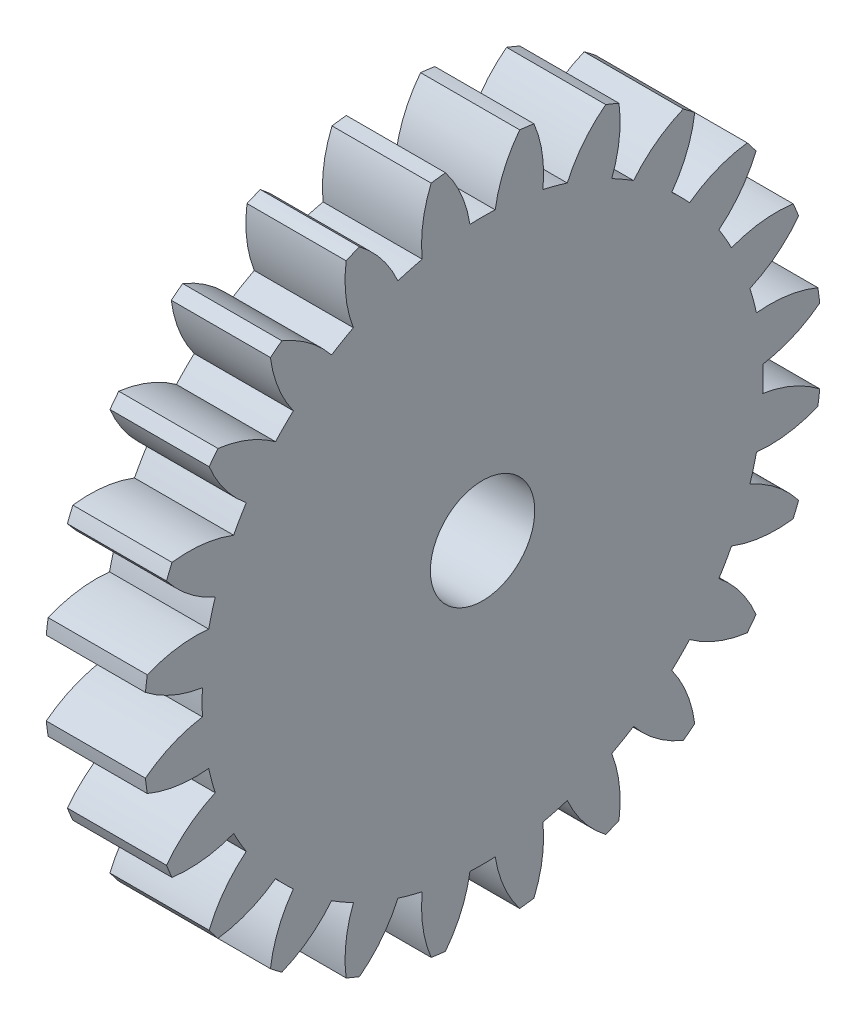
ISO-10303-21;
HEADER;
FILE_DESCRIPTION(('STEP AP214'),'2;1');
FILE_NAME('part.step','',(''),(''),'','','');
FILE_SCHEMA(('AUTOMOTIVE_DESIGN { 1 0 10303 214 1 1 1 1 }'));
ENDSEC;
DATA;
#1=APPLICATION_CONTEXT('core data for automotive mechanical design processes');
#2=APPLICATION_PROTOCOL_DEFINITION('international standard','automotive_design',2000,#1);
#3=PRODUCT_CONTEXT('',#1,'mechanical');
#4=PRODUCT('Part','Part','',(#3));
#5=PRODUCT_RELATED_PRODUCT_CATEGORY('part','',(#4));
#6=PRODUCT_DEFINITION_FORMATION('','',#4);
#7=PRODUCT_DEFINITION_CONTEXT('part definition',#1,'design');
#8=PRODUCT_DEFINITION('design','',#6,#7);
#9=PRODUCT_DEFINITION_SHAPE('','',#8);
#10=(LENGTH_UNIT() NAMED_UNIT(*) SI_UNIT(.MILLI.,.METRE.));
#11=(NAMED_UNIT(*) PLANE_ANGLE_UNIT() SI_UNIT($,.RADIAN.));
#12=(NAMED_UNIT(*) SI_UNIT($,.STERADIAN.) SOLID_ANGLE_UNIT());
#13=UNCERTAINTY_MEASURE_WITH_UNIT(LENGTH_MEASURE(1.E-05),#10,'distance_accuracy_value','');
#14=(GEOMETRIC_REPRESENTATION_CONTEXT(3) GLOBAL_UNCERTAINTY_ASSIGNED_CONTEXT((#13)) GLOBAL_UNIT_ASSIGNED_CONTEXT((#10,
#11,#12)) REPRESENTATION_CONTEXT('',''));
#15=CARTESIAN_POINT('',(0.,0.,0.));
#16=DIRECTION('',(0.,0.,1.));
#17=DIRECTION('',(1.,0.,0.));
#18=AXIS2_PLACEMENT_3D('',#15,#16,#17);
#19=CARTESIAN_POINT('',(1.9,0.,0.));
#20=DIRECTION('',(-1.,0.,0.));
#21=DIRECTION('',(0.,0.,1.));
#22=AXIS2_PLACEMENT_3D('',#19,#20,#21);
#23=PLANE('',#22);
#24=CARTESIAN_POINT('',(1.9,4.14987423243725,-3.81671898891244));
#25=DIRECTION('',(-1.,0.,0.));
#26=DIRECTION('',(0.,-0.258819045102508,-0.965925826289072));
#27=AXIS2_PLACEMENT_3D('',#24,#25,#26);
#28=CIRCLE('',#27,2.4);
#29=CARTESIAN_POINT('',(1.9,5.1230923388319,-1.62289891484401));
#30=VERTEX_POINT('',#29);
#31=CARTESIAN_POINT('',(1.9,6.05670001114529,-2.35931875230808));
#32=VERTEX_POINT('',#31);
#33=EDGE_CURVE('E637',#30,#32,#28,.T.);
#34=ORIENTED_EDGE('',*,*,#33,.F.);
#35=CARTESIAN_POINT('',(1.9,0.,0.));
#36=DIRECTION('',(-1.,0.,0.));
#37=DIRECTION('',(0.,-0.258819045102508,-0.965925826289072));
#38=AXIS2_PLACEMENT_3D('',#35,#36,#37);
#39=CIRCLE('',#38,5.374);
#40=CARTESIAN_POINT('',(1.9,5.2481775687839,-1.1560744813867));
#41=VERTEX_POINT('',#40);
#42=EDGE_CURVE('E1168',#41,#30,#39,.T.);
#43=ORIENTED_EDGE('',*,*,#42,.F.);
#44=CARTESIAN_POINT('',(1.9,5.5022560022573,1.23043848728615));
#45=DIRECTION('',(-1.,0.,0.));
#46=DIRECTION('',(0.,-0.258819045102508,-0.965925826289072));
#47=AXIS2_PLACEMENT_3D('',#44,#45,#46);
#48=CIRCLE('',#47,2.4);
#49=CARTESIAN_POINT('',(1.9,6.42491544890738,-0.985120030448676));
#50=VERTEX_POINT('',#49);
#51=EDGE_CURVE('E627',#50,#41,#48,.T.);
#52=ORIENTED_EDGE('',*,*,#51,.F.);
#53=CARTESIAN_POINT('',(1.9,0.,0.));
#54=DIRECTION('',(-1.,0.,0.));
#55=DIRECTION('',(0.,0.,1.));
#56=AXIS2_PLACEMENT_3D('',#53,#54,#55);
#57=CIRCLE('',#56,6.49999999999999);
#58=CARTESIAN_POINT('',(1.9,6.46095958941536,-0.711337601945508));
#59=VERTEX_POINT('',#58);
#60=EDGE_CURVE('E655',#59,#50,#57,.T.);
#61=ORIENTED_EDGE('',*,*,#60,.F.);
#62=CARTESIAN_POINT('',(1.9,4.99631026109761,-2.61260095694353));
#63=DIRECTION('',(-1.,0.,0.));
#64=DIRECTION('',(0.,0.,-1.));
#65=AXIS2_PLACEMENT_3D('',#62,#63,#64);
#66=CIRCLE('',#65,2.4);
#67=CARTESIAN_POINT('',(1.9,5.36856434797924,-0.241646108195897));
#68=VERTEX_POINT('',#67);
#69=EDGE_CURVE('E679',#68,#59,#66,.T.);
#70=ORIENTED_EDGE('',*,*,#69,.F.);
#71=CARTESIAN_POINT('',(1.9,0.,0.));
#72=DIRECTION('',(-1.,0.,0.));
#73=DIRECTION('',(0.,0.,-1.));
#74=AXIS2_PLACEMENT_3D('',#71,#72,#73);
#75=CIRCLE('',#74,5.374);
#76=CARTESIAN_POINT('',(1.9,5.36856434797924,0.241646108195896));
#77=VERTEX_POINT('',#76);
#78=EDGE_CURVE('E675',#77,#68,#75,.T.);
#79=ORIENTED_EDGE('',*,*,#78,.F.);
#80=CARTESIAN_POINT('',(1.9,4.99631026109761,2.61260095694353));
#81=DIRECTION('',(-1.,0.,0.));
#82=DIRECTION('',(0.,0.,-1.));
#83=AXIS2_PLACEMENT_3D('',#80,#81,#82);
#84=CIRCLE('',#83,2.4);
#85=CARTESIAN_POINT('',(1.9,6.46095958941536,0.711337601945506));
#86=VERTEX_POINT('',#85);
#87=EDGE_CURVE('E677',#86,#77,#84,.T.);
#88=ORIENTED_EDGE('',*,*,#87,.F.);
#89=CARTESIAN_POINT('',(1.9,6.42491544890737,0.985120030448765));
#90=VERTEX_POINT('',#89);
#91=EDGE_CURVE('E649',#90,#86,#57,.T.);
#92=ORIENTED_EDGE('',*,*,#91,.F.);
#93=CARTESIAN_POINT('',(1.9,5.50225600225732,-1.23043848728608));
#94=DIRECTION('',(-1.,0.,0.));
#95=DIRECTION('',(0.,0.258819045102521,-0.965925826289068));
#96=AXIS2_PLACEMENT_3D('',#93,#94,#95);
#97=CIRCLE('',#96,2.4);
#98=CARTESIAN_POINT('',(1.9,5.24817756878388,1.15607448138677));
#99=VERTEX_POINT('',#98);
#100=EDGE_CURVE('E698',#99,#90,#97,.T.);
#101=ORIENTED_EDGE('',*,*,#100,.F.);
#102=CARTESIAN_POINT('',(1.9,0.,0.));
#103=DIRECTION('',(-1.,0.,0.));
#104=DIRECTION('',(0.,0.258819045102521,-0.965925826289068));
#105=AXIS2_PLACEMENT_3D('',#102,#103,#104);
#106=CIRCLE('',#105,5.374);
#107=CARTESIAN_POINT('',(1.9,5.12309233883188,1.62289891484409));
#108=VERTEX_POINT('',#107);
#109=EDGE_CURVE('E694',#108,#99,#106,.T.);
#110=ORIENTED_EDGE('',*,*,#109,.F.);
#111=CARTESIAN_POINT('',(1.9,4.1498742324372,3.8167189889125));
#112=DIRECTION('',(-1.,0.,0.));
#113=DIRECTION('',(0.,0.258819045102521,-0.965925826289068));
#114=AXIS2_PLACEMENT_3D('',#111,#112,#113);
#115=CIRCLE('',#114,2.4);
#116=CARTESIAN_POINT('',(1.9,6.05670001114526,2.35931875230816));
#117=VERTEX_POINT('',#116);
#118=EDGE_CURVE('E696',#117,#108,#115,.T.);
#119=ORIENTED_EDGE('',*,*,#118,.F.);
#120=CARTESIAN_POINT('',(1.9,5.95102393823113,2.61444336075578));
#121=VERTEX_POINT('',#120);
#122=EDGE_CURVE('E653',#121,#117,#57,.T.);
#123=ORIENTED_EDGE('',*,*,#122,.F.);
#124=CARTESIAN_POINT('',(1.9,5.63323208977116,0.235576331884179));
#125=DIRECTION('',(-1.,0.,0.));
#126=DIRECTION('',(0.,0.500000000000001,-0.866025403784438));
#127=AXIS2_PLACEMENT_3D('',#124,#125,#126);
#128=CIRCLE('',#127,2.4);
#129=CARTESIAN_POINT('',(1.9,4.77013616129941,2.47501050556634));
#130=VERTEX_POINT('',#129);
#131=EDGE_CURVE('E719',#130,#121,#128,.T.);
#132=ORIENTED_EDGE('',*,*,#131,.F.);
#133=CARTESIAN_POINT('',(1.9,0.,0.));
#134=DIRECTION('',(-1.,0.,0.));
#135=DIRECTION('',(0.,0.500000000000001,-0.866025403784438));
#136=AXIS2_PLACEMENT_3D('',#133,#134,#135);
#137=CIRCLE('',#136,5.374);
#138=CARTESIAN_POINT('',(1.9,4.52849005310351,2.89355384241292));
#139=VERTEX_POINT('',#138);
#140=EDGE_CURVE('E715',#139,#130,#137,.T.);
#141=ORIENTED_EDGE('',*,*,#140,.F.);
#142=CARTESIAN_POINT('',(1.9,3.02063113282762,4.76073392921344));
#143=DIRECTION('',(-1.,0.,0.));
#144=DIRECTION('',(0.,0.500000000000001,-0.866025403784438));
#145=AXIS2_PLACEMENT_3D('',#142,#143,#144);
#146=CIRCLE('',#145,2.4);
#147=CARTESIAN_POINT('',(1.9,5.23968633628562,3.8465162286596));
#148=VERTEX_POINT('',#147);
#149=EDGE_CURVE('E717',#148,#139,#146,.T.);
#150=ORIENTED_EDGE('',*,*,#149,.F.);
#151=CARTESIAN_POINT('',(1.9,5.07157998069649,4.06559669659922));
#152=VERTEX_POINT('',#151);
#153=EDGE_CURVE('E1394',#152,#148,#57,.T.);
#154=ORIENTED_EDGE('',*,*,#153,.F.);
#155=CARTESIAN_POINT('',(1.9,5.38031271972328,1.68553701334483));
#156=DIRECTION('',(-1.,0.,0.));
#157=DIRECTION('',(0.,0.707106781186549,-0.707106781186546));
#158=AXIS2_PLACEMENT_3D('',#155,#156,#157);
#159=CIRCLE('',#158,2.4);
#160=CARTESIAN_POINT('',(1.9,3.96701785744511,3.62527865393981));
#161=VERTEX_POINT('',#160);
#162=EDGE_CURVE('E741',#161,#152,#159,.T.);
#163=ORIENTED_EDGE('',*,*,#162,.F.);
#164=CARTESIAN_POINT('',(1.9,0.,0.));
#165=DIRECTION('',(-1.,0.,0.));
#166=DIRECTION('',(0.,0.707106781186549,-0.707106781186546));
#167=AXIS2_PLACEMENT_3D('',#164,#165,#166);
#168=CIRCLE('',#167,5.374);
#169=CARTESIAN_POINT('',(1.9,3.62527865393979,3.96701785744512));
#170=VERTEX_POINT('',#169);
#171=EDGE_CURVE('E737',#170,#161,#168,.T.);
#172=ORIENTED_EDGE('',*,*,#171,.F.);
#173=CARTESIAN_POINT('',(1.9,1.68553701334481,5.38031271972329));
#174=DIRECTION('',(-1.,0.,0.));
#175=DIRECTION('',(0.,0.707106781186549,-0.707106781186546));
#176=AXIS2_PLACEMENT_3D('',#173,#174,#175);
#177=CIRCLE('',#176,2.4);
#178=CARTESIAN_POINT('',(1.9,4.0655966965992,5.07157998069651));
#179=VERTEX_POINT('',#178);
#180=EDGE_CURVE('E739',#179,#170,#177,.T.);
#181=ORIENTED_EDGE('',*,*,#180,.F.);
#182=CARTESIAN_POINT('',(1.9,3.84651622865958,5.23968633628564));
#183=VERTEX_POINT('',#182);
#184=EDGE_CURVE('E1389',#183,#179,#57,.T.);
#185=ORIENTED_EDGE('',*,*,#184,.F.);
#186=CARTESIAN_POINT('',(1.9,4.76073392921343,3.02063113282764));
#187=DIRECTION('',(-1.,0.,0.));
#188=DIRECTION('',(0.,0.86602540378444,-0.499999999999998));
#189=AXIS2_PLACEMENT_3D('',#186,#187,#188);
#190=CIRCLE('',#189,2.4);
#191=CARTESIAN_POINT('',(1.9,2.8935538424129,4.52849005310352));
#192=VERTEX_POINT('',#191);
#193=EDGE_CURVE('E763',#192,#183,#190,.T.);
#194=ORIENTED_EDGE('',*,*,#193,.F.);
#195=CARTESIAN_POINT('',(1.9,0.,0.));
#196=DIRECTION('',(-1.,0.,0.));
#197=DIRECTION('',(0.,0.86602540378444,-0.499999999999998));
#198=AXIS2_PLACEMENT_3D('',#195,#196,#197);
#199=CIRCLE('',#198,5.374);
#200=CARTESIAN_POINT('',(1.9,2.47501050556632,4.77013616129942));
#201=VERTEX_POINT('',#200);
#202=EDGE_CURVE('E759',#201,#192,#199,.T.);
#203=ORIENTED_EDGE('',*,*,#202,.F.);
#204=CARTESIAN_POINT('',(1.9,0.235576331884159,5.63323208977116));
#205=DIRECTION('',(-1.,0.,0.));
#206=DIRECTION('',(0.,0.86602540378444,-0.499999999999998));
#207=AXIS2_PLACEMENT_3D('',#204,#205,#206);
#208=CIRCLE('',#207,2.4);
#209=CARTESIAN_POINT('',(1.9,2.61444336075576,5.95102393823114));
#210=VERTEX_POINT('',#209);
#211=EDGE_CURVE('E761',#210,#201,#208,.T.);
#212=ORIENTED_EDGE('',*,*,#211,.F.);
#213=CARTESIAN_POINT('',(1.9,2.35931875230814,6.05670001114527));
#214=VERTEX_POINT('',#213);
#215=EDGE_CURVE('E1384',#214,#210,#57,.T.);
#216=ORIENTED_EDGE('',*,*,#215,.F.);
#217=CARTESIAN_POINT('',(1.9,3.81671898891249,4.14987423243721));
#218=DIRECTION('',(-1.,0.,0.));
#219=DIRECTION('',(0.,0.965925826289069,-0.258819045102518));
#220=AXIS2_PLACEMENT_3D('',#217,#218,#219);
#221=CIRCLE('',#220,2.4);
#222=CARTESIAN_POINT('',(1.9,1.62289891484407,5.12309233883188));
#223=VERTEX_POINT('',#222);
#224=EDGE_CURVE('E785',#223,#214,#221,.T.);
#225=ORIENTED_EDGE('',*,*,#224,.F.);
#226=CARTESIAN_POINT('',(1.9,0.,0.));
#227=DIRECTION('',(-1.,0.,0.));
#228=DIRECTION('',(0.,0.965925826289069,-0.258819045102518));
#229=AXIS2_PLACEMENT_3D('',#226,#227,#228);
#230=CIRCLE('',#229,5.374);
#231=CARTESIAN_POINT('',(1.9,1.15607448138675,5.24817756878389));
#232=VERTEX_POINT('',#231);
#233=EDGE_CURVE('E781',#232,#223,#230,.T.);
#234=ORIENTED_EDGE('',*,*,#233,.F.);
#235=CARTESIAN_POINT('',(1.9,-1.2304384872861,5.50225600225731));
#236=DIRECTION('',(-1.,0.,0.));
#237=DIRECTION('',(0.,0.965925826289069,-0.258819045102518));
#238=AXIS2_PLACEMENT_3D('',#235,#236,#237);
#239=CIRCLE('',#238,2.4);
#240=CARTESIAN_POINT('',(1.9,0.985120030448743,6.42491544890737));
#241=VERTEX_POINT('',#240);
#242=EDGE_CURVE('E783',#241,#232,#239,.T.);
#243=ORIENTED_EDGE('',*,*,#242,.F.);
#244=CARTESIAN_POINT('',(1.9,0.711337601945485,6.46095958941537));
#245=VERTEX_POINT('',#244);
#246=EDGE_CURVE('E1379',#245,#241,#57,.T.);
#247=ORIENTED_EDGE('',*,*,#246,.F.);
#248=CARTESIAN_POINT('',(1.9,2.61260095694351,4.99631026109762));
#249=DIRECTION('',(-1.,0.,0.));
#250=DIRECTION('',(0.,1.,0.));
#251=AXIS2_PLACEMENT_3D('',#248,#249,#250);
#252=CIRCLE('',#251,2.4);
#253=CARTESIAN_POINT('',(1.9,0.241646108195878,5.36856434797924));
#254=VERTEX_POINT('',#253);
#255=EDGE_CURVE('E807',#254,#245,#252,.T.);
#256=ORIENTED_EDGE('',*,*,#255,.F.);
#257=CARTESIAN_POINT('',(1.9,0.,0.));
#258=DIRECTION('',(-1.,0.,0.));
#259=DIRECTION('',(0.,1.,0.));
#260=AXIS2_PLACEMENT_3D('',#257,#258,#259);
#261=CIRCLE('',#260,5.374);
#262=CARTESIAN_POINT('',(1.9,-0.241646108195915,5.36856434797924));
#263=VERTEX_POINT('',#262);
#264=EDGE_CURVE('E803',#263,#254,#261,.T.);
#265=ORIENTED_EDGE('',*,*,#264,.F.);
#266=CARTESIAN_POINT('',(1.9,-2.61260095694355,4.9963102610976));
#267=DIRECTION('',(-1.,0.,0.));
#268=DIRECTION('',(0.,1.,0.));
#269=AXIS2_PLACEMENT_3D('',#266,#267,#268);
#270=CIRCLE('',#269,2.4);
#271=CARTESIAN_POINT('',(1.9,-0.711337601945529,6.46095958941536));
#272=VERTEX_POINT('',#271);
#273=EDGE_CURVE('E805',#272,#263,#270,.T.);
#274=ORIENTED_EDGE('',*,*,#273,.F.);
#275=CARTESIAN_POINT('',(1.9,-0.985120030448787,6.42491544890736));
#276=VERTEX_POINT('',#275);
#277=EDGE_CURVE('E1374',#276,#272,#57,.T.);
#278=ORIENTED_EDGE('',*,*,#277,.F.);
#279=CARTESIAN_POINT('',(1.9,1.23043848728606,5.50225600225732));
#280=DIRECTION('',(-1.,0.,0.));
#281=DIRECTION('',(0.,0.965925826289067,0.258819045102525));
#282=AXIS2_PLACEMENT_3D('',#279,#280,#281);
#283=CIRCLE('',#282,2.4);
#284=CARTESIAN_POINT('',(1.9,-1.15607448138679,5.24817756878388));
#285=VERTEX_POINT('',#284);
#286=EDGE_CURVE('E829',#285,#276,#283,.T.);
#287=ORIENTED_EDGE('',*,*,#286,.F.);
#288=CARTESIAN_POINT('',(1.9,0.,0.));
#289=DIRECTION('',(-1.,0.,0.));
#290=DIRECTION('',(0.,0.965925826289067,0.258819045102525));
#291=AXIS2_PLACEMENT_3D('',#288,#289,#290);
#292=CIRCLE('',#291,5.374);
#293=CARTESIAN_POINT('',(1.9,-1.6228989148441,5.12309233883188));
#294=VERTEX_POINT('',#293);
#295=EDGE_CURVE('E825',#294,#285,#292,.T.);
#296=ORIENTED_EDGE('',*,*,#295,.F.);
#297=CARTESIAN_POINT('',(1.9,-3.81671898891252,4.14987423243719));
#298=DIRECTION('',(-1.,0.,0.));
#299=DIRECTION('',(0.,0.965925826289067,0.258819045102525));
#300=AXIS2_PLACEMENT_3D('',#297,#298,#299);
#301=CIRCLE('',#300,2.4);
#302=CARTESIAN_POINT('',(1.9,-2.35931875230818,6.05670001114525));
#303=VERTEX_POINT('',#302);
#304=EDGE_CURVE('E827',#303,#294,#301,.T.);
#305=ORIENTED_EDGE('',*,*,#304,.F.);
#306=CARTESIAN_POINT('',(1.9,-2.6144433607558,5.95102393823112));
#307=VERTEX_POINT('',#306);
#308=EDGE_CURVE('E1369',#307,#303,#57,.T.);
#309=ORIENTED_EDGE('',*,*,#308,.F.);
#310=CARTESIAN_POINT('',(1.9,-0.235576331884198,5.63323208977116));
#311=DIRECTION('',(-1.,0.,0.));
#312=DIRECTION('',(0.,0.866025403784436,0.500000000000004));
#313=AXIS2_PLACEMENT_3D('',#310,#311,#312);
#314=CIRCLE('',#313,2.4);
#315=CARTESIAN_POINT('',(1.9,-2.47501050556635,4.7701361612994));
#316=VERTEX_POINT('',#315);
#317=EDGE_CURVE('E851',#316,#307,#314,.T.);
#318=ORIENTED_EDGE('',*,*,#317,.F.);
#319=CARTESIAN_POINT('',(1.9,0.,0.));
#320=DIRECTION('',(-1.,0.,0.));
#321=DIRECTION('',(0.,0.866025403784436,0.500000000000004));
#322=AXIS2_PLACEMENT_3D('',#319,#320,#321);
#323=CIRCLE('',#322,5.374);
#324=CARTESIAN_POINT('',(1.9,-2.89355384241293,4.5284900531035));
#325=VERTEX_POINT('',#324);
#326=EDGE_CURVE('E847',#325,#316,#323,.T.);
#327=ORIENTED_EDGE('',*,*,#326,.F.);
#328=CARTESIAN_POINT('',(1.9,-4.76073392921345,3.0206311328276));
#329=DIRECTION('',(-1.,0.,0.));
#330=DIRECTION('',(0.,0.866025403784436,0.500000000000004));
#331=AXIS2_PLACEMENT_3D('',#328,#329,#330);
#332=CIRCLE('',#331,2.4);
#333=CARTESIAN_POINT('',(1.9,-3.84651622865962,5.23968633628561));
#334=VERTEX_POINT('',#333);
#335=EDGE_CURVE('E849',#334,#325,#332,.T.);
#336=ORIENTED_EDGE('',*,*,#335,.F.);
#337=CARTESIAN_POINT('',(1.9,-4.06559669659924,5.07157998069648));
#338=VERTEX_POINT('',#337);
#339=EDGE_CURVE('E1364',#338,#334,#57,.T.);
#340=ORIENTED_EDGE('',*,*,#339,.F.);
#341=CARTESIAN_POINT('',(1.9,-1.68553701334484,5.38031271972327));
#342=DIRECTION('',(-1.,0.,0.));
#343=DIRECTION('',(0.,0.707106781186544,0.707106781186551));
#344=AXIS2_PLACEMENT_3D('',#341,#342,#343);
#345=CIRCLE('',#344,2.4);
#346=CARTESIAN_POINT('',(1.9,-3.62527865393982,3.9670178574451));
#347=VERTEX_POINT('',#346);
#348=EDGE_CURVE('E873',#347,#338,#345,.T.);
#349=ORIENTED_EDGE('',*,*,#348,.F.);
#350=CARTESIAN_POINT('',(1.9,0.,0.));
#351=DIRECTION('',(-1.,0.,0.));
#352=DIRECTION('',(0.,0.707106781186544,0.707106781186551));
#353=AXIS2_PLACEMENT_3D('',#350,#351,#352);
#354=CIRCLE('',#353,5.374);
#355=CARTESIAN_POINT('',(1.9,-3.96701785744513,3.62527865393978));
#356=VERTEX_POINT('',#355);
#357=EDGE_CURVE('E869',#356,#347,#354,.T.);
#358=ORIENTED_EDGE('',*,*,#357,.F.);
#359=CARTESIAN_POINT('',(1.9,-5.38031271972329,1.68553701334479));
#360=DIRECTION('',(-1.,0.,0.));
#361=DIRECTION('',(0.,0.707106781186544,0.707106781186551));
#362=AXIS2_PLACEMENT_3D('',#359,#360,#361);
#363=CIRCLE('',#362,2.4);
#364=CARTESIAN_POINT('',(1.9,-5.07157998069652,4.06559669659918));
#365=VERTEX_POINT('',#364);
#366=EDGE_CURVE('E871',#365,#356,#363,.T.);
#367=ORIENTED_EDGE('',*,*,#366,.F.);
#368=CARTESIAN_POINT('',(1.9,-5.23968633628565,3.84651622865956));
#369=VERTEX_POINT('',#368);
#370=EDGE_CURVE('E1359',#369,#365,#57,.T.);
#371=ORIENTED_EDGE('',*,*,#370,.F.);
#372=CARTESIAN_POINT('',(1.9,-3.02063113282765,4.76073392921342));
#373=DIRECTION('',(-1.,0.,0.));
#374=DIRECTION('',(0.,0.499999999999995,0.866025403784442));
#375=AXIS2_PLACEMENT_3D('',#372,#373,#374);
#376=CIRCLE('',#375,2.4);
#377=CARTESIAN_POINT('',(1.9,-4.52849005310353,2.89355384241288));
#378=VERTEX_POINT('',#377);
#379=EDGE_CURVE('E895',#378,#369,#376,.T.);
#380=ORIENTED_EDGE('',*,*,#379,.F.);
#381=CARTESIAN_POINT('',(1.9,0.,0.));
#382=DIRECTION('',(-1.,0.,0.));
#383=DIRECTION('',(0.,0.499999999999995,0.866025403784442));
#384=AXIS2_PLACEMENT_3D('',#381,#382,#383);
#385=CIRCLE('',#384,5.374);
#386=CARTESIAN_POINT('',(1.9,-4.77013616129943,2.4750105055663));
#387=VERTEX_POINT('',#386);
#388=EDGE_CURVE('E891',#387,#378,#385,.T.);
#389=ORIENTED_EDGE('',*,*,#388,.F.);
#390=CARTESIAN_POINT('',(1.9,-5.63323208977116,0.235576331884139));
#391=DIRECTION('',(-1.,0.,0.));
#392=DIRECTION('',(0.,0.499999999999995,0.866025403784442));
#393=AXIS2_PLACEMENT_3D('',#390,#391,#392);
#394=CIRCLE('',#393,2.4);
#395=CARTESIAN_POINT('',(1.9,-5.95102393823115,2.61444336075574));
#396=VERTEX_POINT('',#395);
#397=EDGE_CURVE('E893',#396,#387,#394,.T.);
#398=ORIENTED_EDGE('',*,*,#397,.F.);
#399=CARTESIAN_POINT('',(1.9,-6.05670001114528,2.35931875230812));
#400=VERTEX_POINT('',#399);
#401=EDGE_CURVE('E1354',#400,#396,#57,.T.);
#402=ORIENTED_EDGE('',*,*,#401,.F.);
#403=CARTESIAN_POINT('',(1.9,-4.14987423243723,3.81671898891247));
#404=DIRECTION('',(-1.,0.,0.));
#405=DIRECTION('',(0.,0.258819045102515,0.96592582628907));
#406=AXIS2_PLACEMENT_3D('',#403,#404,#405);
#407=CIRCLE('',#406,2.4);
#408=CARTESIAN_POINT('',(1.9,-5.12309233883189,1.62289891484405));
#409=VERTEX_POINT('',#408);
#410=EDGE_CURVE('E917',#409,#400,#407,.T.);
#411=ORIENTED_EDGE('',*,*,#410,.F.);
#412=CARTESIAN_POINT('',(1.9,0.,0.));
#413=DIRECTION('',(-1.,0.,0.));
#414=DIRECTION('',(0.,0.258819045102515,0.96592582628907));
#415=AXIS2_PLACEMENT_3D('',#412,#413,#414);
#416=CIRCLE('',#415,5.374);
#417=CARTESIAN_POINT('',(1.9,-5.24817756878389,1.15607448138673));
#418=VERTEX_POINT('',#417);
#419=EDGE_CURVE('E913',#418,#409,#416,.T.);
#420=ORIENTED_EDGE('',*,*,#419,.F.);
#421=CARTESIAN_POINT('',(1.9,-5.50225600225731,-1.23043848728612));
#422=DIRECTION('',(-1.,0.,0.));
#423=DIRECTION('',(0.,0.258819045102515,0.96592582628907));
#424=AXIS2_PLACEMENT_3D('',#421,#422,#423);
#425=CIRCLE('',#424,2.4);
#426=CARTESIAN_POINT('',(1.9,-6.42491544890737,0.985120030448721));
#427=VERTEX_POINT('',#426);
#428=EDGE_CURVE('E915',#427,#418,#425,.T.);
#429=ORIENTED_EDGE('',*,*,#428,.F.);
#430=CARTESIAN_POINT('',(1.9,-6.46095958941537,0.711337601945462));
#431=VERTEX_POINT('',#430);
#432=EDGE_CURVE('E1349',#431,#427,#57,.T.);
#433=ORIENTED_EDGE('',*,*,#432,.F.);
#434=CARTESIAN_POINT('',(1.9,-4.99631026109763,2.6126009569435));
#435=DIRECTION('',(-1.,0.,0.));
#436=DIRECTION('',(0.,0.,1.));
#437=AXIS2_PLACEMENT_3D('',#434,#435,#436);
#438=CIRCLE('',#437,2.4);
#439=CARTESIAN_POINT('',(1.9,-5.36856434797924,0.241646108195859));
#440=VERTEX_POINT('',#439);
#441=EDGE_CURVE('E939',#440,#431,#438,.T.);
#442=ORIENTED_EDGE('',*,*,#441,.F.);
#443=CARTESIAN_POINT('',(1.9,0.,0.));
#444=DIRECTION('',(-1.,0.,0.));
#445=DIRECTION('',(0.,0.,1.));
#446=AXIS2_PLACEMENT_3D('',#443,#444,#445);
#447=CIRCLE('',#446,5.374);
#448=CARTESIAN_POINT('',(1.9,-5.36856434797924,-0.241646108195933));
#449=VERTEX_POINT('',#448);
#450=EDGE_CURVE('E935',#449,#440,#447,.T.);
#451=ORIENTED_EDGE('',*,*,#450,.F.);
#452=CARTESIAN_POINT('',(1.9,-4.99631026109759,-2.61260095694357));
#453=DIRECTION('',(-1.,0.,0.));
#454=DIRECTION('',(0.,0.,1.));
#455=AXIS2_PLACEMENT_3D('',#452,#453,#454);
#456=CIRCLE('',#455,2.4);
#457=CARTESIAN_POINT('',(1.9,-6.46095958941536,-0.711337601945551));
#458=VERTEX_POINT('',#457);
#459=EDGE_CURVE('E937',#458,#449,#456,.T.);
#460=ORIENTED_EDGE('',*,*,#459,.F.);
#461=CARTESIAN_POINT('',(1.9,-6.42491544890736,-0.98512003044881));
#462=VERTEX_POINT('',#461);
#463=EDGE_CURVE('E1344',#462,#458,#57,.T.);
#464=ORIENTED_EDGE('',*,*,#463,.F.);
#465=CARTESIAN_POINT('',(1.9,-5.50225600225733,1.23043848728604));
#466=DIRECTION('',(-1.,0.,0.));
#467=DIRECTION('',(0.,-0.258819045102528,0.965925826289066));
#468=AXIS2_PLACEMENT_3D('',#465,#466,#467);
#469=CIRCLE('',#468,2.4);
#470=CARTESIAN_POINT('',(1.9,-5.24817756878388,-1.1560744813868));
#471=VERTEX_POINT('',#470);
#472=EDGE_CURVE('E961',#471,#462,#469,.T.);
#473=ORIENTED_EDGE('',*,*,#472,.F.);
#474=CARTESIAN_POINT('',(1.9,0.,0.));
#475=DIRECTION('',(-1.,0.,0.));
#476=DIRECTION('',(0.,-0.258819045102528,0.965925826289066));
#477=AXIS2_PLACEMENT_3D('',#474,#475,#476);
#478=CIRCLE('',#477,5.374);
#479=CARTESIAN_POINT('',(1.9,-5.12309233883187,-1.62289891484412));
#480=VERTEX_POINT('',#479);
#481=EDGE_CURVE('E957',#480,#471,#478,.T.);
#482=ORIENTED_EDGE('',*,*,#481,.F.);
#483=CARTESIAN_POINT('',(1.9,-4.14987423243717,-3.81671898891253));
#484=DIRECTION('',(-1.,0.,0.));
#485=DIRECTION('',(0.,-0.258819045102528,0.965925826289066));
#486=AXIS2_PLACEMENT_3D('',#483,#484,#485);
#487=CIRCLE('',#486,2.4);
#488=CARTESIAN_POINT('',(1.9,-6.05670001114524,-2.3593187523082));
#489=VERTEX_POINT('',#488);
#490=EDGE_CURVE('E959',#489,#480,#487,.T.);
#491=ORIENTED_EDGE('',*,*,#490,.F.);
#492=CARTESIAN_POINT('',(1.9,-5.95102393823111,-2.61444336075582));
#493=VERTEX_POINT('',#492);
#494=EDGE_CURVE('E1339',#493,#489,#57,.T.);
#495=ORIENTED_EDGE('',*,*,#494,.F.);
#496=CARTESIAN_POINT('',(1.9,-5.63323208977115,-0.235576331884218));
#497=DIRECTION('',(-1.,0.,0.));
#498=DIRECTION('',(0.,-0.500000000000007,0.866025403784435));
#499=AXIS2_PLACEMENT_3D('',#496,#497,#498);
#500=CIRCLE('',#499,2.4);
#501=CARTESIAN_POINT('',(1.9,-4.77013616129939,-2.47501050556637));
#502=VERTEX_POINT('',#501);
#503=EDGE_CURVE('E983',#502,#493,#500,.T.);
#504=ORIENTED_EDGE('',*,*,#503,.F.);
#505=CARTESIAN_POINT('',(1.9,0.,0.));
#506=DIRECTION('',(-1.,0.,0.));
#507=DIRECTION('',(0.,-0.500000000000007,0.866025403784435));
#508=AXIS2_PLACEMENT_3D('',#505,#506,#507);
#509=CIRCLE('',#508,5.374);
#510=CARTESIAN_POINT('',(1.9,-4.52849005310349,-2.89355384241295));
#511=VERTEX_POINT('',#510);
#512=EDGE_CURVE('E979',#511,#502,#509,.T.);
#513=ORIENTED_EDGE('',*,*,#512,.F.);
#514=CARTESIAN_POINT('',(1.9,-3.02063113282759,-4.76073392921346));
#515=DIRECTION('',(-1.,0.,0.));
#516=DIRECTION('',(0.,-0.500000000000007,0.866025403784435));
#517=AXIS2_PLACEMENT_3D('',#514,#515,#516);
#518=CIRCLE('',#517,2.4);
#519=CARTESIAN_POINT('',(1.9,-5.2396863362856,-3.84651622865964));
#520=VERTEX_POINT('',#519);
#521=EDGE_CURVE('E981',#520,#511,#518,.T.);
#522=ORIENTED_EDGE('',*,*,#521,.F.);
#523=CARTESIAN_POINT('',(1.9,-5.07157998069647,-4.06559669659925));
#524=VERTEX_POINT('',#523);
#525=EDGE_CURVE('E1334',#524,#520,#57,.T.);
#526=ORIENTED_EDGE('',*,*,#525,.F.);
#527=CARTESIAN_POINT('',(1.9,-5.38031271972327,-1.68553701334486));
#528=DIRECTION('',(-1.,0.,0.));
#529=DIRECTION('',(0.,-0.707106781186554,0.707106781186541));
#530=AXIS2_PLACEMENT_3D('',#527,#528,#529);
#531=CIRCLE('',#530,2.4);
#532=CARTESIAN_POINT('',(1.9,-3.96701785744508,-3.62527865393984));
#533=VERTEX_POINT('',#532);
#534=EDGE_CURVE('E1005',#533,#524,#531,.T.);
#535=ORIENTED_EDGE('',*,*,#534,.F.);
#536=CARTESIAN_POINT('',(1.9,0.,0.));
#537=DIRECTION('',(-1.,0.,0.));
#538=DIRECTION('',(0.,-0.707106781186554,0.707106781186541));
#539=AXIS2_PLACEMENT_3D('',#536,#537,#538);
#540=CIRCLE('',#539,5.374);
#541=CARTESIAN_POINT('',(1.9,-3.62527865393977,-3.96701785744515));
#542=VERTEX_POINT('',#541);
#543=EDGE_CURVE('E1001',#542,#533,#540,.T.);
#544=ORIENTED_EDGE('',*,*,#543,.F.);
#545=CARTESIAN_POINT('',(1.9,-1.68553701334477,-5.3803127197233));
#546=DIRECTION('',(-1.,0.,0.));
#547=DIRECTION('',(0.,-0.707106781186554,0.707106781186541));
#548=AXIS2_PLACEMENT_3D('',#545,#546,#547);
#549=CIRCLE('',#548,2.4);
#550=CARTESIAN_POINT('',(1.9,-4.06559669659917,-5.07157998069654));
#551=VERTEX_POINT('',#550);
#552=EDGE_CURVE('E1003',#551,#542,#549,.T.);
#553=ORIENTED_EDGE('',*,*,#552,.F.);
#554=CARTESIAN_POINT('',(1.9,-3.84651622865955,-5.23968633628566));
#555=VERTEX_POINT('',#554);
#556=EDGE_CURVE('E1329',#555,#551,#57,.T.);
#557=ORIENTED_EDGE('',*,*,#556,.F.);
#558=CARTESIAN_POINT('',(1.9,-4.76073392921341,-3.02063113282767));
#559=DIRECTION('',(-1.,0.,0.));
#560=DIRECTION('',(0.,-0.866025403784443,0.499999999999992));
#561=AXIS2_PLACEMENT_3D('',#558,#559,#560);
#562=CIRCLE('',#561,2.4);
#563=CARTESIAN_POINT('',(1.9,-2.89355384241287,-4.52849005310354));
#564=VERTEX_POINT('',#563);
#565=EDGE_CURVE('E1027',#564,#555,#562,.T.);
#566=ORIENTED_EDGE('',*,*,#565,.F.);
#567=CARTESIAN_POINT('',(1.9,0.,0.));
#568=DIRECTION('',(-1.,0.,0.));
#569=DIRECTION('',(0.,-0.866025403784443,0.499999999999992));
#570=AXIS2_PLACEMENT_3D('',#567,#568,#569);
#571=CIRCLE('',#570,5.374);
#572=CARTESIAN_POINT('',(1.9,-2.47501050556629,-4.77013616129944));
#573=VERTEX_POINT('',#572);
#574=EDGE_CURVE('E1023',#573,#564,#571,.T.);
#575=ORIENTED_EDGE('',*,*,#574,.F.);
#576=CARTESIAN_POINT('',(1.9,-0.23557633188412,-5.63323208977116));
#577=DIRECTION('',(-1.,0.,0.));
#578=DIRECTION('',(0.,-0.866025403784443,0.499999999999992));
#579=AXIS2_PLACEMENT_3D('',#576,#577,#578);
#580=CIRCLE('',#579,2.4);
#581=CARTESIAN_POINT('',(1.9,-2.61444336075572,-5.95102393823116));
#582=VERTEX_POINT('',#581);
#583=EDGE_CURVE('E1025',#582,#573,#580,.T.);
#584=ORIENTED_EDGE('',*,*,#583,.F.);
#585=CARTESIAN_POINT('',(1.9,-2.3593187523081,-6.05670001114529));
#586=VERTEX_POINT('',#585);
#587=EDGE_CURVE('E1324',#586,#582,#57,.T.);
#588=ORIENTED_EDGE('',*,*,#587,.F.);
#589=CARTESIAN_POINT('',(1.9,-3.81671898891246,-4.14987423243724));
#590=DIRECTION('',(-1.,0.,0.));
#591=DIRECTION('',(0.,-0.965925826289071,0.258819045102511));
#592=AXIS2_PLACEMENT_3D('',#589,#590,#591);
#593=CIRCLE('',#592,2.4);
#594=CARTESIAN_POINT('',(1.9,-1.62289891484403,-5.1230923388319));
#595=VERTEX_POINT('',#594);
#596=EDGE_CURVE('E1049',#595,#586,#593,.T.);
#597=ORIENTED_EDGE('',*,*,#596,.F.);
#598=CARTESIAN_POINT('',(1.9,0.,0.));
#599=DIRECTION('',(-1.,0.,0.));
#600=DIRECTION('',(0.,-0.965925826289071,0.258819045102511));
#601=AXIS2_PLACEMENT_3D('',#598,#599,#600);
#602=CIRCLE('',#601,5.374);
#603=CARTESIAN_POINT('',(1.9,-1.15607448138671,-5.2481775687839));
#604=VERTEX_POINT('',#603);
#605=EDGE_CURVE('E1045',#604,#595,#602,.T.);
#606=ORIENTED_EDGE('',*,*,#605,.F.);
#607=CARTESIAN_POINT('',(1.9,1.23043848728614,-5.5022560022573));
#608=DIRECTION('',(-1.,0.,0.));
#609=DIRECTION('',(0.,-0.965925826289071,0.258819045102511));
#610=AXIS2_PLACEMENT_3D('',#607,#608,#609);
#611=CIRCLE('',#610,2.4);
#612=CARTESIAN_POINT('',(1.9,-0.985120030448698,-6.42491544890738));
#613=VERTEX_POINT('',#612);
#614=EDGE_CURVE('E1047',#613,#604,#611,.T.);
#615=ORIENTED_EDGE('',*,*,#614,.F.);
#616=CARTESIAN_POINT('',(1.9,-0.71133760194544,-6.46095958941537));
#617=VERTEX_POINT('',#616);
#618=EDGE_CURVE('E1319',#617,#613,#57,.T.);
#619=ORIENTED_EDGE('',*,*,#618,.F.);
#620=CARTESIAN_POINT('',(1.9,-2.61260095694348,-4.99631026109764));
#621=DIRECTION('',(-1.,0.,0.));
#622=DIRECTION('',(0.,-1.,0.));
#623=AXIS2_PLACEMENT_3D('',#620,#621,#622);
#624=CIRCLE('',#623,2.4);
#625=CARTESIAN_POINT('',(1.9,-0.24164610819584,-5.36856434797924));
#626=VERTEX_POINT('',#625);
#627=EDGE_CURVE('E1071',#626,#617,#624,.T.);
#628=ORIENTED_EDGE('',*,*,#627,.F.);
#629=CARTESIAN_POINT('',(1.9,0.,0.));
#630=DIRECTION('',(-1.,0.,0.));
#631=DIRECTION('',(0.,-1.,0.));
#632=AXIS2_PLACEMENT_3D('',#629,#630,#631);
#633=CIRCLE('',#632,5.374);
#634=CARTESIAN_POINT('',(1.9,0.241646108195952,-5.36856434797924));
#635=VERTEX_POINT('',#634);
#636=EDGE_CURVE('E1067',#635,#626,#633,.T.);
#637=ORIENTED_EDGE('',*,*,#636,.F.);
#638=CARTESIAN_POINT('',(1.9,2.61260095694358,-4.99631026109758));
#639=DIRECTION('',(-1.,0.,0.));
#640=DIRECTION('',(0.,-1.,0.));
#641=AXIS2_PLACEMENT_3D('',#638,#639,#640);
#642=CIRCLE('',#641,2.4);
#643=CARTESIAN_POINT('',(1.9,0.711337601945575,-6.46095958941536));
#644=VERTEX_POINT('',#643);
#645=EDGE_CURVE('E1069',#644,#635,#642,.T.);
#646=ORIENTED_EDGE('',*,*,#645,.F.);
#647=CARTESIAN_POINT('',(1.9,0.985120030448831,-6.42491544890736));
#648=VERTEX_POINT('',#647);
#649=EDGE_CURVE('E1314',#648,#644,#57,.T.);
#650=ORIENTED_EDGE('',*,*,#649,.F.);
#651=CARTESIAN_POINT('',(1.9,-1.23043848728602,-5.50225600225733));
#652=DIRECTION('',(-1.,0.,0.));
#653=DIRECTION('',(0.,-0.965925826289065,-0.258819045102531));
#654=AXIS2_PLACEMENT_3D('',#651,#652,#653);
#655=CIRCLE('',#654,2.4);
#656=CARTESIAN_POINT('',(1.9,1.15607448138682,-5.24817756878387));
#657=VERTEX_POINT('',#656);
#658=EDGE_CURVE('E1093',#657,#648,#655,.T.);
#659=ORIENTED_EDGE('',*,*,#658,.F.);
#660=CARTESIAN_POINT('',(1.9,0.,0.));
#661=DIRECTION('',(-1.,0.,0.));
#662=DIRECTION('',(0.,-0.965925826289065,-0.258819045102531));
#663=AXIS2_PLACEMENT_3D('',#660,#661,#662);
#664=CIRCLE('',#663,5.374);
#665=CARTESIAN_POINT('',(1.9,1.62289891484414,-5.12309233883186));
#666=VERTEX_POINT('',#665);
#667=EDGE_CURVE('E1089',#666,#657,#664,.T.);
#668=ORIENTED_EDGE('',*,*,#667,.F.);
#669=CARTESIAN_POINT('',(1.9,3.81671898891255,-4.14987423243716));
#670=DIRECTION('',(-1.,0.,0.));
#671=DIRECTION('',(0.,-0.965925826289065,-0.258819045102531));
#672=AXIS2_PLACEMENT_3D('',#669,#670,#671);
#673=CIRCLE('',#672,2.4);
#674=CARTESIAN_POINT('',(1.9,2.35931875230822,-6.05670001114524));
#675=VERTEX_POINT('',#674);
#676=EDGE_CURVE('E1091',#675,#666,#673,.T.);
#677=ORIENTED_EDGE('',*,*,#676,.F.);
#678=CARTESIAN_POINT('',(1.9,2.61444336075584,-5.95102393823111));
#679=VERTEX_POINT('',#678);
#680=EDGE_CURVE('E1309',#679,#675,#57,.T.);
#681=ORIENTED_EDGE('',*,*,#680,.F.);
#682=CARTESIAN_POINT('',(1.9,0.235576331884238,-5.63323208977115));
#683=DIRECTION('',(-1.,0.,0.));
#684=DIRECTION('',(0.,-0.866025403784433,-0.50000000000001));
#685=AXIS2_PLACEMENT_3D('',#682,#683,#684);
#686=CIRCLE('',#685,2.4);
#687=CARTESIAN_POINT('',(1.9,2.47501050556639,-4.77013616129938));
#688=VERTEX_POINT('',#687);
#689=EDGE_CURVE('E1115',#688,#679,#686,.T.);
#690=ORIENTED_EDGE('',*,*,#689,.F.);
#691=CARTESIAN_POINT('',(1.9,0.,0.));
#692=DIRECTION('',(-1.,0.,0.));
#693=DIRECTION('',(0.,-0.866025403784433,-0.50000000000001));
#694=AXIS2_PLACEMENT_3D('',#691,#692,#693);
#695=CIRCLE('',#694,5.374);
#696=CARTESIAN_POINT('',(1.9,2.89355384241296,-4.52849005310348));
#697=VERTEX_POINT('',#696);
#698=EDGE_CURVE('E1111',#697,#688,#695,.T.);
#699=ORIENTED_EDGE('',*,*,#698,.F.);
#700=CARTESIAN_POINT('',(1.9,4.76073392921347,-3.02063113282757));
#701=DIRECTION('',(-1.,0.,0.));
#702=DIRECTION('',(0.,-0.866025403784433,-0.50000000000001));
#703=AXIS2_PLACEMENT_3D('',#700,#701,#702);
#704=CIRCLE('',#703,2.4);
#705=CARTESIAN_POINT('',(1.9,3.84651622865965,-5.23968633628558));
#706=VERTEX_POINT('',#705);
#707=EDGE_CURVE('E1113',#706,#697,#704,.T.);
#708=ORIENTED_EDGE('',*,*,#707,.F.);
#709=CARTESIAN_POINT('',(1.9,4.06559669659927,-5.07157998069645));
#710=VERTEX_POINT('',#709);
#711=EDGE_CURVE('E1304',#710,#706,#57,.T.);
#712=ORIENTED_EDGE('',*,*,#711,.F.);
#713=CARTESIAN_POINT('',(1.9,1.68553701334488,-5.38031271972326));
#714=DIRECTION('',(-1.,0.,0.));
#715=DIRECTION('',(0.,-0.707106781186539,-0.707106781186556));
#716=AXIS2_PLACEMENT_3D('',#713,#714,#715);
#717=CIRCLE('',#716,2.4);
#718=CARTESIAN_POINT('',(1.9,3.62527865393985,-3.96701785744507));
#719=VERTEX_POINT('',#718);
#720=EDGE_CURVE('E1137',#719,#710,#717,.T.);
#721=ORIENTED_EDGE('',*,*,#720,.F.);
#722=CARTESIAN_POINT('',(1.9,0.,0.));
#723=DIRECTION('',(-1.,0.,0.));
#724=DIRECTION('',(0.,-0.707106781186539,-0.707106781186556));
#725=AXIS2_PLACEMENT_3D('',#722,#723,#724);
#726=CIRCLE('',#725,5.374);
#727=CARTESIAN_POINT('',(1.9,3.96701785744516,-3.62527865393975));
#728=VERTEX_POINT('',#727);
#729=EDGE_CURVE('E1133',#728,#719,#726,.T.);
#730=ORIENTED_EDGE('',*,*,#729,.F.);
#731=CARTESIAN_POINT('',(1.9,5.3803127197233,-1.68553701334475));
#732=DIRECTION('',(-1.,0.,0.));
#733=DIRECTION('',(0.,-0.707106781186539,-0.707106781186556));
#734=AXIS2_PLACEMENT_3D('',#731,#732,#733);
#735=CIRCLE('',#734,2.4);
#736=CARTESIAN_POINT('',(1.9,5.07157998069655,-4.06559669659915));
#737=VERTEX_POINT('',#736);
#738=EDGE_CURVE('E1135',#737,#728,#735,.T.);
#739=ORIENTED_EDGE('',*,*,#738,.F.);
#740=CARTESIAN_POINT('',(1.9,5.23968633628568,-3.84651622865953));
#741=VERTEX_POINT('',#740);
#742=EDGE_CURVE('E1303',#741,#737,#57,.T.);
#743=ORIENTED_EDGE('',*,*,#742,.F.);
#744=CARTESIAN_POINT('',(1.9,3.02063113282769,-4.7607339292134));
#745=DIRECTION('',(-1.,0.,0.));
#746=DIRECTION('',(0.,-0.499999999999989,-0.866025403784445));
#747=AXIS2_PLACEMENT_3D('',#744,#745,#746);
#748=CIRCLE('',#747,2.4);
#749=CARTESIAN_POINT('',(1.9,4.52849005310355,-2.89355384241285));
#750=VERTEX_POINT('',#749);
#751=EDGE_CURVE('E1158',#750,#741,#748,.T.);
#752=ORIENTED_EDGE('',*,*,#751,.F.);
#753=CARTESIAN_POINT('',(1.9,0.,0.));
#754=DIRECTION('',(-1.,0.,0.));
#755=DIRECTION('',(0.,-0.499999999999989,-0.866025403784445));
#756=AXIS2_PLACEMENT_3D('',#753,#754,#755);
#757=CIRCLE('',#756,5.374);
#758=CARTESIAN_POINT('',(1.9,4.77013616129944,-2.47501050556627));
#759=VERTEX_POINT('',#758);
#760=EDGE_CURVE('E1154',#759,#750,#757,.T.);
#761=ORIENTED_EDGE('',*,*,#760,.F.);
#762=CARTESIAN_POINT('',(1.9,5.63323208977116,-0.2355763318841));
#763=DIRECTION('',(-1.,0.,0.));
#764=DIRECTION('',(0.,-0.499999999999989,-0.866025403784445));
#765=AXIS2_PLACEMENT_3D('',#762,#763,#764);
#766=CIRCLE('',#765,2.4);
#767=CARTESIAN_POINT('',(1.9,5.95102393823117,-2.61444336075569));
#768=VERTEX_POINT('',#767);
#769=EDGE_CURVE('E1156',#768,#759,#766,.T.);
#770=ORIENTED_EDGE('',*,*,#769,.F.);
#771=EDGE_CURVE('E1231',#32,#768,#57,.T.);
#772=ORIENTED_EDGE('',*,*,#771,.F.);
#773=EDGE_LOOP('',(#34,#43,#52,#61,#70,#79,#88,#92,#101,#110,#119,#123,#132,#141,#150,#154,#163,
#172,#181,#185,#194,#203,#212,#216,#225,#234,#243,#247,#256,#265,#274,#278,#287,#296,#305,#309,
#318,#327,#336,#340,#349,#358,#367,#371,#380,#389,#398,#402,#411,#420,#429,#433,#442,#451,#460,
#464,#473,#482,#491,#495,#504,#513,#522,#526,#535,#544,#553,#557,#566,#575,#584,#588,#597,#606,
#615,#619,#628,#637,#646,#650,#659,#668,#677,#681,#690,#699,#708,#712,#721,#730,#739,#743,#752,
#761,#770,#772));
#774=FACE_BOUND('',#773,.T.);
#775=CARTESIAN_POINT('',(1.9,0.,0.));
#776=DIRECTION('',(-1.,0.,0.));
#777=DIRECTION('',(0.,0.,1.));
#778=AXIS2_PLACEMENT_3D('',#775,#776,#777);
#779=CIRCLE('',#778,0.999999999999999);
#780=CARTESIAN_POINT('',(1.9,0.,0.999999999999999));
#781=VERTEX_POINT('',#780);
#782=EDGE_CURVE('E1173',#781,#781,#779,.F.);
#783=ORIENTED_EDGE('',*,*,#782,.F.);
#784=EDGE_LOOP('',(#783));
#785=FACE_BOUND('',#784,.T.);
#786=ADVANCED_FACE('F28',(#774,#785),#23,.F.);
#787=CARTESIAN_POINT('',(0.,0.,0.));
#788=DIRECTION('',(1.,0.,0.));
#789=DIRECTION('',(0.,0.,-1.));
#790=AXIS2_PLACEMENT_3D('',#787,#788,#789);
#791=PLANE('',#790);
#792=CARTESIAN_POINT('',(0.,4.14987423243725,-3.81671898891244));
#793=DIRECTION('',(-1.,0.,0.));
#794=DIRECTION('',(0.,-0.258819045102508,-0.965925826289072));
#795=AXIS2_PLACEMENT_3D('',#792,#793,#794);
#796=CIRCLE('',#795,2.4);
#797=CARTESIAN_POINT('',(0.,5.1230923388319,-1.62289891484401));
#798=VERTEX_POINT('',#797);
#799=CARTESIAN_POINT('',(0.,6.0567000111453,-2.35931875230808));
#800=VERTEX_POINT('',#799);
#801=EDGE_CURVE('E43',#798,#800,#796,.T.);
#802=ORIENTED_EDGE('',*,*,#801,.T.);
#803=CARTESIAN_POINT('',(0.,0.,0.));
#804=DIRECTION('',(-1.,0.,0.));
#805=DIRECTION('',(0.,0.,1.));
#806=AXIS2_PLACEMENT_3D('',#803,#804,#805);
#807=CIRCLE('',#806,6.5);
#808=CARTESIAN_POINT('',(0.,5.95102393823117,-2.61444336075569));
#809=VERTEX_POINT('',#808);
#810=EDGE_CURVE('E650',#800,#809,#807,.T.);
#811=ORIENTED_EDGE('',*,*,#810,.T.);
#812=CARTESIAN_POINT('',(0.,5.63323208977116,-0.2355763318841));
#813=DIRECTION('',(1.,0.,0.));
#814=DIRECTION('',(0.,0.,-1.));
#815=AXIS2_PLACEMENT_3D('',#812,#813,#814);
#816=CIRCLE('',#815,2.4);
#817=CARTESIAN_POINT('',(0.,4.77013616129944,-2.47501050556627));
#818=VERTEX_POINT('',#817);
#819=EDGE_CURVE('E36',#818,#809,#816,.T.);
#820=ORIENTED_EDGE('',*,*,#819,.F.);
#821=CARTESIAN_POINT('',(0.,0.,0.));
#822=DIRECTION('',(-1.,0.,0.));
#823=DIRECTION('',(0.,-0.499999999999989,-0.866025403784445));
#824=AXIS2_PLACEMENT_3D('',#821,#822,#823);
#825=CIRCLE('',#824,5.374);
#826=CARTESIAN_POINT('',(0.,4.52849005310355,-2.89355384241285));
#827=VERTEX_POINT('',#826);
#828=EDGE_CURVE('E1160',#818,#827,#825,.T.);
#829=ORIENTED_EDGE('',*,*,#828,.T.);
#830=CARTESIAN_POINT('',(0.,3.02063113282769,-4.7607339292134));
#831=DIRECTION('',(-1.,0.,0.));
#832=DIRECTION('',(0.,-0.499999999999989,-0.866025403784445));
#833=AXIS2_PLACEMENT_3D('',#830,#831,#832);
#834=CIRCLE('',#833,2.4);
#835=CARTESIAN_POINT('',(0.,5.23968633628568,-3.84651622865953));
#836=VERTEX_POINT('',#835);
#837=EDGE_CURVE('E51',#827,#836,#834,.T.);
#838=ORIENTED_EDGE('',*,*,#837,.T.);
#839=CARTESIAN_POINT('',(0.,5.07157998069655,-4.06559669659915));
#840=VERTEX_POINT('',#839);
#841=EDGE_CURVE('E656',#836,#840,#807,.T.);
#842=ORIENTED_EDGE('',*,*,#841,.T.);
#843=CARTESIAN_POINT('',(0.,5.3803127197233,-1.68553701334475));
#844=DIRECTION('',(1.,0.,0.));
#845=DIRECTION('',(0.,0.,-1.));
#846=AXIS2_PLACEMENT_3D('',#843,#844,#845);
#847=CIRCLE('',#846,2.4);
#848=CARTESIAN_POINT('',(0.,3.96701785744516,-3.62527865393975));
#849=VERTEX_POINT('',#848);
#850=EDGE_CURVE('E1289',#849,#840,#847,.T.);
#851=ORIENTED_EDGE('',*,*,#850,.F.);
#852=CARTESIAN_POINT('',(0.,0.,0.));
#853=DIRECTION('',(-1.,0.,0.));
#854=DIRECTION('',(0.,-0.707106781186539,-0.707106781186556));
#855=AXIS2_PLACEMENT_3D('',#852,#853,#854);
#856=CIRCLE('',#855,5.374);
#857=CARTESIAN_POINT('',(0.,3.62527865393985,-3.96701785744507));
#858=VERTEX_POINT('',#857);
#859=EDGE_CURVE('E1139',#849,#858,#856,.T.);
#860=ORIENTED_EDGE('',*,*,#859,.T.);
#861=CARTESIAN_POINT('',(0.,1.68553701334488,-5.38031271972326));
#862=DIRECTION('',(-1.,0.,0.));
#863=DIRECTION('',(0.,-0.707106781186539,-0.707106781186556));
#864=AXIS2_PLACEMENT_3D('',#861,#862,#863);
#865=CIRCLE('',#864,2.4);
#866=CARTESIAN_POINT('',(0.,4.06559669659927,-5.07157998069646));
#867=VERTEX_POINT('',#866);
#868=EDGE_CURVE('E1142',#858,#867,#865,.T.);
#869=ORIENTED_EDGE('',*,*,#868,.T.);
#870=CARTESIAN_POINT('',(0.,3.84651622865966,-5.23968633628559));
#871=VERTEX_POINT('',#870);
#872=EDGE_CURVE('E1481',#867,#871,#807,.T.);
#873=ORIENTED_EDGE('',*,*,#872,.T.);
#874=CARTESIAN_POINT('',(0.,4.76073392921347,-3.02063113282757));
#875=DIRECTION('',(1.,0.,0.));
#876=DIRECTION('',(0.,0.,-1.));
#877=AXIS2_PLACEMENT_3D('',#874,#875,#876);
#878=CIRCLE('',#877,2.4);
#879=CARTESIAN_POINT('',(0.,2.89355384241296,-4.52849005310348));
#880=VERTEX_POINT('',#879);
#881=EDGE_CURVE('E1286',#880,#871,#878,.T.);
#882=ORIENTED_EDGE('',*,*,#881,.F.);
#883=CARTESIAN_POINT('',(0.,0.,0.));
#884=DIRECTION('',(-1.,0.,0.));
#885=DIRECTION('',(0.,-0.866025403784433,-0.50000000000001));
#886=AXIS2_PLACEMENT_3D('',#883,#884,#885);
#887=CIRCLE('',#886,5.374);
#888=CARTESIAN_POINT('',(0.,2.47501050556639,-4.77013616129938));
#889=VERTEX_POINT('',#888);
#890=EDGE_CURVE('E1117',#880,#889,#887,.T.);
#891=ORIENTED_EDGE('',*,*,#890,.T.);
#892=CARTESIAN_POINT('',(0.,0.235576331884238,-5.63323208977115));
#893=DIRECTION('',(-1.,0.,0.));
#894=DIRECTION('',(0.,-0.866025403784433,-0.50000000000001));
#895=AXIS2_PLACEMENT_3D('',#892,#893,#894);
#896=CIRCLE('',#895,2.4);
#897=CARTESIAN_POINT('',(0.,2.61444336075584,-5.95102393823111));
#898=VERTEX_POINT('',#897);
#899=EDGE_CURVE('E1120',#889,#898,#896,.T.);
#900=ORIENTED_EDGE('',*,*,#899,.T.);
#901=CARTESIAN_POINT('',(0.,2.35931875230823,-6.05670001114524));
#902=VERTEX_POINT('',#901);
#903=EDGE_CURVE('E1478',#898,#902,#807,.T.);
#904=ORIENTED_EDGE('',*,*,#903,.T.);
#905=CARTESIAN_POINT('',(0.,3.81671898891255,-4.14987423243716));
#906=DIRECTION('',(1.,0.,0.));
#907=DIRECTION('',(0.,0.,-1.));
#908=AXIS2_PLACEMENT_3D('',#905,#906,#907);
#909=CIRCLE('',#908,2.4);
#910=CARTESIAN_POINT('',(0.,1.62289891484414,-5.12309233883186));
#911=VERTEX_POINT('',#910);
#912=EDGE_CURVE('E1283',#911,#902,#909,.T.);
#913=ORIENTED_EDGE('',*,*,#912,.F.);
#914=CARTESIAN_POINT('',(0.,0.,0.));
#915=DIRECTION('',(-1.,0.,0.));
#916=DIRECTION('',(0.,-0.965925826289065,-0.258819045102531));
#917=AXIS2_PLACEMENT_3D('',#914,#915,#916);
#918=CIRCLE('',#917,5.374);
#919=CARTESIAN_POINT('',(0.,1.15607448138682,-5.24817756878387));
#920=VERTEX_POINT('',#919);
#921=EDGE_CURVE('E1095',#911,#920,#918,.T.);
#922=ORIENTED_EDGE('',*,*,#921,.T.);
#923=CARTESIAN_POINT('',(0.,-1.23043848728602,-5.50225600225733));
#924=DIRECTION('',(-1.,0.,0.));
#925=DIRECTION('',(0.,-0.965925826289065,-0.258819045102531));
#926=AXIS2_PLACEMENT_3D('',#923,#924,#925);
#927=CIRCLE('',#926,2.4);
#928=CARTESIAN_POINT('',(0.,0.98512003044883,-6.42491544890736));
#929=VERTEX_POINT('',#928);
#930=EDGE_CURVE('E1098',#920,#929,#927,.T.);
#931=ORIENTED_EDGE('',*,*,#930,.T.);
#932=CARTESIAN_POINT('',(0.,0.711337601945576,-6.46095958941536));
#933=VERTEX_POINT('',#932);
#934=EDGE_CURVE('E1475',#929,#933,#807,.T.);
#935=ORIENTED_EDGE('',*,*,#934,.T.);
#936=CARTESIAN_POINT('',(0.,2.61260095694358,-4.99631026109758));
#937=DIRECTION('',(1.,0.,0.));
#938=DIRECTION('',(0.,0.,-1.));
#939=AXIS2_PLACEMENT_3D('',#936,#937,#938);
#940=CIRCLE('',#939,2.4);
#941=CARTESIAN_POINT('',(0.,0.241646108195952,-5.36856434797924));
#942=VERTEX_POINT('',#941);
#943=EDGE_CURVE('E1280',#942,#933,#940,.T.);
#944=ORIENTED_EDGE('',*,*,#943,.F.);
#945=CARTESIAN_POINT('',(0.,0.,0.));
#946=DIRECTION('',(-1.,0.,0.));
#947=DIRECTION('',(0.,-1.,0.));
#948=AXIS2_PLACEMENT_3D('',#945,#946,#947);
#949=CIRCLE('',#948,5.374);
#950=CARTESIAN_POINT('',(0.,-0.24164610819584,-5.36856434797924));
#951=VERTEX_POINT('',#950);
#952=EDGE_CURVE('E1073',#942,#951,#949,.T.);
#953=ORIENTED_EDGE('',*,*,#952,.T.);
#954=CARTESIAN_POINT('',(0.,-2.61260095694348,-4.99631026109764));
#955=DIRECTION('',(-1.,0.,0.));
#956=DIRECTION('',(0.,-1.,0.));
#957=AXIS2_PLACEMENT_3D('',#954,#955,#956);
#958=CIRCLE('',#957,2.4);
#959=CARTESIAN_POINT('',(0.,-0.711337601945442,-6.46095958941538));
#960=VERTEX_POINT('',#959);
#961=EDGE_CURVE('E1076',#951,#960,#958,.T.);
#962=ORIENTED_EDGE('',*,*,#961,.T.);
#963=CARTESIAN_POINT('',(0.,-0.985120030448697,-6.42491544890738));
#964=VERTEX_POINT('',#963);
#965=EDGE_CURVE('E1472',#960,#964,#807,.T.);
#966=ORIENTED_EDGE('',*,*,#965,.T.);
#967=CARTESIAN_POINT('',(0.,1.23043848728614,-5.5022560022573));
#968=DIRECTION('',(1.,0.,0.));
#969=DIRECTION('',(0.,0.,-1.));
#970=AXIS2_PLACEMENT_3D('',#967,#968,#969);
#971=CIRCLE('',#970,2.4);
#972=CARTESIAN_POINT('',(0.,-1.15607448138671,-5.2481775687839));
#973=VERTEX_POINT('',#972);
#974=EDGE_CURVE('E1277',#973,#964,#971,.T.);
#975=ORIENTED_EDGE('',*,*,#974,.F.);
#976=CARTESIAN_POINT('',(0.,0.,0.));
#977=DIRECTION('',(-1.,0.,0.));
#978=DIRECTION('',(0.,-0.965925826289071,0.258819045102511));
#979=AXIS2_PLACEMENT_3D('',#976,#977,#978);
#980=CIRCLE('',#979,5.374);
#981=CARTESIAN_POINT('',(0.,-1.62289891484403,-5.1230923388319));
#982=VERTEX_POINT('',#981);
#983=EDGE_CURVE('E1051',#973,#982,#980,.T.);
#984=ORIENTED_EDGE('',*,*,#983,.T.);
#985=CARTESIAN_POINT('',(0.,-3.81671898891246,-4.14987423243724));
#986=DIRECTION('',(-1.,0.,0.));
#987=DIRECTION('',(0.,-0.965925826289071,0.258819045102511));
#988=AXIS2_PLACEMENT_3D('',#985,#986,#987);
#989=CIRCLE('',#988,2.4);
#990=CARTESIAN_POINT('',(0.,-2.3593187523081,-6.05670001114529));
#991=VERTEX_POINT('',#990);
#992=EDGE_CURVE('E1054',#982,#991,#989,.T.);
#993=ORIENTED_EDGE('',*,*,#992,.T.);
#994=CARTESIAN_POINT('',(0.,-2.61444336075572,-5.95102393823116));
#995=VERTEX_POINT('',#994);
#996=EDGE_CURVE('E1469',#991,#995,#807,.T.);
#997=ORIENTED_EDGE('',*,*,#996,.T.);
#998=CARTESIAN_POINT('',(0.,-0.23557633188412,-5.63323208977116));
#999=DIRECTION('',(1.,0.,0.));
#1000=DIRECTION('',(0.,0.,-1.));
#1001=AXIS2_PLACEMENT_3D('',#998,#999,#1000);
#1002=CIRCLE('',#1001,2.4);
#1003=CARTESIAN_POINT('',(0.,-2.47501050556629,-4.77013616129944));
#1004=VERTEX_POINT('',#1003);
#1005=EDGE_CURVE('E1274',#1004,#995,#1002,.T.);
#1006=ORIENTED_EDGE('',*,*,#1005,.F.);
#1007=CARTESIAN_POINT('',(0.,0.,0.));
#1008=DIRECTION('',(-1.,0.,0.));
#1009=DIRECTION('',(0.,-0.866025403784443,0.499999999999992));
#1010=AXIS2_PLACEMENT_3D('',#1007,#1008,#1009);
#1011=CIRCLE('',#1010,5.374);
#1012=CARTESIAN_POINT('',(0.,-2.89355384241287,-4.52849005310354));
#1013=VERTEX_POINT('',#1012);
#1014=EDGE_CURVE('E1029',#1004,#1013,#1011,.T.);
#1015=ORIENTED_EDGE('',*,*,#1014,.T.);
#1016=CARTESIAN_POINT('',(0.,-4.76073392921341,-3.02063113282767));
#1017=DIRECTION('',(-1.,0.,0.));
#1018=DIRECTION('',(0.,-0.866025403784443,0.499999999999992));
#1019=AXIS2_PLACEMENT_3D('',#1016,#1017,#1018);
#1020=CIRCLE('',#1019,2.4);
#1021=CARTESIAN_POINT('',(0.,-3.84651622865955,-5.23968633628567));
#1022=VERTEX_POINT('',#1021);
#1023=EDGE_CURVE('E1032',#1013,#1022,#1020,.T.);
#1024=ORIENTED_EDGE('',*,*,#1023,.T.);
#1025=CARTESIAN_POINT('',(0.,-4.06559669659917,-5.07157998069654));
#1026=VERTEX_POINT('',#1025);
#1027=EDGE_CURVE('E1466',#1022,#1026,#807,.T.);
#1028=ORIENTED_EDGE('',*,*,#1027,.T.);
#1029=CARTESIAN_POINT('',(0.,-1.68553701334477,-5.3803127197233));
#1030=DIRECTION('',(1.,0.,0.));
#1031=DIRECTION('',(0.,0.,-1.));
#1032=AXIS2_PLACEMENT_3D('',#1029,#1030,#1031);
#1033=CIRCLE('',#1032,2.4);
#1034=CARTESIAN_POINT('',(0.,-3.62527865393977,-3.96701785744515));
#1035=VERTEX_POINT('',#1034);
#1036=EDGE_CURVE('E1271',#1035,#1026,#1033,.T.);
#1037=ORIENTED_EDGE('',*,*,#1036,.F.);
#1038=CARTESIAN_POINT('',(0.,0.,0.));
#1039=DIRECTION('',(-1.,0.,0.));
#1040=DIRECTION('',(0.,-0.707106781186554,0.707106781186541));
#1041=AXIS2_PLACEMENT_3D('',#1038,#1039,#1040);
#1042=CIRCLE('',#1041,5.374);
#1043=CARTESIAN_POINT('',(0.,-3.96701785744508,-3.62527865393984));
#1044=VERTEX_POINT('',#1043);
#1045=EDGE_CURVE('E1007',#1035,#1044,#1042,.T.);
#1046=ORIENTED_EDGE('',*,*,#1045,.T.);
#1047=CARTESIAN_POINT('',(0.,-5.38031271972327,-1.68553701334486));
#1048=DIRECTION('',(-1.,0.,0.));
#1049=DIRECTION('',(0.,-0.707106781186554,0.707106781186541));
#1050=AXIS2_PLACEMENT_3D('',#1047,#1048,#1049);
#1051=CIRCLE('',#1050,2.4);
#1052=CARTESIAN_POINT('',(0.,-5.07157998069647,-4.06559669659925));
#1053=VERTEX_POINT('',#1052);
#1054=EDGE_CURVE('E1010',#1044,#1053,#1051,.T.);
#1055=ORIENTED_EDGE('',*,*,#1054,.T.);
#1056=CARTESIAN_POINT('',(0.,-5.2396863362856,-3.84651622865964));
#1057=VERTEX_POINT('',#1056);
#1058=EDGE_CURVE('E1463',#1053,#1057,#807,.T.);
#1059=ORIENTED_EDGE('',*,*,#1058,.T.);
#1060=CARTESIAN_POINT('',(0.,-3.02063113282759,-4.76073392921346));
#1061=DIRECTION('',(1.,0.,0.));
#1062=DIRECTION('',(0.,0.,-1.));
#1063=AXIS2_PLACEMENT_3D('',#1060,#1061,#1062);
#1064=CIRCLE('',#1063,2.4);
#1065=CARTESIAN_POINT('',(0.,-4.52849005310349,-2.89355384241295));
#1066=VERTEX_POINT('',#1065);
#1067=EDGE_CURVE('E1268',#1066,#1057,#1064,.T.);
#1068=ORIENTED_EDGE('',*,*,#1067,.F.);
#1069=CARTESIAN_POINT('',(0.,0.,0.));
#1070=DIRECTION('',(-1.,0.,0.));
#1071=DIRECTION('',(0.,-0.500000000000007,0.866025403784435));
#1072=AXIS2_PLACEMENT_3D('',#1069,#1070,#1071);
#1073=CIRCLE('',#1072,5.374);
#1074=CARTESIAN_POINT('',(0.,-4.77013616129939,-2.47501050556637));
#1075=VERTEX_POINT('',#1074);
#1076=EDGE_CURVE('E985',#1066,#1075,#1073,.T.);
#1077=ORIENTED_EDGE('',*,*,#1076,.T.);
#1078=CARTESIAN_POINT('',(0.,-5.63323208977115,-0.235576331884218));
#1079=DIRECTION('',(-1.,0.,0.));
#1080=DIRECTION('',(0.,-0.500000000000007,0.866025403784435));
#1081=AXIS2_PLACEMENT_3D('',#1078,#1079,#1080);
#1082=CIRCLE('',#1081,2.4);
#1083=CARTESIAN_POINT('',(0.,-5.95102393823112,-2.61444336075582));
#1084=VERTEX_POINT('',#1083);
#1085=EDGE_CURVE('E988',#1075,#1084,#1082,.T.);
#1086=ORIENTED_EDGE('',*,*,#1085,.T.);
#1087=CARTESIAN_POINT('',(0.,-6.05670001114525,-2.35931875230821));
#1088=VERTEX_POINT('',#1087);
#1089=EDGE_CURVE('E1460',#1084,#1088,#807,.T.);
#1090=ORIENTED_EDGE('',*,*,#1089,.T.);
#1091=CARTESIAN_POINT('',(0.,-4.14987423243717,-3.81671898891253));
#1092=DIRECTION('',(1.,0.,0.));
#1093=DIRECTION('',(0.,0.,-1.));
#1094=AXIS2_PLACEMENT_3D('',#1091,#1092,#1093);
#1095=CIRCLE('',#1094,2.4);
#1096=CARTESIAN_POINT('',(0.,-5.12309233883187,-1.62289891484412));
#1097=VERTEX_POINT('',#1096);
#1098=EDGE_CURVE('E1265',#1097,#1088,#1095,.T.);
#1099=ORIENTED_EDGE('',*,*,#1098,.F.);
#1100=CARTESIAN_POINT('',(0.,0.,0.));
#1101=DIRECTION('',(-1.,0.,0.));
#1102=DIRECTION('',(0.,-0.258819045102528,0.965925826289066));
#1103=AXIS2_PLACEMENT_3D('',#1100,#1101,#1102);
#1104=CIRCLE('',#1103,5.374);
#1105=CARTESIAN_POINT('',(0.,-5.24817756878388,-1.1560744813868));
#1106=VERTEX_POINT('',#1105);
#1107=EDGE_CURVE('E963',#1097,#1106,#1104,.T.);
#1108=ORIENTED_EDGE('',*,*,#1107,.T.);
#1109=CARTESIAN_POINT('',(0.,-5.50225600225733,1.23043848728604));
#1110=DIRECTION('',(-1.,0.,0.));
#1111=DIRECTION('',(0.,-0.258819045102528,0.965925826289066));
#1112=AXIS2_PLACEMENT_3D('',#1109,#1110,#1111);
#1113=CIRCLE('',#1112,2.4);
#1114=CARTESIAN_POINT('',(0.,-6.42491544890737,-0.985120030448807));
#1115=VERTEX_POINT('',#1114);
#1116=EDGE_CURVE('E966',#1106,#1115,#1113,.T.);
#1117=ORIENTED_EDGE('',*,*,#1116,.T.);
#1118=CARTESIAN_POINT('',(0.,-6.46095958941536,-0.711337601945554));
#1119=VERTEX_POINT('',#1118);
#1120=EDGE_CURVE('E1457',#1115,#1119,#807,.T.);
#1121=ORIENTED_EDGE('',*,*,#1120,.T.);
#1122=CARTESIAN_POINT('',(0.,-4.99631026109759,-2.61260095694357));
#1123=DIRECTION('',(1.,0.,0.));
#1124=DIRECTION('',(0.,0.,-1.));
#1125=AXIS2_PLACEMENT_3D('',#1122,#1123,#1124);
#1126=CIRCLE('',#1125,2.4);
#1127=CARTESIAN_POINT('',(0.,-5.36856434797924,-0.241646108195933));
#1128=VERTEX_POINT('',#1127);
#1129=EDGE_CURVE('E1262',#1128,#1119,#1126,.T.);
#1130=ORIENTED_EDGE('',*,*,#1129,.F.);
#1131=CARTESIAN_POINT('',(0.,0.,0.));
#1132=DIRECTION('',(-1.,0.,0.));
#1133=DIRECTION('',(0.,0.,1.));
#1134=AXIS2_PLACEMENT_3D('',#1131,#1132,#1133);
#1135=CIRCLE('',#1134,5.374);
#1136=CARTESIAN_POINT('',(0.,-5.36856434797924,0.241646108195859));
#1137=VERTEX_POINT('',#1136);
#1138=EDGE_CURVE('E941',#1128,#1137,#1135,.T.);
#1139=ORIENTED_EDGE('',*,*,#1138,.T.);
#1140=CARTESIAN_POINT('',(0.,-4.99631026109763,2.6126009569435));
#1141=DIRECTION('',(-1.,0.,0.));
#1142=DIRECTION('',(0.,0.,1.));
#1143=AXIS2_PLACEMENT_3D('',#1140,#1141,#1142);
#1144=CIRCLE('',#1143,2.4);
#1145=CARTESIAN_POINT('',(0.,-6.46095958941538,0.711337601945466));
#1146=VERTEX_POINT('',#1145);
#1147=EDGE_CURVE('E944',#1137,#1146,#1144,.T.);
#1148=ORIENTED_EDGE('',*,*,#1147,.T.);
#1149=CARTESIAN_POINT('',(0.,-6.42491544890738,0.985120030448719));
#1150=VERTEX_POINT('',#1149);
#1151=EDGE_CURVE('E1454',#1146,#1150,#807,.T.);
#1152=ORIENTED_EDGE('',*,*,#1151,.T.);
#1153=CARTESIAN_POINT('',(0.,-5.50225600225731,-1.23043848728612));
#1154=DIRECTION('',(1.,0.,0.));
#1155=DIRECTION('',(0.,0.,-1.));
#1156=AXIS2_PLACEMENT_3D('',#1153,#1154,#1155);
#1157=CIRCLE('',#1156,2.4);
#1158=CARTESIAN_POINT('',(0.,-5.24817756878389,1.15607448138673));
#1159=VERTEX_POINT('',#1158);
#1160=EDGE_CURVE('E1259',#1159,#1150,#1157,.T.);
#1161=ORIENTED_EDGE('',*,*,#1160,.F.);
#1162=CARTESIAN_POINT('',(0.,0.,0.));
#1163=DIRECTION('',(-1.,0.,0.));
#1164=DIRECTION('',(0.,0.258819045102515,0.96592582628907));
#1165=AXIS2_PLACEMENT_3D('',#1162,#1163,#1164);
#1166=CIRCLE('',#1165,5.374);
#1167=CARTESIAN_POINT('',(0.,-5.12309233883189,1.62289891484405));
#1168=VERTEX_POINT('',#1167);
#1169=EDGE_CURVE('E919',#1159,#1168,#1166,.T.);
#1170=ORIENTED_EDGE('',*,*,#1169,.T.);
#1171=CARTESIAN_POINT('',(0.,-4.14987423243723,3.81671898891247));
#1172=DIRECTION('',(-1.,0.,0.));
#1173=DIRECTION('',(0.,0.258819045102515,0.96592582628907));
#1174=AXIS2_PLACEMENT_3D('',#1171,#1172,#1173);
#1175=CIRCLE('',#1174,2.4);
#1176=CARTESIAN_POINT('',(0.,-6.05670001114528,2.35931875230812));
#1177=VERTEX_POINT('',#1176);
#1178=EDGE_CURVE('E922',#1168,#1177,#1175,.T.);
#1179=ORIENTED_EDGE('',*,*,#1178,.T.);
#1180=CARTESIAN_POINT('',(0.,-5.95102393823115,2.61444336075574));
#1181=VERTEX_POINT('',#1180);
#1182=EDGE_CURVE('E1451',#1177,#1181,#807,.T.);
#1183=ORIENTED_EDGE('',*,*,#1182,.T.);
#1184=CARTESIAN_POINT('',(0.,-5.63323208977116,0.235576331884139));
#1185=DIRECTION('',(1.,0.,0.));
#1186=DIRECTION('',(0.,0.,-1.));
#1187=AXIS2_PLACEMENT_3D('',#1184,#1185,#1186);
#1188=CIRCLE('',#1187,2.4);
#1189=CARTESIAN_POINT('',(0.,-4.77013616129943,2.4750105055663));
#1190=VERTEX_POINT('',#1189);
#1191=EDGE_CURVE('E1256',#1190,#1181,#1188,.T.);
#1192=ORIENTED_EDGE('',*,*,#1191,.F.);
#1193=CARTESIAN_POINT('',(0.,0.,0.));
#1194=DIRECTION('',(-1.,0.,0.));
#1195=DIRECTION('',(0.,0.499999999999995,0.866025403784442));
#1196=AXIS2_PLACEMENT_3D('',#1193,#1194,#1195);
#1197=CIRCLE('',#1196,5.374);
#1198=CARTESIAN_POINT('',(0.,-4.52849005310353,2.89355384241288));
#1199=VERTEX_POINT('',#1198);
#1200=EDGE_CURVE('E897',#1190,#1199,#1197,.T.);
#1201=ORIENTED_EDGE('',*,*,#1200,.T.);
#1202=CARTESIAN_POINT('',(0.,-3.02063113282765,4.76073392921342));
#1203=DIRECTION('',(-1.,0.,0.));
#1204=DIRECTION('',(0.,0.499999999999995,0.866025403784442));
#1205=AXIS2_PLACEMENT_3D('',#1202,#1203,#1204);
#1206=CIRCLE('',#1205,2.4);
#1207=CARTESIAN_POINT('',(0.,-5.23968633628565,3.84651622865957));
#1208=VERTEX_POINT('',#1207);
#1209=EDGE_CURVE('E900',#1199,#1208,#1206,.T.);
#1210=ORIENTED_EDGE('',*,*,#1209,.T.);
#1211=CARTESIAN_POINT('',(0.,-5.07157998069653,4.06559669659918));
#1212=VERTEX_POINT('',#1211);
#1213=EDGE_CURVE('E1448',#1208,#1212,#807,.T.);
#1214=ORIENTED_EDGE('',*,*,#1213,.T.);
#1215=CARTESIAN_POINT('',(0.,-5.38031271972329,1.68553701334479));
#1216=DIRECTION('',(1.,0.,0.));
#1217=DIRECTION('',(0.,0.,-1.));
#1218=AXIS2_PLACEMENT_3D('',#1215,#1216,#1217);
#1219=CIRCLE('',#1218,2.4);
#1220=CARTESIAN_POINT('',(0.,-3.96701785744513,3.62527865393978));
#1221=VERTEX_POINT('',#1220);
#1222=EDGE_CURVE('E1253',#1221,#1212,#1219,.T.);
#1223=ORIENTED_EDGE('',*,*,#1222,.F.);
#1224=CARTESIAN_POINT('',(0.,0.,0.));
#1225=DIRECTION('',(-1.,0.,0.));
#1226=DIRECTION('',(0.,0.707106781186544,0.707106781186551));
#1227=AXIS2_PLACEMENT_3D('',#1224,#1225,#1226);
#1228=CIRCLE('',#1227,5.374);
#1229=CARTESIAN_POINT('',(0.,-3.62527865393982,3.9670178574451));
#1230=VERTEX_POINT('',#1229);
#1231=EDGE_CURVE('E875',#1221,#1230,#1228,.T.);
#1232=ORIENTED_EDGE('',*,*,#1231,.T.);
#1233=CARTESIAN_POINT('',(0.,-1.68553701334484,5.38031271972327));
#1234=DIRECTION('',(-1.,0.,0.));
#1235=DIRECTION('',(0.,0.707106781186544,0.707106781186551));
#1236=AXIS2_PLACEMENT_3D('',#1233,#1234,#1235);
#1237=CIRCLE('',#1236,2.4);
#1238=CARTESIAN_POINT('',(0.,-4.06559669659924,5.07157998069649));
#1239=VERTEX_POINT('',#1238);
#1240=EDGE_CURVE('E878',#1230,#1239,#1237,.T.);
#1241=ORIENTED_EDGE('',*,*,#1240,.T.);
#1242=CARTESIAN_POINT('',(0.,-3.84651622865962,5.23968633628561));
#1243=VERTEX_POINT('',#1242);
#1244=EDGE_CURVE('E1445',#1239,#1243,#807,.T.);
#1245=ORIENTED_EDGE('',*,*,#1244,.T.);
#1246=CARTESIAN_POINT('',(0.,-4.76073392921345,3.0206311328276));
#1247=DIRECTION('',(1.,0.,0.));
#1248=DIRECTION('',(0.,0.,-1.));
#1249=AXIS2_PLACEMENT_3D('',#1246,#1247,#1248);
#1250=CIRCLE('',#1249,2.4);
#1251=CARTESIAN_POINT('',(0.,-2.89355384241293,4.5284900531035));
#1252=VERTEX_POINT('',#1251);
#1253=EDGE_CURVE('E1250',#1252,#1243,#1250,.T.);
#1254=ORIENTED_EDGE('',*,*,#1253,.F.);
#1255=CARTESIAN_POINT('',(0.,0.,0.));
#1256=DIRECTION('',(-1.,0.,0.));
#1257=DIRECTION('',(0.,0.866025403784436,0.500000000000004));
#1258=AXIS2_PLACEMENT_3D('',#1255,#1256,#1257);
#1259=CIRCLE('',#1258,5.374);
#1260=CARTESIAN_POINT('',(0.,-2.47501050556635,4.7701361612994));
#1261=VERTEX_POINT('',#1260);
#1262=EDGE_CURVE('E853',#1252,#1261,#1259,.T.);
#1263=ORIENTED_EDGE('',*,*,#1262,.T.);
#1264=CARTESIAN_POINT('',(0.,-0.235576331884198,5.63323208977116));
#1265=DIRECTION('',(-1.,0.,0.));
#1266=DIRECTION('',(0.,0.866025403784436,0.500000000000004));
#1267=AXIS2_PLACEMENT_3D('',#1264,#1265,#1266);
#1268=CIRCLE('',#1267,2.4);
#1269=CARTESIAN_POINT('',(0.,-2.6144433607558,5.95102393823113));
#1270=VERTEX_POINT('',#1269);
#1271=EDGE_CURVE('E856',#1261,#1270,#1268,.T.);
#1272=ORIENTED_EDGE('',*,*,#1271,.T.);
#1273=CARTESIAN_POINT('',(0.,-2.35931875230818,6.05670001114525));
#1274=VERTEX_POINT('',#1273);
#1275=EDGE_CURVE('E1442',#1270,#1274,#807,.T.);
#1276=ORIENTED_EDGE('',*,*,#1275,.T.);
#1277=CARTESIAN_POINT('',(0.,-3.81671898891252,4.14987423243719));
#1278=DIRECTION('',(1.,0.,0.));
#1279=DIRECTION('',(0.,0.,-1.));
#1280=AXIS2_PLACEMENT_3D('',#1277,#1278,#1279);
#1281=CIRCLE('',#1280,2.4);
#1282=CARTESIAN_POINT('',(0.,-1.6228989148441,5.12309233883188));
#1283=VERTEX_POINT('',#1282);
#1284=EDGE_CURVE('E1247',#1283,#1274,#1281,.T.);
#1285=ORIENTED_EDGE('',*,*,#1284,.F.);
#1286=CARTESIAN_POINT('',(0.,0.,0.));
#1287=DIRECTION('',(-1.,0.,0.));
#1288=DIRECTION('',(0.,0.965925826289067,0.258819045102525));
#1289=AXIS2_PLACEMENT_3D('',#1286,#1287,#1288);
#1290=CIRCLE('',#1289,5.374);
#1291=CARTESIAN_POINT('',(0.,-1.15607448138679,5.24817756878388));
#1292=VERTEX_POINT('',#1291);
#1293=EDGE_CURVE('E831',#1283,#1292,#1290,.T.);
#1294=ORIENTED_EDGE('',*,*,#1293,.T.);
#1295=CARTESIAN_POINT('',(0.,1.23043848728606,5.50225600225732));
#1296=DIRECTION('',(-1.,0.,0.));
#1297=DIRECTION('',(0.,0.965925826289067,0.258819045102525));
#1298=AXIS2_PLACEMENT_3D('',#1295,#1296,#1297);
#1299=CIRCLE('',#1298,2.4);
#1300=CARTESIAN_POINT('',(0.,-0.985120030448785,6.42491544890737));
#1301=VERTEX_POINT('',#1300);
#1302=EDGE_CURVE('E834',#1292,#1301,#1299,.T.);
#1303=ORIENTED_EDGE('',*,*,#1302,.T.);
#1304=CARTESIAN_POINT('',(0.,-0.711337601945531,6.46095958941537));
#1305=VERTEX_POINT('',#1304);
#1306=EDGE_CURVE('E1439',#1301,#1305,#807,.T.);
#1307=ORIENTED_EDGE('',*,*,#1306,.T.);
#1308=CARTESIAN_POINT('',(0.,-2.61260095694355,4.9963102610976));
#1309=DIRECTION('',(1.,0.,0.));
#1310=DIRECTION('',(0.,0.,-1.));
#1311=AXIS2_PLACEMENT_3D('',#1308,#1309,#1310);
#1312=CIRCLE('',#1311,2.4);
#1313=CARTESIAN_POINT('',(0.,-0.241646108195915,5.36856434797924));
#1314=VERTEX_POINT('',#1313);
#1315=EDGE_CURVE('E1244',#1314,#1305,#1312,.T.);
#1316=ORIENTED_EDGE('',*,*,#1315,.F.);
#1317=CARTESIAN_POINT('',(0.,0.,0.));
#1318=DIRECTION('',(-1.,0.,0.));
#1319=DIRECTION('',(0.,1.,0.));
#1320=AXIS2_PLACEMENT_3D('',#1317,#1318,#1319);
#1321=CIRCLE('',#1320,5.374);
#1322=CARTESIAN_POINT('',(0.,0.241646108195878,5.36856434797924));
#1323=VERTEX_POINT('',#1322);
#1324=EDGE_CURVE('E809',#1314,#1323,#1321,.T.);
#1325=ORIENTED_EDGE('',*,*,#1324,.T.);
#1326=CARTESIAN_POINT('',(0.,2.61260095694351,4.99631026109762));
#1327=DIRECTION('',(-1.,0.,0.));
#1328=DIRECTION('',(0.,1.,0.));
#1329=AXIS2_PLACEMENT_3D('',#1326,#1327,#1328);
#1330=CIRCLE('',#1329,2.4);
#1331=CARTESIAN_POINT('',(0.,0.711337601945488,6.46095958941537));
#1332=VERTEX_POINT('',#1331);
#1333=EDGE_CURVE('E812',#1323,#1332,#1330,.T.);
#1334=ORIENTED_EDGE('',*,*,#1333,.T.);
#1335=CARTESIAN_POINT('',(0.,0.985120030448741,6.42491544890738));
#1336=VERTEX_POINT('',#1335);
#1337=EDGE_CURVE('E1436',#1332,#1336,#807,.T.);
#1338=ORIENTED_EDGE('',*,*,#1337,.T.);
#1339=CARTESIAN_POINT('',(0.,-1.2304384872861,5.50225600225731));
#1340=DIRECTION('',(1.,0.,0.));
#1341=DIRECTION('',(0.,0.,-1.));
#1342=AXIS2_PLACEMENT_3D('',#1339,#1340,#1341);
#1343=CIRCLE('',#1342,2.4);
#1344=CARTESIAN_POINT('',(0.,1.15607448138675,5.24817756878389));
#1345=VERTEX_POINT('',#1344);
#1346=EDGE_CURVE('E1241',#1345,#1336,#1343,.T.);
#1347=ORIENTED_EDGE('',*,*,#1346,.F.);
#1348=CARTESIAN_POINT('',(0.,0.,0.));
#1349=DIRECTION('',(-1.,0.,0.));
#1350=DIRECTION('',(0.,0.965925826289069,-0.258819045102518));
#1351=AXIS2_PLACEMENT_3D('',#1348,#1349,#1350);
#1352=CIRCLE('',#1351,5.374);
#1353=CARTESIAN_POINT('',(0.,1.62289891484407,5.12309233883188));
#1354=VERTEX_POINT('',#1353);
#1355=EDGE_CURVE('E787',#1345,#1354,#1352,.T.);
#1356=ORIENTED_EDGE('',*,*,#1355,.T.);
#1357=CARTESIAN_POINT('',(0.,3.81671898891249,4.14987423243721));
#1358=DIRECTION('',(-1.,0.,0.));
#1359=DIRECTION('',(0.,0.965925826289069,-0.258819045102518));
#1360=AXIS2_PLACEMENT_3D('',#1357,#1358,#1359);
#1361=CIRCLE('',#1360,2.4);
#1362=CARTESIAN_POINT('',(0.,2.35931875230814,6.05670001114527));
#1363=VERTEX_POINT('',#1362);
#1364=EDGE_CURVE('E790',#1354,#1363,#1361,.T.);
#1365=ORIENTED_EDGE('',*,*,#1364,.T.);
#1366=CARTESIAN_POINT('',(0.,2.61444336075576,5.95102393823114));
#1367=VERTEX_POINT('',#1366);
#1368=EDGE_CURVE('E1433',#1363,#1367,#807,.T.);
#1369=ORIENTED_EDGE('',*,*,#1368,.T.);
#1370=CARTESIAN_POINT('',(0.,0.235576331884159,5.63323208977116));
#1371=DIRECTION('',(1.,0.,0.));
#1372=DIRECTION('',(0.,0.,-1.));
#1373=AXIS2_PLACEMENT_3D('',#1370,#1371,#1372);
#1374=CIRCLE('',#1373,2.4);
#1375=CARTESIAN_POINT('',(0.,2.47501050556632,4.77013616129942));
#1376=VERTEX_POINT('',#1375);
#1377=EDGE_CURVE('E1238',#1376,#1367,#1374,.T.);
#1378=ORIENTED_EDGE('',*,*,#1377,.F.);
#1379=CARTESIAN_POINT('',(0.,0.,0.));
#1380=DIRECTION('',(-1.,0.,0.));
#1381=DIRECTION('',(0.,0.86602540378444,-0.499999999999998));
#1382=AXIS2_PLACEMENT_3D('',#1379,#1380,#1381);
#1383=CIRCLE('',#1382,5.374);
#1384=CARTESIAN_POINT('',(0.,2.8935538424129,4.52849005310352));
#1385=VERTEX_POINT('',#1384);
#1386=EDGE_CURVE('E765',#1376,#1385,#1383,.T.);
#1387=ORIENTED_EDGE('',*,*,#1386,.T.);
#1388=CARTESIAN_POINT('',(0.,4.76073392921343,3.02063113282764));
#1389=DIRECTION('',(-1.,0.,0.));
#1390=DIRECTION('',(0.,0.86602540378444,-0.499999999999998));
#1391=AXIS2_PLACEMENT_3D('',#1388,#1389,#1390);
#1392=CIRCLE('',#1391,2.4);
#1393=CARTESIAN_POINT('',(0.,3.84651622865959,5.23968633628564));
#1394=VERTEX_POINT('',#1393);
#1395=EDGE_CURVE('E768',#1385,#1394,#1392,.T.);
#1396=ORIENTED_EDGE('',*,*,#1395,.T.);
#1397=CARTESIAN_POINT('',(0.,4.0655966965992,5.07157998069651));
#1398=VERTEX_POINT('',#1397);
#1399=EDGE_CURVE('E1432',#1394,#1398,#807,.T.);
#1400=ORIENTED_EDGE('',*,*,#1399,.T.);
#1401=CARTESIAN_POINT('',(0.,1.68553701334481,5.38031271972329));
#1402=DIRECTION('',(1.,0.,0.));
#1403=DIRECTION('',(0.,0.,-1.));
#1404=AXIS2_PLACEMENT_3D('',#1401,#1402,#1403);
#1405=CIRCLE('',#1404,2.4);
#1406=CARTESIAN_POINT('',(0.,3.62527865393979,3.96701785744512));
#1407=VERTEX_POINT('',#1406);
#1408=EDGE_CURVE('E1235',#1407,#1398,#1405,.T.);
#1409=ORIENTED_EDGE('',*,*,#1408,.F.);
#1410=CARTESIAN_POINT('',(0.,0.,0.));
#1411=DIRECTION('',(-1.,0.,0.));
#1412=DIRECTION('',(0.,0.707106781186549,-0.707106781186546));
#1413=AXIS2_PLACEMENT_3D('',#1410,#1411,#1412);
#1414=CIRCLE('',#1413,5.374);
#1415=CARTESIAN_POINT('',(0.,3.96701785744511,3.62527865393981));
#1416=VERTEX_POINT('',#1415);
#1417=EDGE_CURVE('E743',#1407,#1416,#1414,.T.);
#1418=ORIENTED_EDGE('',*,*,#1417,.T.);
#1419=CARTESIAN_POINT('',(0.,5.38031271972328,1.68553701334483));
#1420=DIRECTION('',(-1.,0.,0.));
#1421=DIRECTION('',(0.,0.707106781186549,-0.707106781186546));
#1422=AXIS2_PLACEMENT_3D('',#1419,#1420,#1421);
#1423=CIRCLE('',#1422,2.4);
#1424=CARTESIAN_POINT('',(0.,5.0715799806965,4.06559669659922));
#1425=VERTEX_POINT('',#1424);
#1426=EDGE_CURVE('E746',#1416,#1425,#1423,.T.);
#1427=ORIENTED_EDGE('',*,*,#1426,.T.);
#1428=CARTESIAN_POINT('',(0.,5.23968633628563,3.8465162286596));
#1429=VERTEX_POINT('',#1428);
#1430=EDGE_CURVE('E664',#1425,#1429,#807,.T.);
#1431=ORIENTED_EDGE('',*,*,#1430,.T.);
#1432=CARTESIAN_POINT('',(0.,3.02063113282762,4.76073392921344));
#1433=DIRECTION('',(1.,0.,0.));
#1434=DIRECTION('',(0.,0.,-1.));
#1435=AXIS2_PLACEMENT_3D('',#1432,#1433,#1434);
#1436=CIRCLE('',#1435,2.4);
#1437=CARTESIAN_POINT('',(0.,4.52849005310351,2.89355384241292));
#1438=VERTEX_POINT('',#1437);
#1439=EDGE_CURVE('E1228',#1438,#1429,#1436,.T.);
#1440=ORIENTED_EDGE('',*,*,#1439,.F.);
#1441=CARTESIAN_POINT('',(0.,0.,0.));
#1442=DIRECTION('',(-1.,0.,0.));
#1443=DIRECTION('',(0.,0.500000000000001,-0.866025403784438));
#1444=AXIS2_PLACEMENT_3D('',#1441,#1442,#1443);
#1445=CIRCLE('',#1444,5.374);
#1446=CARTESIAN_POINT('',(0.,4.77013616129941,2.47501050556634));
#1447=VERTEX_POINT('',#1446);
#1448=EDGE_CURVE('E721',#1438,#1447,#1445,.T.);
#1449=ORIENTED_EDGE('',*,*,#1448,.T.);
#1450=CARTESIAN_POINT('',(0.,5.63323208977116,0.235576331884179));
#1451=DIRECTION('',(-1.,0.,0.));
#1452=DIRECTION('',(0.,0.500000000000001,-0.866025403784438));
#1453=AXIS2_PLACEMENT_3D('',#1450,#1451,#1452);
#1454=CIRCLE('',#1453,2.4);
#1455=CARTESIAN_POINT('',(0.,5.95102393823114,2.61444336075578));
#1456=VERTEX_POINT('',#1455);
#1457=EDGE_CURVE('E724',#1447,#1456,#1454,.T.);
#1458=ORIENTED_EDGE('',*,*,#1457,.T.);
#1459=CARTESIAN_POINT('',(0.,6.05670001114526,2.35931875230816));
#1460=VERTEX_POINT('',#1459);
#1461=EDGE_CURVE('E658',#1456,#1460,#807,.T.);
#1462=ORIENTED_EDGE('',*,*,#1461,.T.);
#1463=CARTESIAN_POINT('',(0.,4.1498742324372,3.8167189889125));
#1464=DIRECTION('',(1.,0.,0.));
#1465=DIRECTION('',(0.,0.,-1.));
#1466=AXIS2_PLACEMENT_3D('',#1463,#1464,#1465);
#1467=CIRCLE('',#1466,2.4);
#1468=CARTESIAN_POINT('',(0.,5.12309233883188,1.62289891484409));
#1469=VERTEX_POINT('',#1468);
#1470=EDGE_CURVE('E1225',#1469,#1460,#1467,.T.);
#1471=ORIENTED_EDGE('',*,*,#1470,.F.);
#1472=CARTESIAN_POINT('',(0.,0.,0.));
#1473=DIRECTION('',(-1.,0.,0.));
#1474=DIRECTION('',(0.,0.258819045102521,-0.965925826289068));
#1475=AXIS2_PLACEMENT_3D('',#1472,#1473,#1474);
#1476=CIRCLE('',#1475,5.374);
#1477=CARTESIAN_POINT('',(0.,5.24817756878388,1.15607448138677));
#1478=VERTEX_POINT('',#1477);
#1479=EDGE_CURVE('E700',#1469,#1478,#1476,.T.);
#1480=ORIENTED_EDGE('',*,*,#1479,.T.);
#1481=CARTESIAN_POINT('',(0.,5.50225600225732,-1.23043848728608));
#1482=DIRECTION('',(-1.,0.,0.));
#1483=DIRECTION('',(0.,0.258819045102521,-0.965925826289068));
#1484=AXIS2_PLACEMENT_3D('',#1481,#1482,#1483);
#1485=CIRCLE('',#1484,2.4);
#1486=CARTESIAN_POINT('',(0.,6.42491544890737,0.985120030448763));
#1487=VERTEX_POINT('',#1486);
#1488=EDGE_CURVE('E703',#1478,#1487,#1485,.T.);
#1489=ORIENTED_EDGE('',*,*,#1488,.T.);
#1490=CARTESIAN_POINT('',(0.,6.46095958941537,0.711337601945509));
#1491=VERTEX_POINT('',#1490);
#1492=EDGE_CURVE('E652',#1487,#1491,#807,.T.);
#1493=ORIENTED_EDGE('',*,*,#1492,.T.);
#1494=CARTESIAN_POINT('',(0.,4.99631026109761,2.61260095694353));
#1495=DIRECTION('',(1.,0.,0.));
#1496=DIRECTION('',(0.,0.,-1.));
#1497=AXIS2_PLACEMENT_3D('',#1494,#1495,#1496);
#1498=CIRCLE('',#1497,2.4);
#1499=CARTESIAN_POINT('',(0.,5.36856434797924,0.241646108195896));
#1500=VERTEX_POINT('',#1499);
#1501=EDGE_CURVE('E1224',#1500,#1491,#1498,.T.);
#1502=ORIENTED_EDGE('',*,*,#1501,.F.);
#1503=CARTESIAN_POINT('',(0.,0.,0.));
#1504=DIRECTION('',(-1.,0.,0.));
#1505=DIRECTION('',(0.,0.,-1.));
#1506=AXIS2_PLACEMENT_3D('',#1503,#1504,#1505);
#1507=CIRCLE('',#1506,5.374);
#1508=CARTESIAN_POINT('',(0.,5.36856434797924,-0.241646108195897));
#1509=VERTEX_POINT('',#1508);
#1510=EDGE_CURVE('E681',#1500,#1509,#1507,.T.);
#1511=ORIENTED_EDGE('',*,*,#1510,.T.);
#1512=CARTESIAN_POINT('',(0.,4.99631026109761,-2.61260095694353));
#1513=DIRECTION('',(-1.,0.,0.));
#1514=DIRECTION('',(0.,0.,-1.));
#1515=AXIS2_PLACEMENT_3D('',#1512,#1513,#1514);
#1516=CIRCLE('',#1515,2.4);
#1517=CARTESIAN_POINT('',(0.,6.46095958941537,-0.71133760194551));
#1518=VERTEX_POINT('',#1517);
#1519=EDGE_CURVE('E646',#1509,#1518,#1516,.T.);
#1520=ORIENTED_EDGE('',*,*,#1519,.T.);
#1521=CARTESIAN_POINT('',(0.,6.42491544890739,-0.985120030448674));
#1522=VERTEX_POINT('',#1521);
#1523=EDGE_CURVE('E644',#1518,#1522,#807,.T.);
#1524=ORIENTED_EDGE('',*,*,#1523,.T.);
#1525=CARTESIAN_POINT('',(0.,5.5022560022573,1.23043848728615));
#1526=DIRECTION('',(1.,0.,0.));
#1527=DIRECTION('',(0.,0.,-1.));
#1528=AXIS2_PLACEMENT_3D('',#1525,#1526,#1527);
#1529=CIRCLE('',#1528,2.4);
#1530=CARTESIAN_POINT('',(0.,5.2481775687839,-1.1560744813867));
#1531=VERTEX_POINT('',#1530);
#1532=EDGE_CURVE('E11',#1531,#1522,#1529,.T.);
#1533=ORIENTED_EDGE('',*,*,#1532,.F.);
#1534=CARTESIAN_POINT('',(0.,0.,0.));
#1535=DIRECTION('',(-1.,0.,0.));
#1536=DIRECTION('',(0.,-0.258819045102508,-0.965925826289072));
#1537=AXIS2_PLACEMENT_3D('',#1534,#1535,#1536);
#1538=CIRCLE('',#1537,5.374);
#1539=EDGE_CURVE('E634',#1531,#798,#1538,.T.);
#1540=ORIENTED_EDGE('',*,*,#1539,.T.);
#1541=EDGE_LOOP('',(#802,#811,#820,#829,#838,#842,#851,#860,#869,#873,#882,#891,#900,#904,#913,
#922,#931,#935,#944,#953,#962,#966,#975,#984,#993,#997,#1006,#1015,#1024,#1028,#1037,#1046,
#1055,#1059,#1068,#1077,#1086,#1090,#1099,#1108,#1117,#1121,#1130,#1139,#1148,#1152,#1161,#1170,
#1179,#1183,#1192,#1201,#1210,#1214,#1223,#1232,#1241,#1245,#1254,#1263,#1272,#1276,#1285,#1294,
#1303,#1307,#1316,#1325,#1334,#1338,#1347,#1356,#1365,#1369,#1378,#1387,#1396,#1400,#1409,#1418,
#1427,#1431,#1440,#1449,#1458,#1462,#1471,#1480,#1489,#1493,#1502,#1511,#1520,#1524,#1533,#1540));
#1542=FACE_BOUND('',#1541,.T.);
#1543=CARTESIAN_POINT('',(0.,0.,0.));
#1544=DIRECTION('',(1.,0.,0.));
#1545=DIRECTION('',(0.,0.,-1.));
#1546=AXIS2_PLACEMENT_3D('',#1543,#1544,#1545);
#1547=CIRCLE('',#1546,0.999999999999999);
#1548=CARTESIAN_POINT('',(0.,0.,-0.999999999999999));
#1549=VERTEX_POINT('',#1548);
#1550=EDGE_CURVE('E31',#1549,#1549,#1547,.F.);
#1551=ORIENTED_EDGE('',*,*,#1550,.F.);
#1552=EDGE_LOOP('',(#1551));
#1553=FACE_BOUND('',#1552,.T.);
#1554=ADVANCED_FACE('F640',(#1542,#1553),#791,.F.);
#1555=CARTESIAN_POINT('',(-10.,0.,0.));
#1556=DIRECTION('',(-1.,0.,0.));
#1557=DIRECTION('',(0.,0.,1.));
#1558=AXIS2_PLACEMENT_3D('',#1555,#1556,#1557);
#1559=CYLINDRICAL_SURFACE('',#1558,6.5);
#1560=DIRECTION('',(-1.,0.,0.));
#1561=VECTOR('',#1560,1.);
#1562=CARTESIAN_POINT('',(0.95,6.05670001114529,-2.35931875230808));
#1563=LINE('',#1562,#1561);
#1564=EDGE_CURVE('E1164',#32,#800,#1563,.T.);
#1565=ORIENTED_EDGE('',*,*,#1564,.F.);
#1566=ORIENTED_EDGE('',*,*,#771,.T.);
#1567=DIRECTION('',(-1.,0.,0.));
#1568=VECTOR('',#1567,1.);
#1569=CARTESIAN_POINT('',(0.95,5.95102393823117,-2.61444336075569));
#1570=LINE('',#1569,#1568);
#1571=EDGE_CURVE('E1147',#809,#768,#1570,.F.);
#1572=ORIENTED_EDGE('',*,*,#1571,.F.);
#1573=ORIENTED_EDGE('',*,*,#810,.F.);
#1574=EDGE_LOOP('',(#1565,#1566,#1572,#1573));
#1575=FACE_BOUND('',#1574,.T.);
#1576=ADVANCED_FACE('F1182',(#1575),#1559,.T.);
#1577=DIRECTION('',(-1.,0.,0.));
#1578=VECTOR('',#1577,1.);
#1579=CARTESIAN_POINT('',(0.95,6.42491544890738,-0.985120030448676));
#1580=LINE('',#1579,#1578);
#1581=EDGE_CURVE('E630',#1522,#50,#1580,.F.);
#1582=ORIENTED_EDGE('',*,*,#1581,.F.);
#1583=ORIENTED_EDGE('',*,*,#1523,.F.);
#1584=DIRECTION('',(-1.,0.,0.));
#1585=VECTOR('',#1584,1.);
#1586=CARTESIAN_POINT('',(0.95,6.46095958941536,-0.711337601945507));
#1587=LINE('',#1586,#1585);
#1588=EDGE_CURVE('E659',#59,#1518,#1587,.T.);
#1589=ORIENTED_EDGE('',*,*,#1588,.F.);
#1590=ORIENTED_EDGE('',*,*,#60,.T.);
#1591=EDGE_LOOP('',(#1582,#1583,#1589,#1590));
#1592=FACE_BOUND('',#1591,.T.);
#1593=ADVANCED_FACE('F1189',(#1592),#1559,.T.);
#1594=DIRECTION('',(-1.,0.,0.));
#1595=VECTOR('',#1594,1.);
#1596=CARTESIAN_POINT('',(0.95,5.23968633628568,-3.84651622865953));
#1597=LINE('',#1596,#1595);
#1598=EDGE_CURVE('E1145',#741,#836,#1597,.T.);
#1599=ORIENTED_EDGE('',*,*,#1598,.F.);
#1600=ORIENTED_EDGE('',*,*,#742,.T.);
#1601=DIRECTION('',(-1.,0.,0.));
#1602=VECTOR('',#1601,1.);
#1603=CARTESIAN_POINT('',(0.95,5.07157998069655,-4.06559669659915));
#1604=LINE('',#1603,#1602);
#1605=EDGE_CURVE('E1125',#840,#737,#1604,.F.);
#1606=ORIENTED_EDGE('',*,*,#1605,.F.);
#1607=ORIENTED_EDGE('',*,*,#841,.F.);
#1608=EDGE_LOOP('',(#1599,#1600,#1606,#1607));
#1609=FACE_BOUND('',#1608,.T.);
#1610=ADVANCED_FACE('F1493',(#1609),#1559,.T.);
#1611=DIRECTION('',(-1.,0.,0.));
#1612=VECTOR('',#1611,1.);
#1613=CARTESIAN_POINT('',(0.95,4.06559669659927,-5.07157998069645));
#1614=LINE('',#1613,#1612);
#1615=EDGE_CURVE('E1123',#710,#867,#1614,.T.);
#1616=ORIENTED_EDGE('',*,*,#1615,.F.);
#1617=ORIENTED_EDGE('',*,*,#711,.T.);
#1618=DIRECTION('',(-1.,0.,0.));
#1619=VECTOR('',#1618,1.);
#1620=CARTESIAN_POINT('',(0.95,3.84651622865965,-5.23968633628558));
#1621=LINE('',#1620,#1619);
#1622=EDGE_CURVE('E1103',#871,#706,#1621,.F.);
#1623=ORIENTED_EDGE('',*,*,#1622,.F.);
#1624=ORIENTED_EDGE('',*,*,#872,.F.);
#1625=EDGE_LOOP('',(#1616,#1617,#1623,#1624));
#1626=FACE_BOUND('',#1625,.T.);
#1627=ADVANCED_FACE('F1495',(#1626),#1559,.T.);
#1628=DIRECTION('',(-1.,0.,0.));
#1629=VECTOR('',#1628,1.);
#1630=CARTESIAN_POINT('',(0.95,2.61444336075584,-5.95102393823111));
#1631=LINE('',#1630,#1629);
#1632=EDGE_CURVE('E1101',#679,#898,#1631,.T.);
#1633=ORIENTED_EDGE('',*,*,#1632,.F.);
#1634=ORIENTED_EDGE('',*,*,#680,.T.);
#1635=DIRECTION('',(-1.,0.,0.));
#1636=VECTOR('',#1635,1.);
#1637=CARTESIAN_POINT('',(0.95,2.35931875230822,-6.05670001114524));
#1638=LINE('',#1637,#1636);
#1639=EDGE_CURVE('E1081',#902,#675,#1638,.F.);
#1640=ORIENTED_EDGE('',*,*,#1639,.F.);
#1641=ORIENTED_EDGE('',*,*,#903,.F.);
#1642=EDGE_LOOP('',(#1633,#1634,#1640,#1641));
#1643=FACE_BOUND('',#1642,.T.);
#1644=ADVANCED_FACE('F1500',(#1643),#1559,.T.);
#1645=DIRECTION('',(-1.,0.,0.));
#1646=VECTOR('',#1645,1.);
#1647=CARTESIAN_POINT('',(0.95,0.985120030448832,-6.42491544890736));
#1648=LINE('',#1647,#1646);
#1649=EDGE_CURVE('E1079',#648,#929,#1648,.T.);
#1650=ORIENTED_EDGE('',*,*,#1649,.F.);
#1651=ORIENTED_EDGE('',*,*,#649,.T.);
#1652=DIRECTION('',(-1.,0.,0.));
#1653=VECTOR('',#1652,1.);
#1654=CARTESIAN_POINT('',(0.95,0.711337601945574,-6.46095958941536));
#1655=LINE('',#1654,#1653);
#1656=EDGE_CURVE('E1059',#933,#644,#1655,.F.);
#1657=ORIENTED_EDGE('',*,*,#1656,.F.);
#1658=ORIENTED_EDGE('',*,*,#934,.F.);
#1659=EDGE_LOOP('',(#1650,#1651,#1657,#1658));
#1660=FACE_BOUND('',#1659,.T.);
#1661=ADVANCED_FACE('F2074',(#1660),#1559,.T.);
#1662=DIRECTION('',(-1.,0.,0.));
#1663=VECTOR('',#1662,1.);
#1664=CARTESIAN_POINT('',(0.95,-0.711337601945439,-6.46095958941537));
#1665=LINE('',#1664,#1663);
#1666=EDGE_CURVE('E1057',#617,#960,#1665,.T.);
#1667=ORIENTED_EDGE('',*,*,#1666,.F.);
#1668=ORIENTED_EDGE('',*,*,#618,.T.);
#1669=DIRECTION('',(-1.,0.,0.));
#1670=VECTOR('',#1669,1.);
#1671=CARTESIAN_POINT('',(0.95,-0.985120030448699,-6.42491544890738));
#1672=LINE('',#1671,#1670);
#1673=EDGE_CURVE('E1037',#964,#613,#1672,.F.);
#1674=ORIENTED_EDGE('',*,*,#1673,.F.);
#1675=ORIENTED_EDGE('',*,*,#965,.F.);
#1676=EDGE_LOOP('',(#1667,#1668,#1674,#1675));
#1677=FACE_BOUND('',#1676,.T.);
#1678=ADVANCED_FACE('F2080',(#1677),#1559,.T.);
#1679=DIRECTION('',(-1.,0.,0.));
#1680=VECTOR('',#1679,1.);
#1681=CARTESIAN_POINT('',(0.95,-2.3593187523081,-6.05670001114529));
#1682=LINE('',#1681,#1680);
#1683=EDGE_CURVE('E1035',#586,#991,#1682,.T.);
#1684=ORIENTED_EDGE('',*,*,#1683,.F.);
#1685=ORIENTED_EDGE('',*,*,#587,.T.);
#1686=DIRECTION('',(-1.,0.,0.));
#1687=VECTOR('',#1686,1.);
#1688=CARTESIAN_POINT('',(0.95,-2.61444336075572,-5.95102393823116));
#1689=LINE('',#1688,#1687);
#1690=EDGE_CURVE('E1015',#995,#582,#1689,.F.);
#1691=ORIENTED_EDGE('',*,*,#1690,.F.);
#1692=ORIENTED_EDGE('',*,*,#996,.F.);
#1693=EDGE_LOOP('',(#1684,#1685,#1691,#1692));
#1694=FACE_BOUND('',#1693,.T.);
#1695=ADVANCED_FACE('F2086',(#1694),#1559,.T.);
#1696=DIRECTION('',(-1.,0.,0.));
#1697=VECTOR('',#1696,1.);
#1698=CARTESIAN_POINT('',(0.95,-3.84651622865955,-5.23968633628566));
#1699=LINE('',#1698,#1697);
#1700=EDGE_CURVE('E1013',#555,#1022,#1699,.T.);
#1701=ORIENTED_EDGE('',*,*,#1700,.F.);
#1702=ORIENTED_EDGE('',*,*,#556,.T.);
#1703=DIRECTION('',(-1.,0.,0.));
#1704=VECTOR('',#1703,1.);
#1705=CARTESIAN_POINT('',(0.95,-4.06559669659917,-5.07157998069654));
#1706=LINE('',#1705,#1704);
#1707=EDGE_CURVE('E993',#1026,#551,#1706,.F.);
#1708=ORIENTED_EDGE('',*,*,#1707,.F.);
#1709=ORIENTED_EDGE('',*,*,#1027,.F.);
#1710=EDGE_LOOP('',(#1701,#1702,#1708,#1709));
#1711=FACE_BOUND('',#1710,.T.);
#1712=ADVANCED_FACE('F2092',(#1711),#1559,.T.);
#1713=DIRECTION('',(-1.,0.,0.));
#1714=VECTOR('',#1713,1.);
#1715=CARTESIAN_POINT('',(0.95,-5.07157998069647,-4.06559669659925));
#1716=LINE('',#1715,#1714);
#1717=EDGE_CURVE('E991',#524,#1053,#1716,.T.);
#1718=ORIENTED_EDGE('',*,*,#1717,.F.);
#1719=ORIENTED_EDGE('',*,*,#525,.T.);
#1720=DIRECTION('',(-1.,0.,0.));
#1721=VECTOR('',#1720,1.);
#1722=CARTESIAN_POINT('',(0.95,-5.2396863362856,-3.84651622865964));
#1723=LINE('',#1722,#1721);
#1724=EDGE_CURVE('E971',#1057,#520,#1723,.F.);
#1725=ORIENTED_EDGE('',*,*,#1724,.F.);
#1726=ORIENTED_EDGE('',*,*,#1058,.F.);
#1727=EDGE_LOOP('',(#1718,#1719,#1725,#1726));
#1728=FACE_BOUND('',#1727,.T.);
#1729=ADVANCED_FACE('F2098',(#1728),#1559,.T.);
#1730=DIRECTION('',(-1.,0.,0.));
#1731=VECTOR('',#1730,1.);
#1732=CARTESIAN_POINT('',(0.95,-5.95102393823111,-2.61444336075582));
#1733=LINE('',#1732,#1731);
#1734=EDGE_CURVE('E969',#493,#1084,#1733,.T.);
#1735=ORIENTED_EDGE('',*,*,#1734,.F.);
#1736=ORIENTED_EDGE('',*,*,#494,.T.);
#1737=DIRECTION('',(-1.,0.,0.));
#1738=VECTOR('',#1737,1.);
#1739=CARTESIAN_POINT('',(0.95,-6.05670001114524,-2.3593187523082));
#1740=LINE('',#1739,#1738);
#1741=EDGE_CURVE('E949',#1088,#489,#1740,.F.);
#1742=ORIENTED_EDGE('',*,*,#1741,.F.);
#1743=ORIENTED_EDGE('',*,*,#1089,.F.);
#1744=EDGE_LOOP('',(#1735,#1736,#1742,#1743));
#1745=FACE_BOUND('',#1744,.T.);
#1746=ADVANCED_FACE('F2104',(#1745),#1559,.T.);
#1747=DIRECTION('',(-1.,0.,0.));
#1748=VECTOR('',#1747,1.);
#1749=CARTESIAN_POINT('',(0.95,-6.42491544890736,-0.98512003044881));
#1750=LINE('',#1749,#1748);
#1751=EDGE_CURVE('E947',#462,#1115,#1750,.T.);
#1752=ORIENTED_EDGE('',*,*,#1751,.F.);
#1753=ORIENTED_EDGE('',*,*,#463,.T.);
#1754=DIRECTION('',(-1.,0.,0.));
#1755=VECTOR('',#1754,1.);
#1756=CARTESIAN_POINT('',(0.95,-6.46095958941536,-0.711337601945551));
#1757=LINE('',#1756,#1755);
#1758=EDGE_CURVE('E927',#1119,#458,#1757,.F.);
#1759=ORIENTED_EDGE('',*,*,#1758,.F.);
#1760=ORIENTED_EDGE('',*,*,#1120,.F.);
#1761=EDGE_LOOP('',(#1752,#1753,#1759,#1760));
#1762=FACE_BOUND('',#1761,.T.);
#1763=ADVANCED_FACE('F2110',(#1762),#1559,.T.);
#1764=DIRECTION('',(-1.,0.,0.));
#1765=VECTOR('',#1764,1.);
#1766=CARTESIAN_POINT('',(0.95,-6.46095958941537,0.711337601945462));
#1767=LINE('',#1766,#1765);
#1768=EDGE_CURVE('E925',#431,#1146,#1767,.T.);
#1769=ORIENTED_EDGE('',*,*,#1768,.F.);
#1770=ORIENTED_EDGE('',*,*,#432,.T.);
#1771=DIRECTION('',(-1.,0.,0.));
#1772=VECTOR('',#1771,1.);
#1773=CARTESIAN_POINT('',(0.95,-6.42491544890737,0.985120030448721));
#1774=LINE('',#1773,#1772);
#1775=EDGE_CURVE('E905',#1150,#427,#1774,.F.);
#1776=ORIENTED_EDGE('',*,*,#1775,.F.);
#1777=ORIENTED_EDGE('',*,*,#1151,.F.);
#1778=EDGE_LOOP('',(#1769,#1770,#1776,#1777));
#1779=FACE_BOUND('',#1778,.T.);
#1780=ADVANCED_FACE('F2116',(#1779),#1559,.T.);
#1781=DIRECTION('',(-1.,0.,0.));
#1782=VECTOR('',#1781,1.);
#1783=CARTESIAN_POINT('',(0.95,-6.05670001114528,2.35931875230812));
#1784=LINE('',#1783,#1782);
#1785=EDGE_CURVE('E903',#400,#1177,#1784,.T.);
#1786=ORIENTED_EDGE('',*,*,#1785,.F.);
#1787=ORIENTED_EDGE('',*,*,#401,.T.);
#1788=DIRECTION('',(-1.,0.,0.));
#1789=VECTOR('',#1788,1.);
#1790=CARTESIAN_POINT('',(0.95,-5.95102393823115,2.61444336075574));
#1791=LINE('',#1790,#1789);
#1792=EDGE_CURVE('E883',#1181,#396,#1791,.F.);
#1793=ORIENTED_EDGE('',*,*,#1792,.F.);
#1794=ORIENTED_EDGE('',*,*,#1182,.F.);
#1795=EDGE_LOOP('',(#1786,#1787,#1793,#1794));
#1796=FACE_BOUND('',#1795,.T.);
#1797=ADVANCED_FACE('F2122',(#1796),#1559,.T.);
#1798=DIRECTION('',(-1.,0.,0.));
#1799=VECTOR('',#1798,1.);
#1800=CARTESIAN_POINT('',(0.95,-5.23968633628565,3.84651622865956));
#1801=LINE('',#1800,#1799);
#1802=EDGE_CURVE('E881',#369,#1208,#1801,.T.);
#1803=ORIENTED_EDGE('',*,*,#1802,.F.);
#1804=ORIENTED_EDGE('',*,*,#370,.T.);
#1805=DIRECTION('',(-1.,0.,0.));
#1806=VECTOR('',#1805,1.);
#1807=CARTESIAN_POINT('',(0.95,-5.07157998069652,4.06559669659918));
#1808=LINE('',#1807,#1806);
#1809=EDGE_CURVE('E861',#1212,#365,#1808,.F.);
#1810=ORIENTED_EDGE('',*,*,#1809,.F.);
#1811=ORIENTED_EDGE('',*,*,#1213,.F.);
#1812=EDGE_LOOP('',(#1803,#1804,#1810,#1811));
#1813=FACE_BOUND('',#1812,.T.);
#1814=ADVANCED_FACE('F2128',(#1813),#1559,.T.);
#1815=DIRECTION('',(-1.,0.,0.));
#1816=VECTOR('',#1815,1.);
#1817=CARTESIAN_POINT('',(0.95,-4.06559669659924,5.07157998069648));
#1818=LINE('',#1817,#1816);
#1819=EDGE_CURVE('E859',#338,#1239,#1818,.T.);
#1820=ORIENTED_EDGE('',*,*,#1819,.F.);
#1821=ORIENTED_EDGE('',*,*,#339,.T.);
#1822=DIRECTION('',(-1.,0.,0.));
#1823=VECTOR('',#1822,1.);
#1824=CARTESIAN_POINT('',(0.95,-3.84651622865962,5.23968633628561));
#1825=LINE('',#1824,#1823);
#1826=EDGE_CURVE('E839',#1243,#334,#1825,.F.);
#1827=ORIENTED_EDGE('',*,*,#1826,.F.);
#1828=ORIENTED_EDGE('',*,*,#1244,.F.);
#1829=EDGE_LOOP('',(#1820,#1821,#1827,#1828));
#1830=FACE_BOUND('',#1829,.T.);
#1831=ADVANCED_FACE('F2134',(#1830),#1559,.T.);
#1832=DIRECTION('',(-1.,0.,0.));
#1833=VECTOR('',#1832,1.);
#1834=CARTESIAN_POINT('',(0.95,-2.6144433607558,5.95102393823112));
#1835=LINE('',#1834,#1833);
#1836=EDGE_CURVE('E837',#307,#1270,#1835,.T.);
#1837=ORIENTED_EDGE('',*,*,#1836,.F.);
#1838=ORIENTED_EDGE('',*,*,#308,.T.);
#1839=DIRECTION('',(-1.,0.,0.));
#1840=VECTOR('',#1839,1.);
#1841=CARTESIAN_POINT('',(0.95,-2.35931875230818,6.05670001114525));
#1842=LINE('',#1841,#1840);
#1843=EDGE_CURVE('E817',#1274,#303,#1842,.F.);
#1844=ORIENTED_EDGE('',*,*,#1843,.F.);
#1845=ORIENTED_EDGE('',*,*,#1275,.F.);
#1846=EDGE_LOOP('',(#1837,#1838,#1844,#1845));
#1847=FACE_BOUND('',#1846,.T.);
#1848=ADVANCED_FACE('F2140',(#1847),#1559,.T.);
#1849=DIRECTION('',(-1.,0.,0.));
#1850=VECTOR('',#1849,1.);
#1851=CARTESIAN_POINT('',(0.95,-0.985120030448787,6.42491544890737));
#1852=LINE('',#1851,#1850);
#1853=EDGE_CURVE('E815',#276,#1301,#1852,.T.);
#1854=ORIENTED_EDGE('',*,*,#1853,.F.);
#1855=ORIENTED_EDGE('',*,*,#277,.T.);
#1856=DIRECTION('',(-1.,0.,0.));
#1857=VECTOR('',#1856,1.);
#1858=CARTESIAN_POINT('',(0.95,-0.711337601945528,6.46095958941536));
#1859=LINE('',#1858,#1857);
#1860=EDGE_CURVE('E795',#1305,#272,#1859,.F.);
#1861=ORIENTED_EDGE('',*,*,#1860,.F.);
#1862=ORIENTED_EDGE('',*,*,#1306,.F.);
#1863=EDGE_LOOP('',(#1854,#1855,#1861,#1862));
#1864=FACE_BOUND('',#1863,.T.);
#1865=ADVANCED_FACE('F2146',(#1864),#1559,.T.);
#1866=DIRECTION('',(-1.,0.,0.));
#1867=VECTOR('',#1866,1.);
#1868=CARTESIAN_POINT('',(0.95,0.711337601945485,6.46095958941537));
#1869=LINE('',#1868,#1867);
#1870=EDGE_CURVE('E793',#245,#1332,#1869,.T.);
#1871=ORIENTED_EDGE('',*,*,#1870,.F.);
#1872=ORIENTED_EDGE('',*,*,#246,.T.);
#1873=DIRECTION('',(-1.,0.,0.));
#1874=VECTOR('',#1873,1.);
#1875=CARTESIAN_POINT('',(0.95,0.985120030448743,6.42491544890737));
#1876=LINE('',#1875,#1874);
#1877=EDGE_CURVE('E773',#1336,#241,#1876,.F.);
#1878=ORIENTED_EDGE('',*,*,#1877,.F.);
#1879=ORIENTED_EDGE('',*,*,#1337,.F.);
#1880=EDGE_LOOP('',(#1871,#1872,#1878,#1879));
#1881=FACE_BOUND('',#1880,.T.);
#1882=ADVANCED_FACE('F2152',(#1881),#1559,.T.);
#1883=DIRECTION('',(-1.,0.,0.));
#1884=VECTOR('',#1883,1.);
#1885=CARTESIAN_POINT('',(0.95,2.35931875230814,6.05670001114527));
#1886=LINE('',#1885,#1884);
#1887=EDGE_CURVE('E771',#214,#1363,#1886,.T.);
#1888=ORIENTED_EDGE('',*,*,#1887,.F.);
#1889=ORIENTED_EDGE('',*,*,#215,.T.);
#1890=DIRECTION('',(-1.,0.,0.));
#1891=VECTOR('',#1890,1.);
#1892=CARTESIAN_POINT('',(0.95,2.61444336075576,5.95102393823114));
#1893=LINE('',#1892,#1891);
#1894=EDGE_CURVE('E751',#1367,#210,#1893,.F.);
#1895=ORIENTED_EDGE('',*,*,#1894,.F.);
#1896=ORIENTED_EDGE('',*,*,#1368,.F.);
#1897=EDGE_LOOP('',(#1888,#1889,#1895,#1896));
#1898=FACE_BOUND('',#1897,.T.);
#1899=ADVANCED_FACE('F2158',(#1898),#1559,.T.);
#1900=DIRECTION('',(-1.,0.,0.));
#1901=VECTOR('',#1900,1.);
#1902=CARTESIAN_POINT('',(0.95,3.84651622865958,5.23968633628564));
#1903=LINE('',#1902,#1901);
#1904=EDGE_CURVE('E749',#183,#1394,#1903,.T.);
#1905=ORIENTED_EDGE('',*,*,#1904,.F.);
#1906=ORIENTED_EDGE('',*,*,#184,.T.);
#1907=DIRECTION('',(-1.,0.,0.));
#1908=VECTOR('',#1907,1.);
#1909=CARTESIAN_POINT('',(0.95,4.0655966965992,5.07157998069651));
#1910=LINE('',#1909,#1908);
#1911=EDGE_CURVE('E729',#1398,#179,#1910,.F.);
#1912=ORIENTED_EDGE('',*,*,#1911,.F.);
#1913=ORIENTED_EDGE('',*,*,#1399,.F.);
#1914=EDGE_LOOP('',(#1905,#1906,#1912,#1913));
#1915=FACE_BOUND('',#1914,.T.);
#1916=ADVANCED_FACE('F2164',(#1915),#1559,.T.);
#1917=DIRECTION('',(-1.,0.,0.));
#1918=VECTOR('',#1917,1.);
#1919=CARTESIAN_POINT('',(0.95,5.07157998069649,4.06559669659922));
#1920=LINE('',#1919,#1918);
#1921=EDGE_CURVE('E727',#152,#1425,#1920,.T.);
#1922=ORIENTED_EDGE('',*,*,#1921,.F.);
#1923=ORIENTED_EDGE('',*,*,#153,.T.);
#1924=DIRECTION('',(-1.,0.,0.));
#1925=VECTOR('',#1924,1.);
#1926=CARTESIAN_POINT('',(0.95,5.23968633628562,3.8465162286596));
#1927=LINE('',#1926,#1925);
#1928=EDGE_CURVE('E707',#1429,#148,#1927,.F.);
#1929=ORIENTED_EDGE('',*,*,#1928,.F.);
#1930=ORIENTED_EDGE('',*,*,#1430,.F.);
#1931=EDGE_LOOP('',(#1922,#1923,#1929,#1930));
#1932=FACE_BOUND('',#1931,.T.);
#1933=ADVANCED_FACE('F1205',(#1932),#1559,.T.);
#1934=DIRECTION('',(-1.,0.,0.));
#1935=VECTOR('',#1934,1.);
#1936=CARTESIAN_POINT('',(0.95,5.95102393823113,2.61444336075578));
#1937=LINE('',#1936,#1935);
#1938=EDGE_CURVE('E705',#121,#1456,#1937,.T.);
#1939=ORIENTED_EDGE('',*,*,#1938,.F.);
#1940=ORIENTED_EDGE('',*,*,#122,.T.);
#1941=DIRECTION('',(-1.,0.,0.));
#1942=VECTOR('',#1941,1.);
#1943=CARTESIAN_POINT('',(0.95,6.05670001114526,2.35931875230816));
#1944=LINE('',#1943,#1942);
#1945=EDGE_CURVE('E686',#1460,#117,#1944,.F.);
#1946=ORIENTED_EDGE('',*,*,#1945,.F.);
#1947=ORIENTED_EDGE('',*,*,#1461,.F.);
#1948=EDGE_LOOP('',(#1939,#1940,#1946,#1947));
#1949=FACE_BOUND('',#1948,.T.);
#1950=ADVANCED_FACE('F1197',(#1949),#1559,.T.);
#1951=DIRECTION('',(-1.,0.,0.));
#1952=VECTOR('',#1951,1.);
#1953=CARTESIAN_POINT('',(0.95,6.42491544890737,0.985120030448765));
#1954=LINE('',#1953,#1952);
#1955=EDGE_CURVE('E684',#90,#1487,#1954,.T.);
#1956=ORIENTED_EDGE('',*,*,#1955,.F.);
#1957=ORIENTED_EDGE('',*,*,#91,.T.);
#1958=DIRECTION('',(-1.,0.,0.));
#1959=VECTOR('',#1958,1.);
#1960=CARTESIAN_POINT('',(0.95,6.46095958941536,0.711337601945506));
#1961=LINE('',#1960,#1959);
#1962=EDGE_CURVE('E665',#1491,#86,#1961,.F.);
#1963=ORIENTED_EDGE('',*,*,#1962,.F.);
#1964=ORIENTED_EDGE('',*,*,#1492,.F.);
#1965=EDGE_LOOP('',(#1956,#1957,#1963,#1964));
#1966=FACE_BOUND('',#1965,.T.);
#1967=ADVANCED_FACE('F1191',(#1966),#1559,.T.);
#1968=CARTESIAN_POINT('',(1.9,4.99631026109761,-2.61260095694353));
#1969=DIRECTION('',(-1.,0.,0.));
#1970=DIRECTION('',(0.,0.,1.));
#1971=AXIS2_PLACEMENT_3D('',#1968,#1969,#1970);
#1972=CYLINDRICAL_SURFACE('',#1971,2.4);
#1973=ORIENTED_EDGE('',*,*,#1588,.T.);
#1974=ORIENTED_EDGE('',*,*,#1519,.F.);
#1975=DIRECTION('',(-1.,0.,0.));
#1976=VECTOR('',#1975,1.);
#1977=CARTESIAN_POINT('',(1.9,5.36856434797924,-0.241646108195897));
#1978=LINE('',#1977,#1976);
#1979=EDGE_CURVE('E672',#68,#1509,#1978,.T.);
#1980=ORIENTED_EDGE('',*,*,#1979,.F.);
#1981=ORIENTED_EDGE('',*,*,#69,.T.);
#1982=EDGE_LOOP('',(#1973,#1974,#1980,#1981));
#1983=FACE_BOUND('',#1982,.T.);
#1984=ADVANCED_FACE('F1194',(#1983),#1972,.T.);
#1985=CARTESIAN_POINT('',(1.9,4.99631026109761,2.61260095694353));
#1986=DIRECTION('',(-1.,0.,0.));
#1987=DIRECTION('',(0.,0.,1.));
#1988=AXIS2_PLACEMENT_3D('',#1985,#1986,#1987);
#1989=CYLINDRICAL_SURFACE('',#1988,2.4);
#1990=ORIENTED_EDGE('',*,*,#1962,.T.);
#1991=ORIENTED_EDGE('',*,*,#87,.T.);
#1992=DIRECTION('',(-1.,0.,0.));
#1993=VECTOR('',#1992,1.);
#1994=CARTESIAN_POINT('',(1.9,5.36856434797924,0.241646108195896));
#1995=LINE('',#1994,#1993);
#1996=EDGE_CURVE('E668',#77,#1500,#1995,.T.);
#1997=ORIENTED_EDGE('',*,*,#1996,.T.);
#1998=ORIENTED_EDGE('',*,*,#1501,.T.);
#1999=EDGE_LOOP('',(#1990,#1991,#1997,#1998));
#2000=FACE_BOUND('',#1999,.T.);
#2001=ADVANCED_FACE('F1204',(#2000),#1989,.T.);
#2002=CARTESIAN_POINT('',(1.9,0.,0.));
#2003=DIRECTION('',(-1.,0.,0.));
#2004=DIRECTION('',(0.,0.,1.));
#2005=AXIS2_PLACEMENT_3D('',#2002,#2003,#2004);
#2006=CYLINDRICAL_SURFACE('',#2005,5.374);
#2007=ORIENTED_EDGE('',*,*,#1510,.F.);
#2008=ORIENTED_EDGE('',*,*,#1996,.F.);
#2009=ORIENTED_EDGE('',*,*,#78,.T.);
#2010=ORIENTED_EDGE('',*,*,#1979,.T.);
#2011=EDGE_LOOP('',(#2007,#2008,#2009,#2010));
#2012=FACE_BOUND('',#2011,.T.);
#2013=ADVANCED_FACE('F1222',(#2012),#2006,.T.);
#2014=CARTESIAN_POINT('',(1.9,5.50225600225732,-1.23043848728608));
#2015=DIRECTION('',(-1.,0.,0.));
#2016=DIRECTION('',(0.,0.,1.));
#2017=AXIS2_PLACEMENT_3D('',#2014,#2015,#2016);
#2018=CYLINDRICAL_SURFACE('',#2017,2.4);
#2019=ORIENTED_EDGE('',*,*,#1955,.T.);
#2020=ORIENTED_EDGE('',*,*,#1488,.F.);
#2021=DIRECTION('',(-1.,0.,0.));
#2022=VECTOR('',#2021,1.);
#2023=CARTESIAN_POINT('',(1.9,5.24817756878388,1.15607448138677));
#2024=LINE('',#2023,#2022);
#2025=EDGE_CURVE('E691',#99,#1478,#2024,.T.);
#2026=ORIENTED_EDGE('',*,*,#2025,.F.);
#2027=ORIENTED_EDGE('',*,*,#100,.T.);
#2028=EDGE_LOOP('',(#2019,#2020,#2026,#2027));
#2029=FACE_BOUND('',#2028,.T.);
#2030=ADVANCED_FACE('F1417',(#2029),#2018,.T.);
#2031=CARTESIAN_POINT('',(1.9,4.1498742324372,3.8167189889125));
#2032=DIRECTION('',(-1.,0.,0.));
#2033=DIRECTION('',(0.,0.,1.));
#2034=AXIS2_PLACEMENT_3D('',#2031,#2032,#2033);
#2035=CYLINDRICAL_SURFACE('',#2034,2.4);
#2036=ORIENTED_EDGE('',*,*,#1945,.T.);
#2037=ORIENTED_EDGE('',*,*,#118,.T.);
#2038=DIRECTION('',(-1.,0.,0.));
#2039=VECTOR('',#2038,1.);
#2040=CARTESIAN_POINT('',(1.9,5.12309233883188,1.62289891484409));
#2041=LINE('',#2040,#2039);
#2042=EDGE_CURVE('E689',#108,#1469,#2041,.T.);
#2043=ORIENTED_EDGE('',*,*,#2042,.T.);
#2044=ORIENTED_EDGE('',*,*,#1470,.T.);
#2045=EDGE_LOOP('',(#2036,#2037,#2043,#2044));
#2046=FACE_BOUND('',#2045,.T.);
#2047=ADVANCED_FACE('F1410',(#2046),#2035,.T.);
#2048=CARTESIAN_POINT('',(1.9,0.,0.));
#2049=DIRECTION('',(-1.,0.,0.));
#2050=DIRECTION('',(0.,0.,1.));
#2051=AXIS2_PLACEMENT_3D('',#2048,#2049,#2050);
#2052=CYLINDRICAL_SURFACE('',#2051,5.374);
#2053=ORIENTED_EDGE('',*,*,#1479,.F.);
#2054=ORIENTED_EDGE('',*,*,#2042,.F.);
#2055=ORIENTED_EDGE('',*,*,#109,.T.);
#2056=ORIENTED_EDGE('',*,*,#2025,.T.);
#2057=EDGE_LOOP('',(#2053,#2054,#2055,#2056));
#2058=FACE_BOUND('',#2057,.T.);
#2059=ADVANCED_FACE('F1416',(#2058),#2052,.T.);
#2060=CARTESIAN_POINT('',(1.9,5.63323208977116,0.235576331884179));
#2061=DIRECTION('',(-1.,0.,0.));
#2062=DIRECTION('',(0.,0.,1.));
#2063=AXIS2_PLACEMENT_3D('',#2060,#2061,#2062);
#2064=CYLINDRICAL_SURFACE('',#2063,2.4);
#2065=ORIENTED_EDGE('',*,*,#1938,.T.);
#2066=ORIENTED_EDGE('',*,*,#1457,.F.);
#2067=DIRECTION('',(-1.,0.,0.));
#2068=VECTOR('',#2067,1.);
#2069=CARTESIAN_POINT('',(1.9,4.77013616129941,2.47501050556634));
#2070=LINE('',#2069,#2068);
#2071=EDGE_CURVE('E712',#130,#1447,#2070,.T.);
#2072=ORIENTED_EDGE('',*,*,#2071,.F.);
#2073=ORIENTED_EDGE('',*,*,#131,.T.);
#2074=EDGE_LOOP('',(#2065,#2066,#2072,#2073));
#2075=FACE_BOUND('',#2074,.T.);
#2076=ADVANCED_FACE('F1422',(#2075),#2064,.T.);
#2077=CARTESIAN_POINT('',(1.9,3.02063113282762,4.76073392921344));
#2078=DIRECTION('',(-1.,0.,0.));
#2079=DIRECTION('',(0.,0.,1.));
#2080=AXIS2_PLACEMENT_3D('',#2077,#2078,#2079);
#2081=CYLINDRICAL_SURFACE('',#2080,2.4);
#2082=ORIENTED_EDGE('',*,*,#1928,.T.);
#2083=ORIENTED_EDGE('',*,*,#149,.T.);
#2084=DIRECTION('',(-1.,0.,0.));
#2085=VECTOR('',#2084,1.);
#2086=CARTESIAN_POINT('',(1.9,4.52849005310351,2.89355384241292));
#2087=LINE('',#2086,#2085);
#2088=EDGE_CURVE('E710',#139,#1438,#2087,.T.);
#2089=ORIENTED_EDGE('',*,*,#2088,.T.);
#2090=ORIENTED_EDGE('',*,*,#1439,.T.);
#2091=EDGE_LOOP('',(#2082,#2083,#2089,#2090));
#2092=FACE_BOUND('',#2091,.T.);
#2093=ADVANCED_FACE('F1430',(#2092),#2081,.T.);
#2094=CARTESIAN_POINT('',(1.9,0.,0.));
#2095=DIRECTION('',(-1.,0.,0.));
#2096=DIRECTION('',(0.,0.,1.));
#2097=AXIS2_PLACEMENT_3D('',#2094,#2095,#2096);
#2098=CYLINDRICAL_SURFACE('',#2097,5.374);
#2099=ORIENTED_EDGE('',*,*,#1448,.F.);
#2100=ORIENTED_EDGE('',*,*,#2088,.F.);
#2101=ORIENTED_EDGE('',*,*,#140,.T.);
#2102=ORIENTED_EDGE('',*,*,#2071,.T.);
#2103=EDGE_LOOP('',(#2099,#2100,#2101,#2102));
#2104=FACE_BOUND('',#2103,.T.);
#2105=ADVANCED_FACE('F1424',(#2104),#2098,.T.);
#2106=CARTESIAN_POINT('',(1.9,5.38031271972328,1.68553701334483));
#2107=DIRECTION('',(-1.,0.,0.));
#2108=DIRECTION('',(0.,0.,1.));
#2109=AXIS2_PLACEMENT_3D('',#2106,#2107,#2108);
#2110=CYLINDRICAL_SURFACE('',#2109,2.4);
#2111=ORIENTED_EDGE('',*,*,#1921,.T.);
#2112=ORIENTED_EDGE('',*,*,#1426,.F.);
#2113=DIRECTION('',(-1.,0.,0.));
#2114=VECTOR('',#2113,1.);
#2115=CARTESIAN_POINT('',(1.9,3.96701785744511,3.62527865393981));
#2116=LINE('',#2115,#2114);
#2117=EDGE_CURVE('E734',#161,#1416,#2116,.T.);
#2118=ORIENTED_EDGE('',*,*,#2117,.F.);
#2119=ORIENTED_EDGE('',*,*,#162,.T.);
#2120=EDGE_LOOP('',(#2111,#2112,#2118,#2119));
#2121=FACE_BOUND('',#2120,.T.);
#2122=ADVANCED_FACE('F1743',(#2121),#2110,.T.);
#2123=CARTESIAN_POINT('',(1.9,1.68553701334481,5.38031271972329));
#2124=DIRECTION('',(-1.,0.,0.));
#2125=DIRECTION('',(0.,0.,1.));
#2126=AXIS2_PLACEMENT_3D('',#2123,#2124,#2125);
#2127=CYLINDRICAL_SURFACE('',#2126,2.4);
#2128=ORIENTED_EDGE('',*,*,#1911,.T.);
#2129=ORIENTED_EDGE('',*,*,#180,.T.);
#2130=DIRECTION('',(-1.,0.,0.));
#2131=VECTOR('',#2130,1.);
#2132=CARTESIAN_POINT('',(1.9,3.62527865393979,3.96701785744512));
#2133=LINE('',#2132,#2131);
#2134=EDGE_CURVE('E732',#170,#1407,#2133,.T.);
#2135=ORIENTED_EDGE('',*,*,#2134,.T.);
#2136=ORIENTED_EDGE('',*,*,#1408,.T.);
#2137=EDGE_LOOP('',(#2128,#2129,#2135,#2136));
#2138=FACE_BOUND('',#2137,.T.);
#2139=ADVANCED_FACE('F1739',(#2138),#2127,.T.);
#2140=CARTESIAN_POINT('',(1.9,0.,0.));
#2141=DIRECTION('',(-1.,0.,0.));
#2142=DIRECTION('',(0.,0.,1.));
#2143=AXIS2_PLACEMENT_3D('',#2140,#2141,#2142);
#2144=CYLINDRICAL_SURFACE('',#2143,5.374);
#2145=ORIENTED_EDGE('',*,*,#1417,.F.);
#2146=ORIENTED_EDGE('',*,*,#2134,.F.);
#2147=ORIENTED_EDGE('',*,*,#171,.T.);
#2148=ORIENTED_EDGE('',*,*,#2117,.T.);
#2149=EDGE_LOOP('',(#2145,#2146,#2147,#2148));
#2150=FACE_BOUND('',#2149,.T.);
#2151=ADVANCED_FACE('F1735',(#2150),#2144,.T.);
#2152=CARTESIAN_POINT('',(1.9,4.76073392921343,3.02063113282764));
#2153=DIRECTION('',(-1.,0.,0.));
#2154=DIRECTION('',(0.,0.,1.));
#2155=AXIS2_PLACEMENT_3D('',#2152,#2153,#2154);
#2156=CYLINDRICAL_SURFACE('',#2155,2.4);
#2157=ORIENTED_EDGE('',*,*,#1904,.T.);
#2158=ORIENTED_EDGE('',*,*,#1395,.F.);
#2159=DIRECTION('',(-1.,0.,0.));
#2160=VECTOR('',#2159,1.);
#2161=CARTESIAN_POINT('',(1.9,2.8935538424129,4.52849005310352));
#2162=LINE('',#2161,#2160);
#2163=EDGE_CURVE('E756',#192,#1385,#2162,.T.);
#2164=ORIENTED_EDGE('',*,*,#2163,.F.);
#2165=ORIENTED_EDGE('',*,*,#193,.T.);
#2166=EDGE_LOOP('',(#2157,#2158,#2164,#2165));
#2167=FACE_BOUND('',#2166,.T.);
#2168=ADVANCED_FACE('F1731',(#2167),#2156,.T.);
#2169=CARTESIAN_POINT('',(1.9,0.235576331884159,5.63323208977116));
#2170=DIRECTION('',(-1.,0.,0.));
#2171=DIRECTION('',(0.,0.,1.));
#2172=AXIS2_PLACEMENT_3D('',#2169,#2170,#2171);
#2173=CYLINDRICAL_SURFACE('',#2172,2.4);
#2174=ORIENTED_EDGE('',*,*,#1894,.T.);
#2175=ORIENTED_EDGE('',*,*,#211,.T.);
#2176=DIRECTION('',(-1.,0.,0.));
#2177=VECTOR('',#2176,1.);
#2178=CARTESIAN_POINT('',(1.9,2.47501050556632,4.77013616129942));
#2179=LINE('',#2178,#2177);
#2180=EDGE_CURVE('E754',#201,#1376,#2179,.T.);
#2181=ORIENTED_EDGE('',*,*,#2180,.T.);
#2182=ORIENTED_EDGE('',*,*,#1377,.T.);
#2183=EDGE_LOOP('',(#2174,#2175,#2181,#2182));
#2184=FACE_BOUND('',#2183,.T.);
#2185=ADVANCED_FACE('F1727',(#2184),#2173,.T.);
#2186=CARTESIAN_POINT('',(1.9,0.,0.));
#2187=DIRECTION('',(-1.,0.,0.));
#2188=DIRECTION('',(0.,0.,1.));
#2189=AXIS2_PLACEMENT_3D('',#2186,#2187,#2188);
#2190=CYLINDRICAL_SURFACE('',#2189,5.374);
#2191=ORIENTED_EDGE('',*,*,#1386,.F.);
#2192=ORIENTED_EDGE('',*,*,#2180,.F.);
#2193=ORIENTED_EDGE('',*,*,#202,.T.);
#2194=ORIENTED_EDGE('',*,*,#2163,.T.);
#2195=EDGE_LOOP('',(#2191,#2192,#2193,#2194));
#2196=FACE_BOUND('',#2195,.T.);
#2197=ADVANCED_FACE('F1723',(#2196),#2190,.T.);
#2198=CARTESIAN_POINT('',(1.9,3.81671898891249,4.14987423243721));
#2199=DIRECTION('',(-1.,0.,0.));
#2200=DIRECTION('',(0.,0.,1.));
#2201=AXIS2_PLACEMENT_3D('',#2198,#2199,#2200);
#2202=CYLINDRICAL_SURFACE('',#2201,2.4);
#2203=ORIENTED_EDGE('',*,*,#1887,.T.);
#2204=ORIENTED_EDGE('',*,*,#1364,.F.);
#2205=DIRECTION('',(-1.,0.,0.));
#2206=VECTOR('',#2205,1.);
#2207=CARTESIAN_POINT('',(1.9,1.62289891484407,5.12309233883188));
#2208=LINE('',#2207,#2206);
#2209=EDGE_CURVE('E778',#223,#1354,#2208,.T.);
#2210=ORIENTED_EDGE('',*,*,#2209,.F.);
#2211=ORIENTED_EDGE('',*,*,#224,.T.);
#2212=EDGE_LOOP('',(#2203,#2204,#2210,#2211));
#2213=FACE_BOUND('',#2212,.T.);
#2214=ADVANCED_FACE('F1719',(#2213),#2202,.T.);
#2215=CARTESIAN_POINT('',(1.9,-1.2304384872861,5.50225600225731));
#2216=DIRECTION('',(-1.,0.,0.));
#2217=DIRECTION('',(0.,0.,1.));
#2218=AXIS2_PLACEMENT_3D('',#2215,#2216,#2217);
#2219=CYLINDRICAL_SURFACE('',#2218,2.4);
#2220=ORIENTED_EDGE('',*,*,#1877,.T.);
#2221=ORIENTED_EDGE('',*,*,#242,.T.);
#2222=DIRECTION('',(-1.,0.,0.));
#2223=VECTOR('',#2222,1.);
#2224=CARTESIAN_POINT('',(1.9,1.15607448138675,5.24817756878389));
#2225=LINE('',#2224,#2223);
#2226=EDGE_CURVE('E776',#232,#1345,#2225,.T.);
#2227=ORIENTED_EDGE('',*,*,#2226,.T.);
#2228=ORIENTED_EDGE('',*,*,#1346,.T.);
#2229=EDGE_LOOP('',(#2220,#2221,#2227,#2228));
#2230=FACE_BOUND('',#2229,.T.);
#2231=ADVANCED_FACE('F1715',(#2230),#2219,.T.);
#2232=CARTESIAN_POINT('',(1.9,0.,0.));
#2233=DIRECTION('',(-1.,0.,0.));
#2234=DIRECTION('',(0.,0.,1.));
#2235=AXIS2_PLACEMENT_3D('',#2232,#2233,#2234);
#2236=CYLINDRICAL_SURFACE('',#2235,5.374);
#2237=ORIENTED_EDGE('',*,*,#1355,.F.);
#2238=ORIENTED_EDGE('',*,*,#2226,.F.);
#2239=ORIENTED_EDGE('',*,*,#233,.T.);
#2240=ORIENTED_EDGE('',*,*,#2209,.T.);
#2241=EDGE_LOOP('',(#2237,#2238,#2239,#2240));
#2242=FACE_BOUND('',#2241,.T.);
#2243=ADVANCED_FACE('F1711',(#2242),#2236,.T.);
#2244=CARTESIAN_POINT('',(1.9,2.61260095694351,4.99631026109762));
#2245=DIRECTION('',(-1.,0.,0.));
#2246=DIRECTION('',(0.,0.,1.));
#2247=AXIS2_PLACEMENT_3D('',#2244,#2245,#2246);
#2248=CYLINDRICAL_SURFACE('',#2247,2.4);
#2249=ORIENTED_EDGE('',*,*,#1870,.T.);
#2250=ORIENTED_EDGE('',*,*,#1333,.F.);
#2251=DIRECTION('',(-1.,0.,0.));
#2252=VECTOR('',#2251,1.);
#2253=CARTESIAN_POINT('',(1.9,0.241646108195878,5.36856434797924));
#2254=LINE('',#2253,#2252);
#2255=EDGE_CURVE('E800',#254,#1323,#2254,.T.);
#2256=ORIENTED_EDGE('',*,*,#2255,.F.);
#2257=ORIENTED_EDGE('',*,*,#255,.T.);
#2258=EDGE_LOOP('',(#2249,#2250,#2256,#2257));
#2259=FACE_BOUND('',#2258,.T.);
#2260=ADVANCED_FACE('F1707',(#2259),#2248,.T.);
#2261=CARTESIAN_POINT('',(1.9,-2.61260095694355,4.9963102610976));
#2262=DIRECTION('',(-1.,0.,0.));
#2263=DIRECTION('',(0.,0.,1.));
#2264=AXIS2_PLACEMENT_3D('',#2261,#2262,#2263);
#2265=CYLINDRICAL_SURFACE('',#2264,2.4);
#2266=ORIENTED_EDGE('',*,*,#1860,.T.);
#2267=ORIENTED_EDGE('',*,*,#273,.T.);
#2268=DIRECTION('',(-1.,0.,0.));
#2269=VECTOR('',#2268,1.);
#2270=CARTESIAN_POINT('',(1.9,-0.241646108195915,5.36856434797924));
#2271=LINE('',#2270,#2269);
#2272=EDGE_CURVE('E798',#263,#1314,#2271,.T.);
#2273=ORIENTED_EDGE('',*,*,#2272,.T.);
#2274=ORIENTED_EDGE('',*,*,#1315,.T.);
#2275=EDGE_LOOP('',(#2266,#2267,#2273,#2274));
#2276=FACE_BOUND('',#2275,.T.);
#2277=ADVANCED_FACE('F1703',(#2276),#2265,.T.);
#2278=CARTESIAN_POINT('',(1.9,0.,0.));
#2279=DIRECTION('',(-1.,0.,0.));
#2280=DIRECTION('',(0.,0.,1.));
#2281=AXIS2_PLACEMENT_3D('',#2278,#2279,#2280);
#2282=CYLINDRICAL_SURFACE('',#2281,5.374);
#2283=ORIENTED_EDGE('',*,*,#1324,.F.);
#2284=ORIENTED_EDGE('',*,*,#2272,.F.);
#2285=ORIENTED_EDGE('',*,*,#264,.T.);
#2286=ORIENTED_EDGE('',*,*,#2255,.T.);
#2287=EDGE_LOOP('',(#2283,#2284,#2285,#2286));
#2288=FACE_BOUND('',#2287,.T.);
#2289=ADVANCED_FACE('F1699',(#2288),#2282,.T.);
#2290=CARTESIAN_POINT('',(1.9,1.23043848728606,5.50225600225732));
#2291=DIRECTION('',(-1.,0.,0.));
#2292=DIRECTION('',(0.,0.,1.));
#2293=AXIS2_PLACEMENT_3D('',#2290,#2291,#2292);
#2294=CYLINDRICAL_SURFACE('',#2293,2.4);
#2295=ORIENTED_EDGE('',*,*,#1853,.T.);
#2296=ORIENTED_EDGE('',*,*,#1302,.F.);
#2297=DIRECTION('',(-1.,0.,0.));
#2298=VECTOR('',#2297,1.);
#2299=CARTESIAN_POINT('',(1.9,-1.15607448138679,5.24817756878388));
#2300=LINE('',#2299,#2298);
#2301=EDGE_CURVE('E822',#285,#1292,#2300,.T.);
#2302=ORIENTED_EDGE('',*,*,#2301,.F.);
#2303=ORIENTED_EDGE('',*,*,#286,.T.);
#2304=EDGE_LOOP('',(#2295,#2296,#2302,#2303));
#2305=FACE_BOUND('',#2304,.T.);
#2306=ADVANCED_FACE('F1695',(#2305),#2294,.T.);
#2307=CARTESIAN_POINT('',(1.9,-3.81671898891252,4.14987423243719));
#2308=DIRECTION('',(-1.,0.,0.));
#2309=DIRECTION('',(0.,0.,1.));
#2310=AXIS2_PLACEMENT_3D('',#2307,#2308,#2309);
#2311=CYLINDRICAL_SURFACE('',#2310,2.4);
#2312=ORIENTED_EDGE('',*,*,#1843,.T.);
#2313=ORIENTED_EDGE('',*,*,#304,.T.);
#2314=DIRECTION('',(-1.,0.,0.));
#2315=VECTOR('',#2314,1.);
#2316=CARTESIAN_POINT('',(1.9,-1.6228989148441,5.12309233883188));
#2317=LINE('',#2316,#2315);
#2318=EDGE_CURVE('E820',#294,#1283,#2317,.T.);
#2319=ORIENTED_EDGE('',*,*,#2318,.T.);
#2320=ORIENTED_EDGE('',*,*,#1284,.T.);
#2321=EDGE_LOOP('',(#2312,#2313,#2319,#2320));
#2322=FACE_BOUND('',#2321,.T.);
#2323=ADVANCED_FACE('F1691',(#2322),#2311,.T.);
#2324=CARTESIAN_POINT('',(1.9,0.,0.));
#2325=DIRECTION('',(-1.,0.,0.));
#2326=DIRECTION('',(0.,0.,1.));
#2327=AXIS2_PLACEMENT_3D('',#2324,#2325,#2326);
#2328=CYLINDRICAL_SURFACE('',#2327,5.374);
#2329=ORIENTED_EDGE('',*,*,#1293,.F.);
#2330=ORIENTED_EDGE('',*,*,#2318,.F.);
#2331=ORIENTED_EDGE('',*,*,#295,.T.);
#2332=ORIENTED_EDGE('',*,*,#2301,.T.);
#2333=EDGE_LOOP('',(#2329,#2330,#2331,#2332));
#2334=FACE_BOUND('',#2333,.T.);
#2335=ADVANCED_FACE('F1687',(#2334),#2328,.T.);
#2336=CARTESIAN_POINT('',(1.9,-0.235576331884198,5.63323208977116));
#2337=DIRECTION('',(-1.,0.,0.));
#2338=DIRECTION('',(0.,0.,1.));
#2339=AXIS2_PLACEMENT_3D('',#2336,#2337,#2338);
#2340=CYLINDRICAL_SURFACE('',#2339,2.4);
#2341=ORIENTED_EDGE('',*,*,#1836,.T.);
#2342=ORIENTED_EDGE('',*,*,#1271,.F.);
#2343=DIRECTION('',(-1.,0.,0.));
#2344=VECTOR('',#2343,1.);
#2345=CARTESIAN_POINT('',(1.9,-2.47501050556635,4.7701361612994));
#2346=LINE('',#2345,#2344);
#2347=EDGE_CURVE('E844',#316,#1261,#2346,.T.);
#2348=ORIENTED_EDGE('',*,*,#2347,.F.);
#2349=ORIENTED_EDGE('',*,*,#317,.T.);
#2350=EDGE_LOOP('',(#2341,#2342,#2348,#2349));
#2351=FACE_BOUND('',#2350,.T.);
#2352=ADVANCED_FACE('F1683',(#2351),#2340,.T.);
#2353=CARTESIAN_POINT('',(1.9,-4.76073392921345,3.0206311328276));
#2354=DIRECTION('',(-1.,0.,0.));
#2355=DIRECTION('',(0.,0.,1.));
#2356=AXIS2_PLACEMENT_3D('',#2353,#2354,#2355);
#2357=CYLINDRICAL_SURFACE('',#2356,2.4);
#2358=ORIENTED_EDGE('',*,*,#1826,.T.);
#2359=ORIENTED_EDGE('',*,*,#335,.T.);
#2360=DIRECTION('',(-1.,0.,0.));
#2361=VECTOR('',#2360,1.);
#2362=CARTESIAN_POINT('',(1.9,-2.89355384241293,4.5284900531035));
#2363=LINE('',#2362,#2361);
#2364=EDGE_CURVE('E842',#325,#1252,#2363,.T.);
#2365=ORIENTED_EDGE('',*,*,#2364,.T.);
#2366=ORIENTED_EDGE('',*,*,#1253,.T.);
#2367=EDGE_LOOP('',(#2358,#2359,#2365,#2366));
#2368=FACE_BOUND('',#2367,.T.);
#2369=ADVANCED_FACE('F1679',(#2368),#2357,.T.);
#2370=CARTESIAN_POINT('',(1.9,0.,0.));
#2371=DIRECTION('',(-1.,0.,0.));
#2372=DIRECTION('',(0.,0.,1.));
#2373=AXIS2_PLACEMENT_3D('',#2370,#2371,#2372);
#2374=CYLINDRICAL_SURFACE('',#2373,5.374);
#2375=ORIENTED_EDGE('',*,*,#1262,.F.);
#2376=ORIENTED_EDGE('',*,*,#2364,.F.);
#2377=ORIENTED_EDGE('',*,*,#326,.T.);
#2378=ORIENTED_EDGE('',*,*,#2347,.T.);
#2379=EDGE_LOOP('',(#2375,#2376,#2377,#2378));
#2380=FACE_BOUND('',#2379,.T.);
#2381=ADVANCED_FACE('F1675',(#2380),#2374,.T.);
#2382=CARTESIAN_POINT('',(1.9,-1.68553701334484,5.38031271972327));
#2383=DIRECTION('',(-1.,0.,0.));
#2384=DIRECTION('',(0.,0.,1.));
#2385=AXIS2_PLACEMENT_3D('',#2382,#2383,#2384);
#2386=CYLINDRICAL_SURFACE('',#2385,2.4);
#2387=ORIENTED_EDGE('',*,*,#1819,.T.);
#2388=ORIENTED_EDGE('',*,*,#1240,.F.);
#2389=DIRECTION('',(-1.,0.,0.));
#2390=VECTOR('',#2389,1.);
#2391=CARTESIAN_POINT('',(1.9,-3.62527865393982,3.9670178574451));
#2392=LINE('',#2391,#2390);
#2393=EDGE_CURVE('E866',#347,#1230,#2392,.T.);
#2394=ORIENTED_EDGE('',*,*,#2393,.F.);
#2395=ORIENTED_EDGE('',*,*,#348,.T.);
#2396=EDGE_LOOP('',(#2387,#2388,#2394,#2395));
#2397=FACE_BOUND('',#2396,.T.);
#2398=ADVANCED_FACE('F1671',(#2397),#2386,.T.);
#2399=CARTESIAN_POINT('',(1.9,-5.38031271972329,1.68553701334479));
#2400=DIRECTION('',(-1.,0.,0.));
#2401=DIRECTION('',(0.,0.,1.));
#2402=AXIS2_PLACEMENT_3D('',#2399,#2400,#2401);
#2403=CYLINDRICAL_SURFACE('',#2402,2.4);
#2404=ORIENTED_EDGE('',*,*,#1809,.T.);
#2405=ORIENTED_EDGE('',*,*,#366,.T.);
#2406=DIRECTION('',(-1.,0.,0.));
#2407=VECTOR('',#2406,1.);
#2408=CARTESIAN_POINT('',(1.9,-3.96701785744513,3.62527865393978));
#2409=LINE('',#2408,#2407);
#2410=EDGE_CURVE('E864',#356,#1221,#2409,.T.);
#2411=ORIENTED_EDGE('',*,*,#2410,.T.);
#2412=ORIENTED_EDGE('',*,*,#1222,.T.);
#2413=EDGE_LOOP('',(#2404,#2405,#2411,#2412));
#2414=FACE_BOUND('',#2413,.T.);
#2415=ADVANCED_FACE('F1667',(#2414),#2403,.T.);
#2416=CARTESIAN_POINT('',(1.9,0.,0.));
#2417=DIRECTION('',(-1.,0.,0.));
#2418=DIRECTION('',(0.,0.,1.));
#2419=AXIS2_PLACEMENT_3D('',#2416,#2417,#2418);
#2420=CYLINDRICAL_SURFACE('',#2419,5.374);
#2421=ORIENTED_EDGE('',*,*,#1231,.F.);
#2422=ORIENTED_EDGE('',*,*,#2410,.F.);
#2423=ORIENTED_EDGE('',*,*,#357,.T.);
#2424=ORIENTED_EDGE('',*,*,#2393,.T.);
#2425=EDGE_LOOP('',(#2421,#2422,#2423,#2424));
#2426=FACE_BOUND('',#2425,.T.);
#2427=ADVANCED_FACE('F1663',(#2426),#2420,.T.);
#2428=CARTESIAN_POINT('',(1.9,-3.02063113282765,4.76073392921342));
#2429=DIRECTION('',(-1.,0.,0.));
#2430=DIRECTION('',(0.,0.,1.));
#2431=AXIS2_PLACEMENT_3D('',#2428,#2429,#2430);
#2432=CYLINDRICAL_SURFACE('',#2431,2.4);
#2433=ORIENTED_EDGE('',*,*,#1802,.T.);
#2434=ORIENTED_EDGE('',*,*,#1209,.F.);
#2435=DIRECTION('',(-1.,0.,0.));
#2436=VECTOR('',#2435,1.);
#2437=CARTESIAN_POINT('',(1.9,-4.52849005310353,2.89355384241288));
#2438=LINE('',#2437,#2436);
#2439=EDGE_CURVE('E888',#378,#1199,#2438,.T.);
#2440=ORIENTED_EDGE('',*,*,#2439,.F.);
#2441=ORIENTED_EDGE('',*,*,#379,.T.);
#2442=EDGE_LOOP('',(#2433,#2434,#2440,#2441));
#2443=FACE_BOUND('',#2442,.T.);
#2444=ADVANCED_FACE('F1659',(#2443),#2432,.T.);
#2445=CARTESIAN_POINT('',(1.9,-5.63323208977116,0.235576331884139));
#2446=DIRECTION('',(-1.,0.,0.));
#2447=DIRECTION('',(0.,0.,1.));
#2448=AXIS2_PLACEMENT_3D('',#2445,#2446,#2447);
#2449=CYLINDRICAL_SURFACE('',#2448,2.4);
#2450=ORIENTED_EDGE('',*,*,#1792,.T.);
#2451=ORIENTED_EDGE('',*,*,#397,.T.);
#2452=DIRECTION('',(-1.,0.,0.));
#2453=VECTOR('',#2452,1.);
#2454=CARTESIAN_POINT('',(1.9,-4.77013616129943,2.4750105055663));
#2455=LINE('',#2454,#2453);
#2456=EDGE_CURVE('E886',#387,#1190,#2455,.T.);
#2457=ORIENTED_EDGE('',*,*,#2456,.T.);
#2458=ORIENTED_EDGE('',*,*,#1191,.T.);
#2459=EDGE_LOOP('',(#2450,#2451,#2457,#2458));
#2460=FACE_BOUND('',#2459,.T.);
#2461=ADVANCED_FACE('F1655',(#2460),#2449,.T.);
#2462=CARTESIAN_POINT('',(1.9,0.,0.));
#2463=DIRECTION('',(-1.,0.,0.));
#2464=DIRECTION('',(0.,0.,1.));
#2465=AXIS2_PLACEMENT_3D('',#2462,#2463,#2464);
#2466=CYLINDRICAL_SURFACE('',#2465,5.374);
#2467=ORIENTED_EDGE('',*,*,#1200,.F.);
#2468=ORIENTED_EDGE('',*,*,#2456,.F.);
#2469=ORIENTED_EDGE('',*,*,#388,.T.);
#2470=ORIENTED_EDGE('',*,*,#2439,.T.);
#2471=EDGE_LOOP('',(#2467,#2468,#2469,#2470));
#2472=FACE_BOUND('',#2471,.T.);
#2473=ADVANCED_FACE('F1651',(#2472),#2466,.T.);
#2474=CARTESIAN_POINT('',(1.9,-4.14987423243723,3.81671898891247));
#2475=DIRECTION('',(-1.,0.,0.));
#2476=DIRECTION('',(0.,0.,1.));
#2477=AXIS2_PLACEMENT_3D('',#2474,#2475,#2476);
#2478=CYLINDRICAL_SURFACE('',#2477,2.4);
#2479=ORIENTED_EDGE('',*,*,#1785,.T.);
#2480=ORIENTED_EDGE('',*,*,#1178,.F.);
#2481=DIRECTION('',(-1.,0.,0.));
#2482=VECTOR('',#2481,1.);
#2483=CARTESIAN_POINT('',(1.9,-5.12309233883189,1.62289891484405));
#2484=LINE('',#2483,#2482);
#2485=EDGE_CURVE('E910',#409,#1168,#2484,.T.);
#2486=ORIENTED_EDGE('',*,*,#2485,.F.);
#2487=ORIENTED_EDGE('',*,*,#410,.T.);
#2488=EDGE_LOOP('',(#2479,#2480,#2486,#2487));
#2489=FACE_BOUND('',#2488,.T.);
#2490=ADVANCED_FACE('F1647',(#2489),#2478,.T.);
#2491=CARTESIAN_POINT('',(1.9,-5.50225600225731,-1.23043848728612));
#2492=DIRECTION('',(-1.,0.,0.));
#2493=DIRECTION('',(0.,0.,1.));
#2494=AXIS2_PLACEMENT_3D('',#2491,#2492,#2493);
#2495=CYLINDRICAL_SURFACE('',#2494,2.4);
#2496=ORIENTED_EDGE('',*,*,#1775,.T.);
#2497=ORIENTED_EDGE('',*,*,#428,.T.);
#2498=DIRECTION('',(-1.,0.,0.));
#2499=VECTOR('',#2498,1.);
#2500=CARTESIAN_POINT('',(1.9,-5.24817756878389,1.15607448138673));
#2501=LINE('',#2500,#2499);
#2502=EDGE_CURVE('E908',#418,#1159,#2501,.T.);
#2503=ORIENTED_EDGE('',*,*,#2502,.T.);
#2504=ORIENTED_EDGE('',*,*,#1160,.T.);
#2505=EDGE_LOOP('',(#2496,#2497,#2503,#2504));
#2506=FACE_BOUND('',#2505,.T.);
#2507=ADVANCED_FACE('F1643',(#2506),#2495,.T.);
#2508=CARTESIAN_POINT('',(1.9,0.,0.));
#2509=DIRECTION('',(-1.,0.,0.));
#2510=DIRECTION('',(0.,0.,1.));
#2511=AXIS2_PLACEMENT_3D('',#2508,#2509,#2510);
#2512=CYLINDRICAL_SURFACE('',#2511,5.374);
#2513=ORIENTED_EDGE('',*,*,#1169,.F.);
#2514=ORIENTED_EDGE('',*,*,#2502,.F.);
#2515=ORIENTED_EDGE('',*,*,#419,.T.);
#2516=ORIENTED_EDGE('',*,*,#2485,.T.);
#2517=EDGE_LOOP('',(#2513,#2514,#2515,#2516));
#2518=FACE_BOUND('',#2517,.T.);
#2519=ADVANCED_FACE('F1639',(#2518),#2512,.T.);
#2520=CARTESIAN_POINT('',(1.9,-4.99631026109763,2.6126009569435));
#2521=DIRECTION('',(-1.,0.,0.));
#2522=DIRECTION('',(0.,0.,1.));
#2523=AXIS2_PLACEMENT_3D('',#2520,#2521,#2522);
#2524=CYLINDRICAL_SURFACE('',#2523,2.4);
#2525=ORIENTED_EDGE('',*,*,#1768,.T.);
#2526=ORIENTED_EDGE('',*,*,#1147,.F.);
#2527=DIRECTION('',(-1.,0.,0.));
#2528=VECTOR('',#2527,1.);
#2529=CARTESIAN_POINT('',(1.9,-5.36856434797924,0.241646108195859));
#2530=LINE('',#2529,#2528);
#2531=EDGE_CURVE('E932',#440,#1137,#2530,.T.);
#2532=ORIENTED_EDGE('',*,*,#2531,.F.);
#2533=ORIENTED_EDGE('',*,*,#441,.T.);
#2534=EDGE_LOOP('',(#2525,#2526,#2532,#2533));
#2535=FACE_BOUND('',#2534,.T.);
#2536=ADVANCED_FACE('F1635',(#2535),#2524,.T.);
#2537=CARTESIAN_POINT('',(1.9,-4.99631026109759,-2.61260095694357));
#2538=DIRECTION('',(-1.,0.,0.));
#2539=DIRECTION('',(0.,0.,1.));
#2540=AXIS2_PLACEMENT_3D('',#2537,#2538,#2539);
#2541=CYLINDRICAL_SURFACE('',#2540,2.4);
#2542=ORIENTED_EDGE('',*,*,#1758,.T.);
#2543=ORIENTED_EDGE('',*,*,#459,.T.);
#2544=DIRECTION('',(-1.,0.,0.));
#2545=VECTOR('',#2544,1.);
#2546=CARTESIAN_POINT('',(1.9,-5.36856434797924,-0.241646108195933));
#2547=LINE('',#2546,#2545);
#2548=EDGE_CURVE('E930',#449,#1128,#2547,.T.);
#2549=ORIENTED_EDGE('',*,*,#2548,.T.);
#2550=ORIENTED_EDGE('',*,*,#1129,.T.);
#2551=EDGE_LOOP('',(#2542,#2543,#2549,#2550));
#2552=FACE_BOUND('',#2551,.T.);
#2553=ADVANCED_FACE('F1631',(#2552),#2541,.T.);
#2554=CARTESIAN_POINT('',(1.9,0.,0.));
#2555=DIRECTION('',(-1.,0.,0.));
#2556=DIRECTION('',(0.,0.,1.));
#2557=AXIS2_PLACEMENT_3D('',#2554,#2555,#2556);
#2558=CYLINDRICAL_SURFACE('',#2557,5.374);
#2559=ORIENTED_EDGE('',*,*,#1138,.F.);
#2560=ORIENTED_EDGE('',*,*,#2548,.F.);
#2561=ORIENTED_EDGE('',*,*,#450,.T.);
#2562=ORIENTED_EDGE('',*,*,#2531,.T.);
#2563=EDGE_LOOP('',(#2559,#2560,#2561,#2562));
#2564=FACE_BOUND('',#2563,.T.);
#2565=ADVANCED_FACE('F1627',(#2564),#2558,.T.);
#2566=CARTESIAN_POINT('',(1.9,-5.50225600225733,1.23043848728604));
#2567=DIRECTION('',(-1.,0.,0.));
#2568=DIRECTION('',(0.,0.,1.));
#2569=AXIS2_PLACEMENT_3D('',#2566,#2567,#2568);
#2570=CYLINDRICAL_SURFACE('',#2569,2.4);
#2571=ORIENTED_EDGE('',*,*,#1751,.T.);
#2572=ORIENTED_EDGE('',*,*,#1116,.F.);
#2573=DIRECTION('',(-1.,0.,0.));
#2574=VECTOR('',#2573,1.);
#2575=CARTESIAN_POINT('',(1.9,-5.24817756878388,-1.1560744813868));
#2576=LINE('',#2575,#2574);
#2577=EDGE_CURVE('E954',#471,#1106,#2576,.T.);
#2578=ORIENTED_EDGE('',*,*,#2577,.F.);
#2579=ORIENTED_EDGE('',*,*,#472,.T.);
#2580=EDGE_LOOP('',(#2571,#2572,#2578,#2579));
#2581=FACE_BOUND('',#2580,.T.);
#2582=ADVANCED_FACE('F1623',(#2581),#2570,.T.);
#2583=CARTESIAN_POINT('',(1.9,-4.14987423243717,-3.81671898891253));
#2584=DIRECTION('',(-1.,0.,0.));
#2585=DIRECTION('',(0.,0.,1.));
#2586=AXIS2_PLACEMENT_3D('',#2583,#2584,#2585);
#2587=CYLINDRICAL_SURFACE('',#2586,2.4);
#2588=ORIENTED_EDGE('',*,*,#1741,.T.);
#2589=ORIENTED_EDGE('',*,*,#490,.T.);
#2590=DIRECTION('',(-1.,0.,0.));
#2591=VECTOR('',#2590,1.);
#2592=CARTESIAN_POINT('',(1.9,-5.12309233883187,-1.62289891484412));
#2593=LINE('',#2592,#2591);
#2594=EDGE_CURVE('E952',#480,#1097,#2593,.T.);
#2595=ORIENTED_EDGE('',*,*,#2594,.T.);
#2596=ORIENTED_EDGE('',*,*,#1098,.T.);
#2597=EDGE_LOOP('',(#2588,#2589,#2595,#2596));
#2598=FACE_BOUND('',#2597,.T.);
#2599=ADVANCED_FACE('F1619',(#2598),#2587,.T.);
#2600=CARTESIAN_POINT('',(1.9,0.,0.));
#2601=DIRECTION('',(-1.,0.,0.));
#2602=DIRECTION('',(0.,0.,1.));
#2603=AXIS2_PLACEMENT_3D('',#2600,#2601,#2602);
#2604=CYLINDRICAL_SURFACE('',#2603,5.374);
#2605=ORIENTED_EDGE('',*,*,#1107,.F.);
#2606=ORIENTED_EDGE('',*,*,#2594,.F.);
#2607=ORIENTED_EDGE('',*,*,#481,.T.);
#2608=ORIENTED_EDGE('',*,*,#2577,.T.);
#2609=EDGE_LOOP('',(#2605,#2606,#2607,#2608));
#2610=FACE_BOUND('',#2609,.T.);
#2611=ADVANCED_FACE('F1615',(#2610),#2604,.T.);
#2612=CARTESIAN_POINT('',(1.9,-5.63323208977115,-0.235576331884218));
#2613=DIRECTION('',(-1.,0.,0.));
#2614=DIRECTION('',(0.,0.,1.));
#2615=AXIS2_PLACEMENT_3D('',#2612,#2613,#2614);
#2616=CYLINDRICAL_SURFACE('',#2615,2.4);
#2617=ORIENTED_EDGE('',*,*,#1734,.T.);
#2618=ORIENTED_EDGE('',*,*,#1085,.F.);
#2619=DIRECTION('',(-1.,0.,0.));
#2620=VECTOR('',#2619,1.);
#2621=CARTESIAN_POINT('',(1.9,-4.77013616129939,-2.47501050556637));
#2622=LINE('',#2621,#2620);
#2623=EDGE_CURVE('E976',#502,#1075,#2622,.T.);
#2624=ORIENTED_EDGE('',*,*,#2623,.F.);
#2625=ORIENTED_EDGE('',*,*,#503,.T.);
#2626=EDGE_LOOP('',(#2617,#2618,#2624,#2625));
#2627=FACE_BOUND('',#2626,.T.);
#2628=ADVANCED_FACE('F1611',(#2627),#2616,.T.);
#2629=CARTESIAN_POINT('',(1.9,-3.02063113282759,-4.76073392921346));
#2630=DIRECTION('',(-1.,0.,0.));
#2631=DIRECTION('',(0.,0.,1.));
#2632=AXIS2_PLACEMENT_3D('',#2629,#2630,#2631);
#2633=CYLINDRICAL_SURFACE('',#2632,2.4);
#2634=ORIENTED_EDGE('',*,*,#1724,.T.);
#2635=ORIENTED_EDGE('',*,*,#521,.T.);
#2636=DIRECTION('',(-1.,0.,0.));
#2637=VECTOR('',#2636,1.);
#2638=CARTESIAN_POINT('',(1.9,-4.52849005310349,-2.89355384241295));
#2639=LINE('',#2638,#2637);
#2640=EDGE_CURVE('E974',#511,#1066,#2639,.T.);
#2641=ORIENTED_EDGE('',*,*,#2640,.T.);
#2642=ORIENTED_EDGE('',*,*,#1067,.T.);
#2643=EDGE_LOOP('',(#2634,#2635,#2641,#2642));
#2644=FACE_BOUND('',#2643,.T.);
#2645=ADVANCED_FACE('F1607',(#2644),#2633,.T.);
#2646=CARTESIAN_POINT('',(1.9,0.,0.));
#2647=DIRECTION('',(-1.,0.,0.));
#2648=DIRECTION('',(0.,0.,1.));
#2649=AXIS2_PLACEMENT_3D('',#2646,#2647,#2648);
#2650=CYLINDRICAL_SURFACE('',#2649,5.374);
#2651=ORIENTED_EDGE('',*,*,#1076,.F.);
#2652=ORIENTED_EDGE('',*,*,#2640,.F.);
#2653=ORIENTED_EDGE('',*,*,#512,.T.);
#2654=ORIENTED_EDGE('',*,*,#2623,.T.);
#2655=EDGE_LOOP('',(#2651,#2652,#2653,#2654));
#2656=FACE_BOUND('',#2655,.T.);
#2657=ADVANCED_FACE('F1603',(#2656),#2650,.T.);
#2658=CARTESIAN_POINT('',(1.9,-5.38031271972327,-1.68553701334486));
#2659=DIRECTION('',(-1.,0.,0.));
#2660=DIRECTION('',(0.,0.,1.));
#2661=AXIS2_PLACEMENT_3D('',#2658,#2659,#2660);
#2662=CYLINDRICAL_SURFACE('',#2661,2.4);
#2663=ORIENTED_EDGE('',*,*,#1717,.T.);
#2664=ORIENTED_EDGE('',*,*,#1054,.F.);
#2665=DIRECTION('',(-1.,0.,0.));
#2666=VECTOR('',#2665,1.);
#2667=CARTESIAN_POINT('',(1.9,-3.96701785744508,-3.62527865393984));
#2668=LINE('',#2667,#2666);
#2669=EDGE_CURVE('E998',#533,#1044,#2668,.T.);
#2670=ORIENTED_EDGE('',*,*,#2669,.F.);
#2671=ORIENTED_EDGE('',*,*,#534,.T.);
#2672=EDGE_LOOP('',(#2663,#2664,#2670,#2671));
#2673=FACE_BOUND('',#2672,.T.);
#2674=ADVANCED_FACE('F1599',(#2673),#2662,.T.);
#2675=CARTESIAN_POINT('',(1.9,-1.68553701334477,-5.3803127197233));
#2676=DIRECTION('',(-1.,0.,0.));
#2677=DIRECTION('',(0.,0.,1.));
#2678=AXIS2_PLACEMENT_3D('',#2675,#2676,#2677);
#2679=CYLINDRICAL_SURFACE('',#2678,2.4);
#2680=ORIENTED_EDGE('',*,*,#1707,.T.);
#2681=ORIENTED_EDGE('',*,*,#552,.T.);
#2682=DIRECTION('',(-1.,0.,0.));
#2683=VECTOR('',#2682,1.);
#2684=CARTESIAN_POINT('',(1.9,-3.62527865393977,-3.96701785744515));
#2685=LINE('',#2684,#2683);
#2686=EDGE_CURVE('E996',#542,#1035,#2685,.T.);
#2687=ORIENTED_EDGE('',*,*,#2686,.T.);
#2688=ORIENTED_EDGE('',*,*,#1036,.T.);
#2689=EDGE_LOOP('',(#2680,#2681,#2687,#2688));
#2690=FACE_BOUND('',#2689,.T.);
#2691=ADVANCED_FACE('F1595',(#2690),#2679,.T.);
#2692=CARTESIAN_POINT('',(1.9,0.,0.));
#2693=DIRECTION('',(-1.,0.,0.));
#2694=DIRECTION('',(0.,0.,1.));
#2695=AXIS2_PLACEMENT_3D('',#2692,#2693,#2694);
#2696=CYLINDRICAL_SURFACE('',#2695,5.374);
#2697=ORIENTED_EDGE('',*,*,#1045,.F.);
#2698=ORIENTED_EDGE('',*,*,#2686,.F.);
#2699=ORIENTED_EDGE('',*,*,#543,.T.);
#2700=ORIENTED_EDGE('',*,*,#2669,.T.);
#2701=EDGE_LOOP('',(#2697,#2698,#2699,#2700));
#2702=FACE_BOUND('',#2701,.T.);
#2703=ADVANCED_FACE('F1591',(#2702),#2696,.T.);
#2704=CARTESIAN_POINT('',(1.9,-4.76073392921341,-3.02063113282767));
#2705=DIRECTION('',(-1.,0.,0.));
#2706=DIRECTION('',(0.,0.,1.));
#2707=AXIS2_PLACEMENT_3D('',#2704,#2705,#2706);
#2708=CYLINDRICAL_SURFACE('',#2707,2.4);
#2709=ORIENTED_EDGE('',*,*,#1700,.T.);
#2710=ORIENTED_EDGE('',*,*,#1023,.F.);
#2711=DIRECTION('',(-1.,0.,0.));
#2712=VECTOR('',#2711,1.);
#2713=CARTESIAN_POINT('',(1.9,-2.89355384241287,-4.52849005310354));
#2714=LINE('',#2713,#2712);
#2715=EDGE_CURVE('E1020',#564,#1013,#2714,.T.);
#2716=ORIENTED_EDGE('',*,*,#2715,.F.);
#2717=ORIENTED_EDGE('',*,*,#565,.T.);
#2718=EDGE_LOOP('',(#2709,#2710,#2716,#2717));
#2719=FACE_BOUND('',#2718,.T.);
#2720=ADVANCED_FACE('F1587',(#2719),#2708,.T.);
#2721=CARTESIAN_POINT('',(1.9,-0.23557633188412,-5.63323208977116));
#2722=DIRECTION('',(-1.,0.,0.));
#2723=DIRECTION('',(0.,0.,1.));
#2724=AXIS2_PLACEMENT_3D('',#2721,#2722,#2723);
#2725=CYLINDRICAL_SURFACE('',#2724,2.4);
#2726=ORIENTED_EDGE('',*,*,#1690,.T.);
#2727=ORIENTED_EDGE('',*,*,#583,.T.);
#2728=DIRECTION('',(-1.,0.,0.));
#2729=VECTOR('',#2728,1.);
#2730=CARTESIAN_POINT('',(1.9,-2.47501050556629,-4.77013616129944));
#2731=LINE('',#2730,#2729);
#2732=EDGE_CURVE('E1018',#573,#1004,#2731,.T.);
#2733=ORIENTED_EDGE('',*,*,#2732,.T.);
#2734=ORIENTED_EDGE('',*,*,#1005,.T.);
#2735=EDGE_LOOP('',(#2726,#2727,#2733,#2734));
#2736=FACE_BOUND('',#2735,.T.);
#2737=ADVANCED_FACE('F1583',(#2736),#2725,.T.);
#2738=CARTESIAN_POINT('',(1.9,0.,0.));
#2739=DIRECTION('',(-1.,0.,0.));
#2740=DIRECTION('',(0.,0.,1.));
#2741=AXIS2_PLACEMENT_3D('',#2738,#2739,#2740);
#2742=CYLINDRICAL_SURFACE('',#2741,5.374);
#2743=ORIENTED_EDGE('',*,*,#1014,.F.);
#2744=ORIENTED_EDGE('',*,*,#2732,.F.);
#2745=ORIENTED_EDGE('',*,*,#574,.T.);
#2746=ORIENTED_EDGE('',*,*,#2715,.T.);
#2747=EDGE_LOOP('',(#2743,#2744,#2745,#2746));
#2748=FACE_BOUND('',#2747,.T.);
#2749=ADVANCED_FACE('F1579',(#2748),#2742,.T.);
#2750=CARTESIAN_POINT('',(1.9,-3.81671898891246,-4.14987423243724));
#2751=DIRECTION('',(-1.,0.,0.));
#2752=DIRECTION('',(0.,0.,1.));
#2753=AXIS2_PLACEMENT_3D('',#2750,#2751,#2752);
#2754=CYLINDRICAL_SURFACE('',#2753,2.4);
#2755=ORIENTED_EDGE('',*,*,#1683,.T.);
#2756=ORIENTED_EDGE('',*,*,#992,.F.);
#2757=DIRECTION('',(-1.,0.,0.));
#2758=VECTOR('',#2757,1.);
#2759=CARTESIAN_POINT('',(1.9,-1.62289891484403,-5.1230923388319));
#2760=LINE('',#2759,#2758);
#2761=EDGE_CURVE('E1042',#595,#982,#2760,.T.);
#2762=ORIENTED_EDGE('',*,*,#2761,.F.);
#2763=ORIENTED_EDGE('',*,*,#596,.T.);
#2764=EDGE_LOOP('',(#2755,#2756,#2762,#2763));
#2765=FACE_BOUND('',#2764,.T.);
#2766=ADVANCED_FACE('F1575',(#2765),#2754,.T.);
#2767=CARTESIAN_POINT('',(1.9,1.23043848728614,-5.5022560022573));
#2768=DIRECTION('',(-1.,0.,0.));
#2769=DIRECTION('',(0.,0.,1.));
#2770=AXIS2_PLACEMENT_3D('',#2767,#2768,#2769);
#2771=CYLINDRICAL_SURFACE('',#2770,2.4);
#2772=ORIENTED_EDGE('',*,*,#1673,.T.);
#2773=ORIENTED_EDGE('',*,*,#614,.T.);
#2774=DIRECTION('',(-1.,0.,0.));
#2775=VECTOR('',#2774,1.);
#2776=CARTESIAN_POINT('',(1.9,-1.15607448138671,-5.2481775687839));
#2777=LINE('',#2776,#2775);
#2778=EDGE_CURVE('E1040',#604,#973,#2777,.T.);
#2779=ORIENTED_EDGE('',*,*,#2778,.T.);
#2780=ORIENTED_EDGE('',*,*,#974,.T.);
#2781=EDGE_LOOP('',(#2772,#2773,#2779,#2780));
#2782=FACE_BOUND('',#2781,.T.);
#2783=ADVANCED_FACE('F1571',(#2782),#2771,.T.);
#2784=CARTESIAN_POINT('',(1.9,0.,0.));
#2785=DIRECTION('',(-1.,0.,0.));
#2786=DIRECTION('',(0.,0.,1.));
#2787=AXIS2_PLACEMENT_3D('',#2784,#2785,#2786);
#2788=CYLINDRICAL_SURFACE('',#2787,5.374);
#2789=ORIENTED_EDGE('',*,*,#983,.F.);
#2790=ORIENTED_EDGE('',*,*,#2778,.F.);
#2791=ORIENTED_EDGE('',*,*,#605,.T.);
#2792=ORIENTED_EDGE('',*,*,#2761,.T.);
#2793=EDGE_LOOP('',(#2789,#2790,#2791,#2792));
#2794=FACE_BOUND('',#2793,.T.);
#2795=ADVANCED_FACE('F1567',(#2794),#2788,.T.);
#2796=CARTESIAN_POINT('',(1.9,-2.61260095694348,-4.99631026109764));
#2797=DIRECTION('',(-1.,0.,0.));
#2798=DIRECTION('',(0.,0.,1.));
#2799=AXIS2_PLACEMENT_3D('',#2796,#2797,#2798);
#2800=CYLINDRICAL_SURFACE('',#2799,2.4);
#2801=ORIENTED_EDGE('',*,*,#1666,.T.);
#2802=ORIENTED_EDGE('',*,*,#961,.F.);
#2803=DIRECTION('',(-1.,0.,0.));
#2804=VECTOR('',#2803,1.);
#2805=CARTESIAN_POINT('',(1.9,-0.24164610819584,-5.36856434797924));
#2806=LINE('',#2805,#2804);
#2807=EDGE_CURVE('E1064',#626,#951,#2806,.T.);
#2808=ORIENTED_EDGE('',*,*,#2807,.F.);
#2809=ORIENTED_EDGE('',*,*,#627,.T.);
#2810=EDGE_LOOP('',(#2801,#2802,#2808,#2809));
#2811=FACE_BOUND('',#2810,.T.);
#2812=ADVANCED_FACE('F1563',(#2811),#2800,.T.);
#2813=CARTESIAN_POINT('',(1.9,2.61260095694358,-4.99631026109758));
#2814=DIRECTION('',(-1.,0.,0.));
#2815=DIRECTION('',(0.,0.,1.));
#2816=AXIS2_PLACEMENT_3D('',#2813,#2814,#2815);
#2817=CYLINDRICAL_SURFACE('',#2816,2.4);
#2818=ORIENTED_EDGE('',*,*,#1656,.T.);
#2819=ORIENTED_EDGE('',*,*,#645,.T.);
#2820=DIRECTION('',(-1.,0.,0.));
#2821=VECTOR('',#2820,1.);
#2822=CARTESIAN_POINT('',(1.9,0.241646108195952,-5.36856434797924));
#2823=LINE('',#2822,#2821);
#2824=EDGE_CURVE('E1062',#635,#942,#2823,.T.);
#2825=ORIENTED_EDGE('',*,*,#2824,.T.);
#2826=ORIENTED_EDGE('',*,*,#943,.T.);
#2827=EDGE_LOOP('',(#2818,#2819,#2825,#2826));
#2828=FACE_BOUND('',#2827,.T.);
#2829=ADVANCED_FACE('F1559',(#2828),#2817,.T.);
#2830=CARTESIAN_POINT('',(1.9,0.,0.));
#2831=DIRECTION('',(-1.,0.,0.));
#2832=DIRECTION('',(0.,0.,1.));
#2833=AXIS2_PLACEMENT_3D('',#2830,#2831,#2832);
#2834=CYLINDRICAL_SURFACE('',#2833,5.374);
#2835=ORIENTED_EDGE('',*,*,#952,.F.);
#2836=ORIENTED_EDGE('',*,*,#2824,.F.);
#2837=ORIENTED_EDGE('',*,*,#636,.T.);
#2838=ORIENTED_EDGE('',*,*,#2807,.T.);
#2839=EDGE_LOOP('',(#2835,#2836,#2837,#2838));
#2840=FACE_BOUND('',#2839,.T.);
#2841=ADVANCED_FACE('F1555',(#2840),#2834,.T.);
#2842=CARTESIAN_POINT('',(1.9,-1.23043848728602,-5.50225600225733));
#2843=DIRECTION('',(-1.,0.,0.));
#2844=DIRECTION('',(0.,0.,1.));
#2845=AXIS2_PLACEMENT_3D('',#2842,#2843,#2844);
#2846=CYLINDRICAL_SURFACE('',#2845,2.4);
#2847=ORIENTED_EDGE('',*,*,#1649,.T.);
#2848=ORIENTED_EDGE('',*,*,#930,.F.);
#2849=DIRECTION('',(-1.,0.,0.));
#2850=VECTOR('',#2849,1.);
#2851=CARTESIAN_POINT('',(1.9,1.15607448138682,-5.24817756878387));
#2852=LINE('',#2851,#2850);
#2853=EDGE_CURVE('E1086',#657,#920,#2852,.T.);
#2854=ORIENTED_EDGE('',*,*,#2853,.F.);
#2855=ORIENTED_EDGE('',*,*,#658,.T.);
#2856=EDGE_LOOP('',(#2847,#2848,#2854,#2855));
#2857=FACE_BOUND('',#2856,.T.);
#2858=ADVANCED_FACE('F1551',(#2857),#2846,.T.);
#2859=CARTESIAN_POINT('',(1.9,3.81671898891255,-4.14987423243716));
#2860=DIRECTION('',(-1.,0.,0.));
#2861=DIRECTION('',(0.,0.,1.));
#2862=AXIS2_PLACEMENT_3D('',#2859,#2860,#2861);
#2863=CYLINDRICAL_SURFACE('',#2862,2.4);
#2864=ORIENTED_EDGE('',*,*,#1639,.T.);
#2865=ORIENTED_EDGE('',*,*,#676,.T.);
#2866=DIRECTION('',(-1.,0.,0.));
#2867=VECTOR('',#2866,1.);
#2868=CARTESIAN_POINT('',(1.9,1.62289891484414,-5.12309233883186));
#2869=LINE('',#2868,#2867);
#2870=EDGE_CURVE('E1084',#666,#911,#2869,.T.);
#2871=ORIENTED_EDGE('',*,*,#2870,.T.);
#2872=ORIENTED_EDGE('',*,*,#912,.T.);
#2873=EDGE_LOOP('',(#2864,#2865,#2871,#2872));
#2874=FACE_BOUND('',#2873,.T.);
#2875=ADVANCED_FACE('F1547',(#2874),#2863,.T.);
#2876=CARTESIAN_POINT('',(1.9,0.,0.));
#2877=DIRECTION('',(-1.,0.,0.));
#2878=DIRECTION('',(0.,0.,1.));
#2879=AXIS2_PLACEMENT_3D('',#2876,#2877,#2878);
#2880=CYLINDRICAL_SURFACE('',#2879,5.374);
#2881=ORIENTED_EDGE('',*,*,#921,.F.);
#2882=ORIENTED_EDGE('',*,*,#2870,.F.);
#2883=ORIENTED_EDGE('',*,*,#667,.T.);
#2884=ORIENTED_EDGE('',*,*,#2853,.T.);
#2885=EDGE_LOOP('',(#2881,#2882,#2883,#2884));
#2886=FACE_BOUND('',#2885,.T.);
#2887=ADVANCED_FACE('F1543',(#2886),#2880,.T.);
#2888=CARTESIAN_POINT('',(1.9,0.235576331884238,-5.63323208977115));
#2889=DIRECTION('',(-1.,0.,0.));
#2890=DIRECTION('',(0.,0.,1.));
#2891=AXIS2_PLACEMENT_3D('',#2888,#2889,#2890);
#2892=CYLINDRICAL_SURFACE('',#2891,2.4);
#2893=ORIENTED_EDGE('',*,*,#1632,.T.);
#2894=ORIENTED_EDGE('',*,*,#899,.F.);
#2895=DIRECTION('',(-1.,0.,0.));
#2896=VECTOR('',#2895,1.);
#2897=CARTESIAN_POINT('',(1.9,2.47501050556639,-4.77013616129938));
#2898=LINE('',#2897,#2896);
#2899=EDGE_CURVE('E1108',#688,#889,#2898,.T.);
#2900=ORIENTED_EDGE('',*,*,#2899,.F.);
#2901=ORIENTED_EDGE('',*,*,#689,.T.);
#2902=EDGE_LOOP('',(#2893,#2894,#2900,#2901));
#2903=FACE_BOUND('',#2902,.T.);
#2904=ADVANCED_FACE('F1539',(#2903),#2892,.T.);
#2905=CARTESIAN_POINT('',(1.9,4.76073392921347,-3.02063113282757));
#2906=DIRECTION('',(-1.,0.,0.));
#2907=DIRECTION('',(0.,0.,1.));
#2908=AXIS2_PLACEMENT_3D('',#2905,#2906,#2907);
#2909=CYLINDRICAL_SURFACE('',#2908,2.4);
#2910=ORIENTED_EDGE('',*,*,#1622,.T.);
#2911=ORIENTED_EDGE('',*,*,#707,.T.);
#2912=DIRECTION('',(-1.,0.,0.));
#2913=VECTOR('',#2912,1.);
#2914=CARTESIAN_POINT('',(1.9,2.89355384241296,-4.52849005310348));
#2915=LINE('',#2914,#2913);
#2916=EDGE_CURVE('E1106',#697,#880,#2915,.T.);
#2917=ORIENTED_EDGE('',*,*,#2916,.T.);
#2918=ORIENTED_EDGE('',*,*,#881,.T.);
#2919=EDGE_LOOP('',(#2910,#2911,#2917,#2918));
#2920=FACE_BOUND('',#2919,.T.);
#2921=ADVANCED_FACE('F1535',(#2920),#2909,.T.);
#2922=CARTESIAN_POINT('',(1.9,0.,0.));
#2923=DIRECTION('',(-1.,0.,0.));
#2924=DIRECTION('',(0.,0.,1.));
#2925=AXIS2_PLACEMENT_3D('',#2922,#2923,#2924);
#2926=CYLINDRICAL_SURFACE('',#2925,5.374);
#2927=ORIENTED_EDGE('',*,*,#890,.F.);
#2928=ORIENTED_EDGE('',*,*,#2916,.F.);
#2929=ORIENTED_EDGE('',*,*,#698,.T.);
#2930=ORIENTED_EDGE('',*,*,#2899,.T.);
#2931=EDGE_LOOP('',(#2927,#2928,#2929,#2930));
#2932=FACE_BOUND('',#2931,.T.);
#2933=ADVANCED_FACE('F1531',(#2932),#2926,.T.);
#2934=CARTESIAN_POINT('',(1.9,1.68553701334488,-5.38031271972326));
#2935=DIRECTION('',(-1.,0.,0.));
#2936=DIRECTION('',(0.,0.,1.));
#2937=AXIS2_PLACEMENT_3D('',#2934,#2935,#2936);
#2938=CYLINDRICAL_SURFACE('',#2937,2.4);
#2939=ORIENTED_EDGE('',*,*,#1615,.T.);
#2940=ORIENTED_EDGE('',*,*,#868,.F.);
#2941=DIRECTION('',(-1.,0.,0.));
#2942=VECTOR('',#2941,1.);
#2943=CARTESIAN_POINT('',(1.9,3.62527865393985,-3.96701785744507));
#2944=LINE('',#2943,#2942);
#2945=EDGE_CURVE('E1130',#719,#858,#2944,.T.);
#2946=ORIENTED_EDGE('',*,*,#2945,.F.);
#2947=ORIENTED_EDGE('',*,*,#720,.T.);
#2948=EDGE_LOOP('',(#2939,#2940,#2946,#2947));
#2949=FACE_BOUND('',#2948,.T.);
#2950=ADVANCED_FACE('F1528',(#2949),#2938,.T.);
#2951=CARTESIAN_POINT('',(1.9,5.3803127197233,-1.68553701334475));
#2952=DIRECTION('',(-1.,0.,0.));
#2953=DIRECTION('',(0.,0.,1.));
#2954=AXIS2_PLACEMENT_3D('',#2951,#2952,#2953);
#2955=CYLINDRICAL_SURFACE('',#2954,2.4);
#2956=ORIENTED_EDGE('',*,*,#1605,.T.);
#2957=ORIENTED_EDGE('',*,*,#738,.T.);
#2958=DIRECTION('',(-1.,0.,0.));
#2959=VECTOR('',#2958,1.);
#2960=CARTESIAN_POINT('',(1.9,3.96701785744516,-3.62527865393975));
#2961=LINE('',#2960,#2959);
#2962=EDGE_CURVE('E1128',#728,#849,#2961,.T.);
#2963=ORIENTED_EDGE('',*,*,#2962,.T.);
#2964=ORIENTED_EDGE('',*,*,#850,.T.);
#2965=EDGE_LOOP('',(#2956,#2957,#2963,#2964));
#2966=FACE_BOUND('',#2965,.T.);
#2967=ADVANCED_FACE('F1489',(#2966),#2955,.T.);
#2968=CARTESIAN_POINT('',(1.9,0.,0.));
#2969=DIRECTION('',(-1.,0.,0.));
#2970=DIRECTION('',(0.,0.,1.));
#2971=AXIS2_PLACEMENT_3D('',#2968,#2969,#2970);
#2972=CYLINDRICAL_SURFACE('',#2971,5.374);
#2973=ORIENTED_EDGE('',*,*,#859,.F.);
#2974=ORIENTED_EDGE('',*,*,#2962,.F.);
#2975=ORIENTED_EDGE('',*,*,#729,.T.);
#2976=ORIENTED_EDGE('',*,*,#2945,.T.);
#2977=EDGE_LOOP('',(#2973,#2974,#2975,#2976));
#2978=FACE_BOUND('',#2977,.T.);
#2979=ADVANCED_FACE('F1522',(#2978),#2972,.T.);
#2980=CARTESIAN_POINT('',(1.9,3.02063113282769,-4.7607339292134));
#2981=DIRECTION('',(-1.,0.,0.));
#2982=DIRECTION('',(0.,0.,1.));
#2983=AXIS2_PLACEMENT_3D('',#2980,#2981,#2982);
#2984=CYLINDRICAL_SURFACE('',#2983,2.4);
#2985=ORIENTED_EDGE('',*,*,#1598,.T.);
#2986=ORIENTED_EDGE('',*,*,#837,.F.);
#2987=DIRECTION('',(-1.,0.,0.));
#2988=VECTOR('',#2987,1.);
#2989=CARTESIAN_POINT('',(1.9,4.52849005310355,-2.89355384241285));
#2990=LINE('',#2989,#2988);
#2991=EDGE_CURVE('E1152',#750,#827,#2990,.T.);
#2992=ORIENTED_EDGE('',*,*,#2991,.F.);
#2993=ORIENTED_EDGE('',*,*,#751,.T.);
#2994=EDGE_LOOP('',(#2985,#2986,#2992,#2993));
#2995=FACE_BOUND('',#2994,.T.);
#2996=ADVANCED_FACE('F1519',(#2995),#2984,.T.);
#2997=CARTESIAN_POINT('',(1.9,5.63323208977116,-0.2355763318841));
#2998=DIRECTION('',(-1.,0.,0.));
#2999=DIRECTION('',(0.,0.,1.));
#3000=AXIS2_PLACEMENT_3D('',#2997,#2998,#2999);
#3001=CYLINDRICAL_SURFACE('',#3000,2.4);
#3002=ORIENTED_EDGE('',*,*,#1571,.T.);
#3003=ORIENTED_EDGE('',*,*,#769,.T.);
#3004=DIRECTION('',(-1.,0.,0.));
#3005=VECTOR('',#3004,1.);
#3006=CARTESIAN_POINT('',(1.9,4.77013616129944,-2.47501050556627));
#3007=LINE('',#3006,#3005);
#3008=EDGE_CURVE('E1150',#759,#818,#3007,.T.);
#3009=ORIENTED_EDGE('',*,*,#3008,.T.);
#3010=ORIENTED_EDGE('',*,*,#819,.T.);
#3011=EDGE_LOOP('',(#3002,#3003,#3009,#3010));
#3012=FACE_BOUND('',#3011,.T.);
#3013=ADVANCED_FACE('F1296',(#3012),#3001,.T.);
#3014=CARTESIAN_POINT('',(1.9,0.,0.));
#3015=DIRECTION('',(-1.,0.,0.));
#3016=DIRECTION('',(0.,0.,1.));
#3017=AXIS2_PLACEMENT_3D('',#3014,#3015,#3016);
#3018=CYLINDRICAL_SURFACE('',#3017,5.374);
#3019=ORIENTED_EDGE('',*,*,#828,.F.);
#3020=ORIENTED_EDGE('',*,*,#3008,.F.);
#3021=ORIENTED_EDGE('',*,*,#760,.T.);
#3022=ORIENTED_EDGE('',*,*,#2991,.T.);
#3023=EDGE_LOOP('',(#3019,#3020,#3021,#3022));
#3024=FACE_BOUND('',#3023,.T.);
#3025=ADVANCED_FACE('F1506',(#3024),#3018,.T.);
#3026=CARTESIAN_POINT('',(1.9,4.14987423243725,-3.81671898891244));
#3027=DIRECTION('',(-1.,0.,0.));
#3028=DIRECTION('',(0.,0.,1.));
#3029=AXIS2_PLACEMENT_3D('',#3026,#3027,#3028);
#3030=CYLINDRICAL_SURFACE('',#3029,2.4);
#3031=ORIENTED_EDGE('',*,*,#1564,.T.);
#3032=ORIENTED_EDGE('',*,*,#801,.F.);
#3033=DIRECTION('',(-1.,0.,0.));
#3034=VECTOR('',#3033,1.);
#3035=CARTESIAN_POINT('',(1.9,5.1230923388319,-1.62289891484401));
#3036=LINE('',#3035,#3034);
#3037=EDGE_CURVE('E631',#30,#798,#3036,.T.);
#3038=ORIENTED_EDGE('',*,*,#3037,.F.);
#3039=ORIENTED_EDGE('',*,*,#33,.T.);
#3040=EDGE_LOOP('',(#3031,#3032,#3038,#3039));
#3041=FACE_BOUND('',#3040,.T.);
#3042=ADVANCED_FACE('F1504',(#3041),#3030,.T.);
#3043=CARTESIAN_POINT('',(1.9,5.5022560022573,1.23043848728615));
#3044=DIRECTION('',(-1.,0.,0.));
#3045=DIRECTION('',(0.,0.,1.));
#3046=AXIS2_PLACEMENT_3D('',#3043,#3044,#3045);
#3047=CYLINDRICAL_SURFACE('',#3046,2.4);
#3048=ORIENTED_EDGE('',*,*,#1581,.T.);
#3049=ORIENTED_EDGE('',*,*,#51,.T.);
#3050=DIRECTION('',(-1.,0.,0.));
#3051=VECTOR('',#3050,1.);
#3052=CARTESIAN_POINT('',(1.9,5.2481775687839,-1.1560744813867));
#3053=LINE('',#3052,#3051);
#3054=EDGE_CURVE('E621',#41,#1531,#3053,.T.);
#3055=ORIENTED_EDGE('',*,*,#3054,.T.);
#3056=ORIENTED_EDGE('',*,*,#1532,.T.);
#3057=EDGE_LOOP('',(#3048,#3049,#3055,#3056));
#3058=FACE_BOUND('',#3057,.T.);
#3059=ADVANCED_FACE('F623',(#3058),#3047,.T.);
#3060=CARTESIAN_POINT('',(1.9,0.,0.));
#3061=DIRECTION('',(-1.,0.,0.));
#3062=DIRECTION('',(0.,0.,1.));
#3063=AXIS2_PLACEMENT_3D('',#3060,#3061,#3062);
#3064=CYLINDRICAL_SURFACE('',#3063,5.374);
#3065=ORIENTED_EDGE('',*,*,#1539,.F.);
#3066=ORIENTED_EDGE('',*,*,#3054,.F.);
#3067=ORIENTED_EDGE('',*,*,#42,.T.);
#3068=ORIENTED_EDGE('',*,*,#3037,.T.);
#3069=EDGE_LOOP('',(#3065,#3066,#3067,#3068));
#3070=FACE_BOUND('',#3069,.T.);
#3071=ADVANCED_FACE('F635',(#3070),#3064,.T.);
#3072=CARTESIAN_POINT('',(50.0000508,0.,0.));
#3073=DIRECTION('',(-1.,0.,0.));
#3074=DIRECTION('',(0.,0.,1.));
#3075=AXIS2_PLACEMENT_3D('',#3072,#3073,#3074);
#3076=CYLINDRICAL_SURFACE('',#3075,0.999999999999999);
#3077=ORIENTED_EDGE('',*,*,#1550,.T.);
#3078=EDGE_LOOP('',(#3077));
#3079=FACE_BOUND('',#3078,.T.);
#3080=ORIENTED_EDGE('',*,*,#782,.T.);
#3081=EDGE_LOOP('',(#3080));
#3082=FACE_BOUND('',#3081,.T.);
#3083=ADVANCED_FACE('F1180',(#3079,#3082),#3076,.F.);
#3084=CLOSED_SHELL('',(#786,#1554,#1576,#1593,#1610,#1627,#1644,#1661,#1678,#1695,#1712,#1729,
#1746,#1763,#1780,#1797,#1814,#1831,#1848,#1865,#1882,#1899,#1916,#1933,#1950,#1967,#1984,#2001,
#2013,#2030,#2047,#2059,#2076,#2093,#2105,#2122,#2139,#2151,#2168,#2185,#2197,#2214,#2231,#2243,
#2260,#2277,#2289,#2306,#2323,#2335,#2352,#2369,#2381,#2398,#2415,#2427,#2444,#2461,#2473,#2490,
#2507,#2519,#2536,#2553,#2565,#2582,#2599,#2611,#2628,#2645,#2657,#2674,#2691,#2703,#2720,#2737,
#2749,#2766,#2783,#2795,#2812,#2829,#2841,#2858,#2875,#2887,#2904,#2921,#2933,#2950,#2967,#2979,
#2996,#3013,#3025,#3042,#3059,#3071,#3083));
#3085=MANIFOLD_SOLID_BREP('B2',#3084);
#3086=ADVANCED_BREP_SHAPE_REPRESENTATION('',(#18,#3085),#14);
#3087=SHAPE_DEFINITION_REPRESENTATION(#9,#3086);
ENDSEC;
END-ISO-10303-21;
